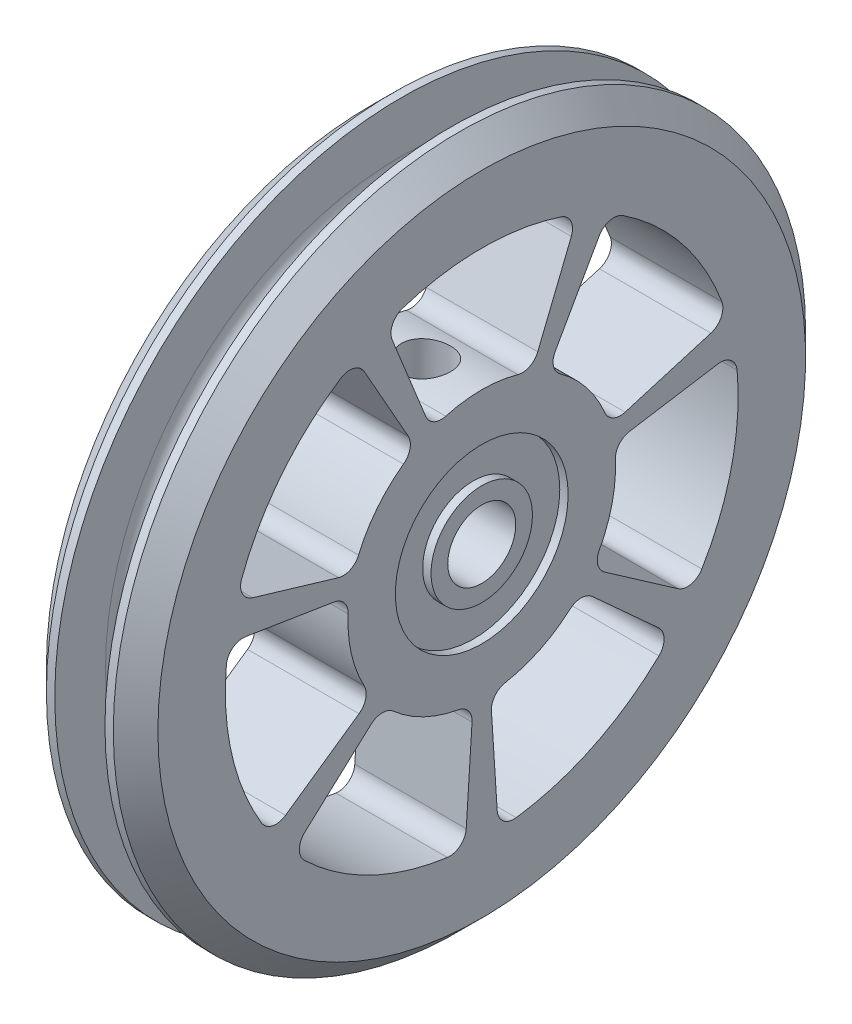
ISO-10303-21;
HEADER;
FILE_DESCRIPTION(('STEP AP214'),'2;1');
FILE_NAME('part.step','',(''),(''),'','','');
FILE_SCHEMA(('AUTOMOTIVE_DESIGN { 1 0 10303 214 1 1 1 1 }'));
ENDSEC;
DATA;
#1=APPLICATION_CONTEXT('core data for automotive mechanical design processes');
#2=APPLICATION_PROTOCOL_DEFINITION('international standard','automotive_design',2000,#1);
#3=PRODUCT_CONTEXT('',#1,'mechanical');
#4=PRODUCT('Part','Part','',(#3));
#5=PRODUCT_RELATED_PRODUCT_CATEGORY('part','',(#4));
#6=PRODUCT_DEFINITION_FORMATION('','',#4);
#7=PRODUCT_DEFINITION_CONTEXT('part definition',#1,'design');
#8=PRODUCT_DEFINITION('design','',#6,#7);
#9=PRODUCT_DEFINITION_SHAPE('','',#8);
#10=(LENGTH_UNIT() NAMED_UNIT(*) SI_UNIT(.MILLI.,.METRE.));
#11=(NAMED_UNIT(*) PLANE_ANGLE_UNIT() SI_UNIT($,.RADIAN.));
#12=(NAMED_UNIT(*) SI_UNIT($,.STERADIAN.) SOLID_ANGLE_UNIT());
#13=UNCERTAINTY_MEASURE_WITH_UNIT(LENGTH_MEASURE(1.E-05),#10,'distance_accuracy_value','');
#14=(GEOMETRIC_REPRESENTATION_CONTEXT(3) GLOBAL_UNCERTAINTY_ASSIGNED_CONTEXT((#13)) GLOBAL_UNIT_ASSIGNED_CONTEXT((#10,
#11,#12)) REPRESENTATION_CONTEXT('',''));
#15=CARTESIAN_POINT('',(0.,0.,0.));
#16=DIRECTION('',(0.,0.,1.));
#17=DIRECTION('',(1.,0.,0.));
#18=AXIS2_PLACEMENT_3D('',#15,#16,#17);
#19=CARTESIAN_POINT('',(-5.,29.05,0.));
#20=DIRECTION('',(1.,0.,0.));
#21=DIRECTION('',(0.,0.,-1.));
#22=AXIS2_PLACEMENT_3D('',#19,#20,#21);
#23=PLANE('',#22);
#24=CARTESIAN_POINT('',(-5.,0.,0.));
#25=DIRECTION('',(-1.,0.,0.));
#26=DIRECTION('',(0.,0.,1.));
#27=AXIS2_PLACEMENT_3D('',#24,#25,#26);
#28=CIRCLE('',#27,3.05);
#29=CARTESIAN_POINT('',(-5.,0.,3.05));
#30=VERTEX_POINT('',#29);
#31=EDGE_CURVE('E435',#30,#30,#28,.T.);
#32=ORIENTED_EDGE('',*,*,#31,.F.);
#33=EDGE_LOOP('',(#32));
#34=FACE_BOUND('',#33,.T.);
#35=CARTESIAN_POINT('',(-5.,0.,0.));
#36=DIRECTION('',(1.,0.,0.));
#37=DIRECTION('',(0.,0.,-1.));
#38=AXIS2_PLACEMENT_3D('',#35,#36,#37);
#39=CIRCLE('',#38,4.55);
#40=CARTESIAN_POINT('',(-5.,0.,-4.55));
#41=VERTEX_POINT('',#40);
#42=EDGE_CURVE('E1181',#41,#41,#39,.T.);
#43=ORIENTED_EDGE('',*,*,#42,.F.);
#44=EDGE_LOOP('',(#43));
#45=FACE_BOUND('',#44,.T.);
#46=ADVANCED_FACE('F35',(#34,#45),#23,.F.);
#47=CARTESIAN_POINT('',(5.,29.05,0.));
#48=DIRECTION('',(-1.,0.,0.));
#49=DIRECTION('',(0.,0.,1.));
#50=AXIS2_PLACEMENT_3D('',#47,#48,#49);
#51=PLANE('',#50);
#52=CARTESIAN_POINT('',(5.,0.,0.));
#53=DIRECTION('',(-1.,0.,0.));
#54=DIRECTION('',(0.,0.,1.));
#55=AXIS2_PLACEMENT_3D('',#52,#53,#54);
#56=CIRCLE('',#55,3.05);
#57=CARTESIAN_POINT('',(5.,0.,3.05));
#58=VERTEX_POINT('',#57);
#59=EDGE_CURVE('E432',#58,#58,#56,.T.);
#60=ORIENTED_EDGE('',*,*,#59,.T.);
#61=EDGE_LOOP('',(#60));
#62=FACE_BOUND('',#61,.T.);
#63=CARTESIAN_POINT('',(5.,0.,0.));
#64=DIRECTION('',(1.,0.,0.));
#65=DIRECTION('',(0.,0.,-1.));
#66=AXIS2_PLACEMENT_3D('',#63,#64,#65);
#67=CIRCLE('',#66,4.55);
#68=CARTESIAN_POINT('',(5.,0.,-4.55));
#69=VERTEX_POINT('',#68);
#70=EDGE_CURVE('E1192',#69,#69,#67,.T.);
#71=ORIENTED_EDGE('',*,*,#70,.T.);
#72=EDGE_LOOP('',(#71));
#73=FACE_BOUND('',#72,.T.);
#74=ADVANCED_FACE('F1168',(#62,#73),#51,.F.);
#75=CARTESIAN_POINT('',(-0.750000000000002,0.,0.));
#76=DIRECTION('',(-1.,0.,0.));
#77=DIRECTION('',(0.,0.,1.));
#78=AXIS2_PLACEMENT_3D('',#75,#76,#77);
#79=TOROIDAL_SURFACE('',#78,26.5,1.5);
#80=CARTESIAN_POINT('',(-2.25,0.,0.));
#81=DIRECTION('',(-1.,0.,0.));
#82=DIRECTION('',(0.,0.,1.));
#83=AXIS2_PLACEMENT_3D('',#80,#81,#82);
#84=CIRCLE('',#83,26.5);
#85=CARTESIAN_POINT('',(-2.25,0.,26.5));
#86=VERTEX_POINT('',#85);
#87=EDGE_CURVE('E447',#86,#86,#84,.T.);
#88=ORIENTED_EDGE('',*,*,#87,.F.);
#89=EDGE_LOOP('',(#88));
#90=FACE_BOUND('',#89,.T.);
#91=CARTESIAN_POINT('',(-0.749799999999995,24.9662211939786,-1.29915355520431));
#92=CARTESIAN_POINT('',(-0.784759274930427,24.9672642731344,-1.27898160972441));
#93=CARTESIAN_POINT('',(-0.81883338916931,24.9695822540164,-1.25742998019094));
#94=CARTESIAN_POINT('',(-0.884954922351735,24.9763475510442,-1.21180176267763));
#95=CARTESIAN_POINT('',(-0.917005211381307,24.9807917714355,-1.18772888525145));
#96=CARTESIAN_POINT('',(-1.00946378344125,24.996623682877,-1.11232875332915));
#97=CARTESIAN_POINT('',(-1.06666070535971,25.0105362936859,-1.05753988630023));
#98=CARTESIAN_POINT('',(-1.17105187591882,25.0417124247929,-0.940619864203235));
#99=CARTESIAN_POINT('',(-1.2182942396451,25.0589590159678,-0.878526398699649));
#100=CARTESIAN_POINT('',(-1.30270681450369,25.0937687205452,-0.747681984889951));
#101=CARTESIAN_POINT('',(-1.33985150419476,25.1113325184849,-0.678914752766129));
#102=CARTESIAN_POINT('',(-1.40652439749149,25.1453308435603,-0.528348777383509));
#103=CARTESIAN_POINT('',(-1.43485284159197,25.1614561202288,-0.445939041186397));
#104=CARTESIAN_POINT('',(-1.47686245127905,25.1862758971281,-0.276497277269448));
#105=CARTESIAN_POINT('',(-1.49058040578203,25.1949890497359,-0.189477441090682));
#106=CARTESIAN_POINT('',(-1.50184838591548,25.2021277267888,-0.0237476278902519));
#107=CARTESIAN_POINT('',(-1.50103042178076,25.2015918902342,0.0548071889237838));
#108=CARTESIAN_POINT('',(-1.48722261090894,25.1928871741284,0.210416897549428));
#109=CARTESIAN_POINT('',(-1.47422711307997,25.1847147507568,0.287471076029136));
#110=CARTESIAN_POINT('',(-1.4381514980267,25.1634086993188,0.432307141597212));
#111=CARTESIAN_POINT('',(-1.41587493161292,25.1506798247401,0.500355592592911));
#112=CARTESIAN_POINT('',(-1.36214704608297,25.1224063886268,0.632161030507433));
#113=CARTESIAN_POINT('',(-1.33068498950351,25.1068585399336,0.695912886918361));
#114=CARTESIAN_POINT('',(-1.25353140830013,25.0727785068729,0.827882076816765));
#115=CARTESIAN_POINT('',(-1.20638082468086,25.0541612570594,0.895227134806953));
#116=CARTESIAN_POINT('',(-1.10133667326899,25.0199421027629,1.02165576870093));
#117=CARTESIAN_POINT('',(-1.04347021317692,25.0043327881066,1.08075954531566));
#118=CARTESIAN_POINT('',(-0.945199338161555,24.9851620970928,1.16567825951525));
#119=CARTESIAN_POINT('',(-0.908089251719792,24.9793108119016,1.19482262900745));
#120=CARTESIAN_POINT('',(-0.831003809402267,24.9704520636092,1.24967227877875));
#121=CARTESIAN_POINT('',(-0.791023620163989,24.9674495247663,1.27537153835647));
#122=CARTESIAN_POINT('',(-0.749799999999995,24.9662211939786,1.29915355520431));
#123=B_SPLINE_CURVE_WITH_KNOTS('',3,(#91,#92,#93,#94,#95,#96,#97,#98,#99,#100,#101,#102,#103,
#104,#105,#106,#107,#108,#109,#110,#111,#112,#113,#114,#115,#116,#117,#118,#119,#120,#121,#122),
.UNSPECIFIED.,.F.,.F.,(4,2,2,2,2,2,2,2,2,2,2,2,2,2,2,4),(0.,0.120999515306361,0.241823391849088,
0.48182529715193,0.720639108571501,0.960051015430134,1.22445355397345,1.48818874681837,
1.72252086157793,1.95696177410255,2.1743252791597,2.3919438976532,2.64375571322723,
2.89493901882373,3.03731327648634,3.17993319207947),.UNSPECIFIED.);
#124=CARTESIAN_POINT('',(-0.750000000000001,24.9662271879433,-1.29903810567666));
#125=VERTEX_POINT('',#124);
#126=CARTESIAN_POINT('',(-0.750000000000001,24.9662271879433,1.29903810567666));
#127=VERTEX_POINT('',#126);
#128=EDGE_CURVE('E415',#125,#127,#123,.T.);
#129=ORIENTED_EDGE('',*,*,#128,.F.);
#130=CARTESIAN_POINT('',(-0.750000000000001,0.,0.));
#131=DIRECTION('',(-1.,0.,0.));
#132=DIRECTION('',(0.,0.,1.));
#133=AXIS2_PLACEMENT_3D('',#130,#131,#132);
#134=CIRCLE('',#133,25.);
#135=EDGE_CURVE('E11',#125,#127,#134,.T.);
#136=ORIENTED_EDGE('',*,*,#135,.T.);
#137=EDGE_LOOP('',(#129,#136));
#138=FACE_BOUND('',#137,.T.);
#139=ADVANCED_FACE('F37',(#90,#138),#79,.F.);
#140=CARTESIAN_POINT('',(-19.0828261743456,0.,0.));
#141=DIRECTION('',(-1.,0.,0.));
#142=DIRECTION('',(0.,0.,1.));
#143=AXIS2_PLACEMENT_3D('',#140,#141,#142);
#144=CYLINDRICAL_SURFACE('',#143,25.);
#145=CARTESIAN_POINT('',(0.749999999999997,24.9662271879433,-1.29903810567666));
#146=CARTESIAN_POINT('',(0.713480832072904,24.9651298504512,-1.32012186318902));
#147=CARTESIAN_POINT('',(0.676088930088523,24.9640870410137,-1.33965602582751));
#148=CARTESIAN_POINT('',(0.599793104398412,24.9621372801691,-1.37550972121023));
#149=CARTESIAN_POINT('',(0.56088924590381,24.9612303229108,-1.39182939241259));
#150=CARTESIAN_POINT('',(0.442469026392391,24.9587577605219,-1.43571674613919));
#151=CARTESIAN_POINT('',(0.36104387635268,24.9574342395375,-1.45832805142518));
#152=CARTESIAN_POINT('',(0.1955284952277,24.9555878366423,-1.48959108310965));
#153=CARTESIAN_POINT('',(0.111436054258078,24.9550656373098,-1.49823090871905));
#154=CARTESIAN_POINT('',(-0.0570787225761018,24.9548828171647,-1.50127659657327));
#155=CARTESIAN_POINT('',(-0.141501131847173,24.9552224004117,-1.49567908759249));
#156=CARTESIAN_POINT('',(-0.27085098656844,24.9563863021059,-1.47608261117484));
#157=CARTESIAN_POINT('',(-0.316574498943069,24.9569263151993,-1.46695373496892));
#158=CARTESIAN_POINT('',(-0.406990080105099,24.9582371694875,-1.44448135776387));
#159=CARTESIAN_POINT('',(-0.451682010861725,24.9590080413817,-1.43113729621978));
#160=CARTESIAN_POINT('',(-0.539742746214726,24.9607568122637,-1.4003070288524));
#161=CARTESIAN_POINT('',(-0.583107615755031,24.9617352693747,-1.38280964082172));
#162=CARTESIAN_POINT('',(-0.668013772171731,24.9638624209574,-1.34385412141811));
#163=CARTESIAN_POINT('',(-0.709555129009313,24.9650111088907,-1.32239614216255));
#164=CARTESIAN_POINT('',(-0.750000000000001,24.9662271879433,-1.29903810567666));
#165=B_SPLINE_CURVE_WITH_KNOTS('',3,(#145,#146,#147,#148,#149,#150,#151,#152,#153,#154,#155,
#156,#157,#158,#159,#160,#161,#162,#163,#164),.UNSPECIFIED.,.F.,.F.,(4,2,2,2,2,2,2,2,2,4),(0.,
0.126469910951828,0.252934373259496,0.505178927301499,0.757638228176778,1.01015731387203,
1.14987183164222,1.28960493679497,1.42971860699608,1.56982689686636),.UNSPECIFIED.);
#166=CARTESIAN_POINT('',(0.749999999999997,24.9662271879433,-1.29903810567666));
#167=VERTEX_POINT('',#166);
#168=EDGE_CURVE('E406',#167,#125,#165,.T.);
#169=ORIENTED_EDGE('',*,*,#168,.F.);
#170=CARTESIAN_POINT('',(0.749999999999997,0.,0.));
#171=DIRECTION('',(-1.,0.,0.));
#172=DIRECTION('',(0.,0.,1.));
#173=AXIS2_PLACEMENT_3D('',#170,#171,#172);
#174=CIRCLE('',#173,25.);
#175=CARTESIAN_POINT('',(0.749999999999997,24.9662271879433,1.29903810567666));
#176=VERTEX_POINT('',#175);
#177=EDGE_CURVE('E49',#167,#176,#174,.T.);
#178=ORIENTED_EDGE('',*,*,#177,.T.);
#179=CARTESIAN_POINT('',(-0.750000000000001,24.9662271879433,1.29903810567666));
#180=CARTESIAN_POINT('',(-0.713480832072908,24.9651298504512,1.32012186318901));
#181=CARTESIAN_POINT('',(-0.676088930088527,24.9640870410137,1.33965602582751));
#182=CARTESIAN_POINT('',(-0.599793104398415,24.9621372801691,1.37550972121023));
#183=CARTESIAN_POINT('',(-0.560889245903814,24.9612303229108,1.39182939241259));
#184=CARTESIAN_POINT('',(-0.442469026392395,24.9587577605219,1.43571674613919));
#185=CARTESIAN_POINT('',(-0.361043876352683,24.9574342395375,1.45832805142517));
#186=CARTESIAN_POINT('',(-0.195528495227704,24.9555878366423,1.48959108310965));
#187=CARTESIAN_POINT('',(-0.111436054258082,24.9550656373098,1.49823090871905));
#188=CARTESIAN_POINT('',(0.0570787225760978,24.9548828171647,1.50127659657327));
#189=CARTESIAN_POINT('',(0.14150113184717,24.9552224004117,1.49567908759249));
#190=CARTESIAN_POINT('',(0.270850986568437,24.9563863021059,1.47608261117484));
#191=CARTESIAN_POINT('',(0.316574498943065,24.9569263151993,1.46695373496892));
#192=CARTESIAN_POINT('',(0.406990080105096,24.9582371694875,1.44448135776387));
#193=CARTESIAN_POINT('',(0.451682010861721,24.9590080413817,1.43113729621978));
#194=CARTESIAN_POINT('',(0.539742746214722,24.9607568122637,1.40030702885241));
#195=CARTESIAN_POINT('',(0.583107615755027,24.9617352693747,1.38280964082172));
#196=CARTESIAN_POINT('',(0.668013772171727,24.9638624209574,1.34385412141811));
#197=CARTESIAN_POINT('',(0.709555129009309,24.9650111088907,1.32239614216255));
#198=CARTESIAN_POINT('',(0.749999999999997,24.9662271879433,1.29903810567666));
#199=B_SPLINE_CURVE_WITH_KNOTS('',3,(#179,#180,#181,#182,#183,#184,#185,#186,#187,#188,#189,
#190,#191,#192,#193,#194,#195,#196,#197,#198),.UNSPECIFIED.,.F.,.F.,(4,2,2,2,2,2,2,2,2,4),(0.,
0.126469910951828,0.252934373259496,0.505178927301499,0.757638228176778,1.01015731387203,
1.14987183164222,1.28960493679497,1.42971860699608,1.56982689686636),.UNSPECIFIED.);
#200=EDGE_CURVE('E56',#127,#176,#199,.T.);
#201=ORIENTED_EDGE('',*,*,#200,.F.);
#202=ORIENTED_EDGE('',*,*,#135,.F.);
#203=EDGE_LOOP('',(#169,#178,#201,#202));
#204=FACE_BOUND('',#203,.T.);
#205=ADVANCED_FACE('F414',(#204),#144,.T.);
#206=CARTESIAN_POINT('',(0.749999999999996,0.,0.));
#207=DIRECTION('',(-1.,0.,0.));
#208=DIRECTION('',(0.,0.,1.));
#209=AXIS2_PLACEMENT_3D('',#206,#207,#208);
#210=TOROIDAL_SURFACE('',#209,26.5,1.5);
#211=CARTESIAN_POINT('',(2.25,0.,0.));
#212=DIRECTION('',(-1.,0.,0.));
#213=DIRECTION('',(0.,0.,1.));
#214=AXIS2_PLACEMENT_3D('',#211,#212,#213);
#215=CIRCLE('',#214,26.5);
#216=CARTESIAN_POINT('',(2.25,0.,26.5));
#217=VERTEX_POINT('',#216);
#218=EDGE_CURVE('E418',#217,#217,#215,.T.);
#219=ORIENTED_EDGE('',*,*,#218,.T.);
#220=EDGE_LOOP('',(#219));
#221=FACE_BOUND('',#220,.T.);
#222=CARTESIAN_POINT('',(0.749799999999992,24.9662211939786,1.29915355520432));
#223=CARTESIAN_POINT('',(0.784759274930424,24.9672642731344,1.27898160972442));
#224=CARTESIAN_POINT('',(0.818833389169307,24.9695822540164,1.25742998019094));
#225=CARTESIAN_POINT('',(0.884954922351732,24.9763475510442,1.21180176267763));
#226=CARTESIAN_POINT('',(0.917005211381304,24.9807917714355,1.18772888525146));
#227=CARTESIAN_POINT('',(1.00946378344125,24.996623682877,1.11232875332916));
#228=CARTESIAN_POINT('',(1.0666607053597,25.0105362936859,1.05753988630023));
#229=CARTESIAN_POINT('',(1.17105187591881,25.0417124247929,0.940619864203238));
#230=CARTESIAN_POINT('',(1.2182942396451,25.0589590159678,0.878526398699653));
#231=CARTESIAN_POINT('',(1.30270681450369,25.0937687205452,0.747681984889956));
#232=CARTESIAN_POINT('',(1.33985150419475,25.1113325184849,0.678914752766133));
#233=CARTESIAN_POINT('',(1.40652439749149,25.1453308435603,0.528348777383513));
#234=CARTESIAN_POINT('',(1.43485284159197,25.1614561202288,0.445939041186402));
#235=CARTESIAN_POINT('',(1.47686245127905,25.1862758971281,0.276497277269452));
#236=CARTESIAN_POINT('',(1.49058040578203,25.1949890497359,0.189477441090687));
#237=CARTESIAN_POINT('',(1.50184838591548,25.2021277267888,0.0237476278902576));
#238=CARTESIAN_POINT('',(1.50103042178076,25.2015918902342,-0.054807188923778));
#239=CARTESIAN_POINT('',(1.48722261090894,25.1928871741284,-0.210416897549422));
#240=CARTESIAN_POINT('',(1.47422711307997,25.1847147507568,-0.28747107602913));
#241=CARTESIAN_POINT('',(1.4381514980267,25.1634086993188,-0.432307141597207));
#242=CARTESIAN_POINT('',(1.41587493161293,25.1506798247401,-0.500355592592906));
#243=CARTESIAN_POINT('',(1.36214704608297,25.1224063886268,-0.632161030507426));
#244=CARTESIAN_POINT('',(1.33068498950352,25.1068585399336,-0.695912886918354));
#245=CARTESIAN_POINT('',(1.25353140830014,25.0727785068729,-0.827882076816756));
#246=CARTESIAN_POINT('',(1.20638082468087,25.0541612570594,-0.895227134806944));
#247=CARTESIAN_POINT('',(1.101336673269,25.0199421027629,-1.02165576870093));
#248=CARTESIAN_POINT('',(1.04347021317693,25.0043327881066,-1.08075954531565));
#249=CARTESIAN_POINT('',(0.945199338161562,24.9851620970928,-1.16567825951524));
#250=CARTESIAN_POINT('',(0.908089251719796,24.9793108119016,-1.19482262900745));
#251=CARTESIAN_POINT('',(0.831003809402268,24.9704520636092,-1.24967227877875));
#252=CARTESIAN_POINT('',(0.791023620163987,24.9674495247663,-1.27537153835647));
#253=CARTESIAN_POINT('',(0.749799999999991,24.9662211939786,-1.29915355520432));
#254=B_SPLINE_CURVE_WITH_KNOTS('',3,(#222,#223,#224,#225,#226,#227,#228,#229,#230,#231,#232,
#233,#234,#235,#236,#237,#238,#239,#240,#241,#242,#243,#244,#245,#246,#247,#248,#249,#250,#251,
#252,#253),.UNSPECIFIED.,.F.,.F.,(4,2,2,2,2,2,2,2,2,2,2,2,2,2,2,4),(0.,0.12099951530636,
0.241823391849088,0.48182529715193,0.720639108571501,0.960051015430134,1.22445355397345,
1.48818874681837,1.72252086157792,1.95696177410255,2.1743252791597,2.3919438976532,
2.64375571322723,2.89493901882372,3.03731327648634,3.17993319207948),.UNSPECIFIED.);
#255=EDGE_CURVE('E403',#176,#167,#254,.T.);
#256=ORIENTED_EDGE('',*,*,#255,.F.);
#257=ORIENTED_EDGE('',*,*,#177,.F.);
#258=EDGE_LOOP('',(#256,#257));
#259=FACE_BOUND('',#258,.T.);
#260=ADVANCED_FACE('F417',(#221,#259),#210,.F.);
#261=CARTESIAN_POINT('',(5.,0.,0.));
#262=DIRECTION('',(-1.,0.,0.));
#263=DIRECTION('',(0.,0.,1.));
#264=AXIS2_PLACEMENT_3D('',#261,#262,#263);
#265=CYLINDRICAL_SURFACE('',#264,23.);
#266=CARTESIAN_POINT('',(-5.,0.,0.));
#267=DIRECTION('',(-1.,0.,0.));
#268=DIRECTION('',(0.,0.,1.));
#269=AXIS2_PLACEMENT_3D('',#266,#267,#268);
#270=CIRCLE('',#269,23.);
#271=CARTESIAN_POINT('',(-5.,21.8743780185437,7.10715036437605));
#272=VERTEX_POINT('',#271);
#273=CARTESIAN_POINT('',(-5.,21.8743780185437,-7.10715036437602));
#274=VERTEX_POINT('',#273);
#275=EDGE_CURVE('E475',#272,#274,#270,.T.);
#276=ORIENTED_EDGE('',*,*,#275,.T.);
#277=DIRECTION('',(-1.,0.,0.));
#278=VECTOR('',#277,1.);
#279=CARTESIAN_POINT('',(5.,21.8743780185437,-7.10715036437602));
#280=LINE('',#279,#278);
#281=CARTESIAN_POINT('',(5.,21.8743780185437,-7.10715036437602));
#282=VERTEX_POINT('',#281);
#283=EDGE_CURVE('E463',#282,#274,#280,.T.);
#284=ORIENTED_EDGE('',*,*,#283,.F.);
#285=CARTESIAN_POINT('',(5.,0.,0.));
#286=DIRECTION('',(-1.,0.,0.));
#287=DIRECTION('',(0.,0.,1.));
#288=AXIS2_PLACEMENT_3D('',#285,#286,#287);
#289=CIRCLE('',#288,23.);
#290=CARTESIAN_POINT('',(5.,21.8743780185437,7.10715036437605));
#291=VERTEX_POINT('',#290);
#292=EDGE_CURVE('E498',#291,#282,#289,.T.);
#293=ORIENTED_EDGE('',*,*,#292,.F.);
#294=DIRECTION('',(-1.,0.,0.));
#295=VECTOR('',#294,1.);
#296=CARTESIAN_POINT('',(5.,21.8743780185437,7.10715036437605));
#297=LINE('',#296,#295);
#298=EDGE_CURVE('E461',#291,#272,#297,.T.);
#299=ORIENTED_EDGE('',*,*,#298,.T.);
#300=EDGE_LOOP('',(#276,#284,#293,#299));
#301=FACE_BOUND('',#300,.T.);
#302=CARTESIAN_POINT('',(0.,22.951034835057,-1.5));
#303=CARTESIAN_POINT('',(0.084159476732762,22.9510354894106,-1.49999629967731));
#304=CARTESIAN_POINT('',(0.168377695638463,22.9515027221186,-1.49289337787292));
#305=CARTESIAN_POINT('',(0.334488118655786,22.9533213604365,-1.46466067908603));
#306=CARTESIAN_POINT('',(0.416377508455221,22.9546737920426,-1.4435146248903));
#307=CARTESIAN_POINT('',(0.57540013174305,22.9581089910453,-1.38780611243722));
#308=CARTESIAN_POINT('',(0.652535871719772,22.9601913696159,-1.35325079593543));
#309=CARTESIAN_POINT('',(0.799892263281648,22.9648513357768,-1.27171634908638));
#310=CARTESIAN_POINT('',(0.870114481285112,22.9674288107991,-1.2247400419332));
#311=CARTESIAN_POINT('',(1.00178452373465,22.9727932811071,-1.11961362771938));
#312=CARTESIAN_POINT('',(1.06321961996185,22.9755805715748,-1.0614475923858));
#313=CARTESIAN_POINT('',(1.17546251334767,22.9810478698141,-0.935625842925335));
#314=CARTESIAN_POINT('',(1.22626986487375,22.9837278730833,-0.86796973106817));
#315=CARTESIAN_POINT('',(1.31585447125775,22.9886812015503,-0.725016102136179));
#316=CARTESIAN_POINT('',(1.3546211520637,22.9909541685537,-0.64971194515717));
#317=CARTESIAN_POINT('',(1.41895627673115,22.9948341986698,-0.493646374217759));
#318=CARTESIAN_POINT('',(1.44452487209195,22.9964412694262,-0.412885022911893));
#319=CARTESIAN_POINT('',(1.48170259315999,22.9988063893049,-0.248320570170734));
#320=CARTESIAN_POINT('',(1.49333171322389,22.9995656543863,-0.164522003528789));
#321=CARTESIAN_POINT('',(1.50236212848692,23.0001537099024,0.00384093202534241));
#322=CARTESIAN_POINT('',(1.49976359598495,22.9999825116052,0.0884052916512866));
#323=CARTESIAN_POINT('',(1.48042894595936,22.9987299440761,0.255763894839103));
#324=CARTESIAN_POINT('',(1.4637143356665,22.9976499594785,0.338560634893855));
#325=CARTESIAN_POINT('',(1.41665537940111,22.9947029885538,0.500170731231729));
#326=CARTESIAN_POINT('',(1.38631094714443,22.9928359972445,0.578984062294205));
#327=CARTESIAN_POINT('',(1.31282940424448,22.9885228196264,0.730459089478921));
#328=CARTESIAN_POINT('',(1.26968256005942,22.9860761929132,0.803116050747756));
#329=CARTESIAN_POINT('',(1.1718280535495,22.980879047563,0.94016416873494));
#330=CARTESIAN_POINT('',(1.1171202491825,22.9781285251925,1.00455522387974));
#331=CARTESIAN_POINT('',(0.997575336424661,22.9726270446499,1.12336925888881));
#332=CARTESIAN_POINT('',(0.932719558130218,22.9698760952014,1.17777345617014));
#333=CARTESIAN_POINT('',(0.794785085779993,22.9646890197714,1.27492458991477));
#334=CARTESIAN_POINT('',(0.721706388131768,22.9622528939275,1.31767152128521));
#335=CARTESIAN_POINT('',(0.569388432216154,22.9579706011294,1.39029342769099));
#336=CARTESIAN_POINT('',(0.490148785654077,22.9561244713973,1.42016759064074));
#337=CARTESIAN_POINT('',(0.327763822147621,22.9532316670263,1.46618286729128));
#338=CARTESIAN_POINT('',(0.244618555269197,22.9521849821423,1.48232415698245));
#339=CARTESIAN_POINT('',(0.0769464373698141,22.9510110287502,1.50039205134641));
#340=CARTESIAN_POINT('',(-0.0075775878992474,22.9508820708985,1.50234477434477));
#341=CARTESIAN_POINT('',(-0.175751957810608,22.9515537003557,1.49204836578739));
#342=CARTESIAN_POINT('',(-0.259402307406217,22.9523542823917,1.47979931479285));
#343=CARTESIAN_POINT('',(-0.423380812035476,22.954793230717,1.44146876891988));
#344=CARTESIAN_POINT('',(-0.503711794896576,22.9564308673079,1.41539932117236));
#345=CARTESIAN_POINT('',(-0.658858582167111,22.9603587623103,1.35018020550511));
#346=CARTESIAN_POINT('',(-0.733674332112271,22.9626490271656,1.31103040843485));
#347=CARTESIAN_POINT('',(-0.875786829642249,22.9676281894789,1.22069524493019));
#348=CARTESIAN_POINT('',(-0.943072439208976,22.9703176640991,1.16949238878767));
#349=CARTESIAN_POINT('',(-1.06810242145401,22.9757901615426,1.05653000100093));
#350=CARTESIAN_POINT('',(-1.12584669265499,22.9785731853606,0.994770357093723));
#351=CARTESIAN_POINT('',(-1.23024317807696,22.983924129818,0.862335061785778));
#352=CARTESIAN_POINT('',(-1.27687848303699,22.9864917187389,0.791646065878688));
#353=CARTESIAN_POINT('',(-1.35761748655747,22.9911177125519,0.643425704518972));
#354=CARTESIAN_POINT('',(-1.39172126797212,22.9931761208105,0.565894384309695));
#355=CARTESIAN_POINT('',(-1.44639977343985,22.996550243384,0.406252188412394));
#356=CARTESIAN_POINT('',(-1.46698517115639,22.9978665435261,0.32414498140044));
#357=CARTESIAN_POINT('',(-1.49407749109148,22.9996104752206,0.157630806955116));
#358=CARTESIAN_POINT('',(-1.50058456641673,23.0000381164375,0.0732238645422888));
#359=CARTESIAN_POINT('',(-1.49933401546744,22.9999565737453,-0.0953264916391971));
#360=CARTESIAN_POINT('',(-1.49160283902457,22.9994491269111,-0.179470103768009));
#361=CARTESIAN_POINT('',(-1.46215012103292,22.9975579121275,-0.345261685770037));
#362=CARTESIAN_POINT('',(-1.44042855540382,22.9961741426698,-0.426909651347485));
#363=CARTESIAN_POINT('',(-1.38361772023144,22.9926857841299,-0.585395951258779));
#364=CARTESIAN_POINT('',(-1.34852860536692,22.9905812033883,-0.662234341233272));
#365=CARTESIAN_POINT('',(-1.26598228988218,22.9858874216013,-0.808932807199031));
#366=CARTESIAN_POINT('',(-1.21852539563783,22.9832982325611,-0.878793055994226));
#367=CARTESIAN_POINT('',(-1.11249259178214,22.9779206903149,-1.00968653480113));
#368=CARTESIAN_POINT('',(-1.05389748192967,22.9751319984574,-1.07070419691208));
#369=CARTESIAN_POINT('',(-0.927278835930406,22.969672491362,-1.18205863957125));
#370=CARTESIAN_POINT('',(-0.859252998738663,22.9670017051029,-1.23239280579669));
#371=CARTESIAN_POINT('',(-0.715620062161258,22.962076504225,-1.32099217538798));
#372=CARTESIAN_POINT('',(-0.640003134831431,22.959822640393,-1.35924146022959));
#373=CARTESIAN_POINT('',(-0.483460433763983,22.9559934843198,-1.42245400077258));
#374=CARTESIAN_POINT('',(-0.402540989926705,22.9544173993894,-1.4474327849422));
#375=CARTESIAN_POINT('',(-0.26760702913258,22.9525344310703,-1.47691786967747));
#376=CARTESIAN_POINT('',(-0.214464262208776,22.9519746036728,-1.48556244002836));
#377=CARTESIAN_POINT('',(-0.10755566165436,22.9512245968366,-1.49710468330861));
#378=CARTESIAN_POINT('',(-0.0537898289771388,22.9510344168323,-1.50000236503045));
#379=CARTESIAN_POINT('',(0.,22.951034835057,-1.5));
#380=B_SPLINE_CURVE_WITH_KNOTS('',3,(#302,#303,#304,#305,#306,#307,#308,#309,#310,#311,#312,
#313,#314,#315,#316,#317,#318,#319,#320,#321,#322,#323,#324,#325,#326,#327,#328,#329,#330,#331,
#332,#333,#334,#335,#336,#337,#338,#339,#340,#341,#342,#343,#344,#345,#346,#347,#348,#349,#350,
#351,#352,#353,#354,#355,#356,#357,#358,#359,#360,#361,#362,#363,#364,#365,#366,#367,#368,#369,
#370,#371,#372,#373,#374,#375,#376,#377,#378,#379),.UNSPECIFIED.,.T.,.F.,(4,2,2,2,2,2,2,2,2,2,2,
2,2,2,2,2,2,2,2,2,2,2,2,2,2,2,2,2,2,2,2,2,2,2,2,2,2,2,4),(0.,0.252282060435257,
0.504857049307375,0.757297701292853,1.00968102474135,1.26242630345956,1.51518217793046,
1.76815939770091,2.02113371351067,2.27374473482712,2.52635269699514,2.77857647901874,
3.03080185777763,3.28321949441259,3.53564023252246,3.78853094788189,4.04142177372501,
4.29432855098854,4.54723208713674,4.79966996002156,5.05210640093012,5.30432315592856,
5.55654240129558,5.80912991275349,6.06172011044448,6.31469236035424,6.56766293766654,
6.82043353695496,7.07320138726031,7.32550015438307,7.57779935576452,7.83009563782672,
8.08238567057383,8.33511461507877,8.58790533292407,8.84102765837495,9.09385313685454,
9.25509736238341,9.41634134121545),.UNSPECIFIED.);
#381=CARTESIAN_POINT('',(0.,22.951034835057,-1.5));
#382=VERTEX_POINT('',#381);
#383=EDGE_CURVE('E40',#382,#382,#380,.T.);
#384=ORIENTED_EDGE('',*,*,#383,.F.);
#385=EDGE_LOOP('',(#384));
#386=FACE_BOUND('',#385,.T.);
#387=ADVANCED_FACE('F1122',(#301,#386),#265,.F.);
#388=CARTESIAN_POINT('',(5.,0.,0.));
#389=DIRECTION('',(1.,0.,0.));
#390=DIRECTION('',(0.,0.,-1.));
#391=AXIS2_PLACEMENT_3D('',#388,#389,#390);
#392=CIRCLE('',#391,7.75);
#393=CARTESIAN_POINT('',(5.,0.,-7.75));
#394=VERTEX_POINT('',#393);
#395=EDGE_CURVE('E1197',#394,#394,#392,.T.);
#396=ORIENTED_EDGE('',*,*,#395,.F.);
#397=EDGE_LOOP('',(#396));
#398=FACE_BOUND('',#397,.T.);
#399=CARTESIAN_POINT('',(5.,0.,0.));
#400=DIRECTION('',(-1.,0.,0.));
#401=DIRECTION('',(0.,0.,1.));
#402=AXIS2_PLACEMENT_3D('',#399,#400,#401);
#403=CIRCLE('',#402,29.05);
#404=CARTESIAN_POINT('',(5.,0.,29.05));
#405=VERTEX_POINT('',#404);
#406=EDGE_CURVE('E429',#405,#405,#403,.T.);
#407=ORIENTED_EDGE('',*,*,#406,.F.);
#408=EDGE_LOOP('',(#407));
#409=FACE_BOUND('',#408,.T.);
#410=DIRECTION('',(0.,-0.927183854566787,0.374606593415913));
#411=VECTOR('',#410,1.);
#412=CARTESIAN_POINT('',(5.,12.4394767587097,-5.02587484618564));
#413=LINE('',#412,#411);
#414=CARTESIAN_POINT('',(5.,19.8858782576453,-8.03441633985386));
#415=VERTEX_POINT('',#414);
#416=CARTESIAN_POINT('',(5.,12.4394767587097,-5.02587484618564));
#417=VERTEX_POINT('',#416);
#418=EDGE_CURVE('E455',#415,#417,#413,.T.);
#419=ORIENTED_EDGE('',*,*,#418,.T.);
#420=CARTESIAN_POINT('',(5.,13.0013866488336,-3.63509906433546));
#421=DIRECTION('',(-1.,0.,0.));
#422=DIRECTION('',(0.,0.,1.));
#423=AXIS2_PLACEMENT_3D('',#420,#421,#422);
#424=CIRCLE('',#423,1.5);
#425=CARTESIAN_POINT('',(5.,11.5567881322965,-3.23119916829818));
#426=VERTEX_POINT('',#425);
#427=EDGE_CURVE('E471',#417,#426,#424,.T.);
#428=ORIENTED_EDGE('',*,*,#427,.T.);
#429=CARTESIAN_POINT('',(5.,0.,0.));
#430=DIRECTION('',(1.,0.,0.));
#431=DIRECTION('',(0.,0.,1.));
#432=AXIS2_PLACEMENT_3D('',#429,#430,#431);
#433=CIRCLE('',#432,12.);
#434=CARTESIAN_POINT('',(5.,11.5567881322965,3.23119916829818));
#435=VERTEX_POINT('',#434);
#436=EDGE_CURVE('E510',#426,#435,#433,.T.);
#437=ORIENTED_EDGE('',*,*,#436,.T.);
#438=CARTESIAN_POINT('',(5.,13.0013866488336,3.63509906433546));
#439=DIRECTION('',(-1.,0.,0.));
#440=DIRECTION('',(0.,0.,-1.));
#441=AXIS2_PLACEMENT_3D('',#438,#439,#440);
#442=CIRCLE('',#441,1.5);
#443=CARTESIAN_POINT('',(5.,12.4394767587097,5.02587484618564));
#444=VERTEX_POINT('',#443);
#445=EDGE_CURVE('E507',#435,#444,#442,.T.);
#446=ORIENTED_EDGE('',*,*,#445,.T.);
#447=DIRECTION('',(0.,0.927183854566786,0.374606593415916));
#448=VECTOR('',#447,1.);
#449=CARTESIAN_POINT('',(5.,12.4394767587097,5.02587484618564));
#450=LINE('',#449,#448);
#451=CARTESIAN_POINT('',(5.,19.8858782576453,8.03441633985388));
#452=VERTEX_POINT('',#451);
#453=EDGE_CURVE('E504',#444,#452,#450,.T.);
#454=ORIENTED_EDGE('',*,*,#453,.T.);
#455=CARTESIAN_POINT('',(5.,20.4477881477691,6.64364055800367));
#456=DIRECTION('',(-1.,0.,0.));
#457=DIRECTION('',(0.,0.,1.));
#458=AXIS2_PLACEMENT_3D('',#455,#456,#457);
#459=CIRCLE('',#458,1.50000000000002);
#460=EDGE_CURVE('E501',#452,#291,#459,.T.);
#461=ORIENTED_EDGE('',*,*,#460,.T.);
#462=ORIENTED_EDGE('',*,*,#292,.T.);
#463=CARTESIAN_POINT('',(5.,20.4477881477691,-6.64364055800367));
#464=DIRECTION('',(-1.,0.,0.));
#465=DIRECTION('',(0.,0.,-1.));
#466=AXIS2_PLACEMENT_3D('',#463,#464,#465);
#467=CIRCLE('',#466,1.5);
#468=EDGE_CURVE('E495',#282,#415,#467,.T.);
#469=ORIENTED_EDGE('',*,*,#468,.T.);
#470=EDGE_LOOP('',(#419,#428,#437,#446,#454,#461,#462,#469));
#471=FACE_BOUND('',#470,.T.);
#472=DIRECTION('',(0.,-0.2852104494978,0.958464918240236));
#473=VECTOR('',#472,1.);
#474=CARTESIAN_POINT('',(5.,3.82649971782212,-12.8591562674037));
#475=LINE('',#474,#473);
#476=CARTESIAN_POINT('',(5.,6.11708265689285,-20.5567823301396));
#477=VERTEX_POINT('',#476);
#478=CARTESIAN_POINT('',(5.,3.82649971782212,-12.8591562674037));
#479=VERTEX_POINT('',#478);
#480=EDGE_CURVE('E773',#477,#479,#475,.T.);
#481=ORIENTED_EDGE('',*,*,#480,.T.);
#482=CARTESIAN_POINT('',(5.,5.26419709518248,-12.431340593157));
#483=DIRECTION('',(-1.,0.,0.));
#484=DIRECTION('',(0.,0.,1.));
#485=AXIS2_PLACEMENT_3D('',#482,#483,#484);
#486=CIRCLE('',#485,1.5);
#487=CARTESIAN_POINT('',(5.,4.67928630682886,-11.0500805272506));
#488=VERTEX_POINT('',#487);
#489=EDGE_CURVE('E791',#479,#488,#486,.T.);
#490=ORIENTED_EDGE('',*,*,#489,.T.);
#491=CARTESIAN_POINT('',(5.,0.,0.));
#492=DIRECTION('',(1.,0.,0.));
#493=DIRECTION('',(0.,0.,1.));
#494=AXIS2_PLACEMENT_3D('',#491,#492,#493);
#495=CIRCLE('',#494,12.);
#496=CARTESIAN_POINT('',(5.,9.73179277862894,-7.02084106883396));
#497=VERTEX_POINT('',#496);
#498=EDGE_CURVE('E830',#488,#497,#495,.T.);
#499=ORIENTED_EDGE('',*,*,#498,.T.);
#500=CARTESIAN_POINT('',(5.,10.9482668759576,-7.89844620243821));
#501=DIRECTION('',(-1.,0.,0.));
#502=DIRECTION('',(0.,0.,-1.));
#503=AXIS2_PLACEMENT_3D('',#500,#501,#502);
#504=CIRCLE('',#503,1.5);
#505=CARTESIAN_POINT('',(5.,11.6852740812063,-6.59199284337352));
#506=VERTEX_POINT('',#505);
#507=EDGE_CURVE('E827',#497,#506,#504,.T.);
#508=ORIENTED_EDGE('',*,*,#507,.T.);
#509=DIRECTION('',(0.,0.870968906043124,-0.491338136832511));
#510=VECTOR('',#509,1.);
#511=CARTESIAN_POINT('',(5.,11.6852740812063,-6.59199284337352));
#512=LINE('',#511,#510);
#513=CARTESIAN_POINT('',(5.,18.6802019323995,-10.5380290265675));
#514=VERTEX_POINT('',#513);
#515=EDGE_CURVE('E824',#506,#514,#512,.T.);
#516=ORIENTED_EDGE('',*,*,#515,.T.);
#517=CARTESIAN_POINT('',(5.,17.9431947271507,-11.8444823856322));
#518=DIRECTION('',(-1.,0.,0.));
#519=DIRECTION('',(0.,0.,1.));
#520=AXIS2_PLACEMENT_3D('',#517,#518,#519);
#521=CIRCLE('',#520,1.5);
#522=CARTESIAN_POINT('',(5.,19.1950455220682,-12.6708416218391));
#523=VERTEX_POINT('',#522);
#524=EDGE_CURVE('E821',#514,#523,#521,.T.);
#525=ORIENTED_EDGE('',*,*,#524,.T.);
#526=CARTESIAN_POINT('',(5.,0.,0.));
#527=DIRECTION('',(-1.,0.,0.));
#528=DIRECTION('',(0.,0.,1.));
#529=AXIS2_PLACEMENT_3D('',#526,#527,#528);
#530=CIRCLE('',#529,23.);
#531=CARTESIAN_POINT('',(5.,8.08185771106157,-21.5333131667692));
#532=VERTEX_POINT('',#531);
#533=EDGE_CURVE('E818',#523,#532,#530,.T.);
#534=ORIENTED_EDGE('',*,*,#533,.T.);
#535=CARTESIAN_POINT('',(5.,7.5547800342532,-20.1289666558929));
#536=DIRECTION('',(-1.,0.,0.));
#537=DIRECTION('',(0.,0.,-1.));
#538=AXIS2_PLACEMENT_3D('',#535,#536,#537);
#539=CIRCLE('',#538,1.5);
#540=EDGE_CURVE('E815',#532,#477,#539,.T.);
#541=ORIENTED_EDGE('',*,*,#540,.T.);
#542=EDGE_LOOP('',(#481,#490,#499,#508,#516,#525,#534,#541));
#543=FACE_BOUND('',#542,.T.);
#544=DIRECTION('',(0.,0.571532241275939,0.820579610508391));
#545=VECTOR('',#544,1.);
#546=CARTESIAN_POINT('',(5.,-7.66790965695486,-11.0092307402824));
#547=LINE('',#546,#545);
#548=CARTESIAN_POINT('',(5.,-12.258000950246,-17.5994719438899));
#549=VERTEX_POINT('',#548);
#550=CARTESIAN_POINT('',(5.,-7.66790965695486,-11.0092307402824));
#551=VERTEX_POINT('',#550);
#552=EDGE_CURVE('E839',#549,#551,#547,.T.);
#553=ORIENTED_EDGE('',*,*,#552,.T.);
#554=CARTESIAN_POINT('',(5.,-6.43704024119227,-11.8665291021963));
#555=DIRECTION('',(-1.,0.,0.));
#556=DIRECTION('',(0.,0.,1.));
#557=AXIS2_PLACEMENT_3D('',#554,#555,#556);
#558=CIRCLE('',#557,1.5);
#559=CARTESIAN_POINT('',(5.,-5.72181354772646,-10.5480258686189));
#560=VERTEX_POINT('',#559);
#561=EDGE_CURVE('E855',#551,#560,#558,.T.);
#562=ORIENTED_EDGE('',*,*,#561,.T.);
#563=CARTESIAN_POINT('',(5.,0.,0.));
#564=DIRECTION('',(1.,0.,0.));
#565=DIRECTION('',(0.,0.,1.));
#566=AXIS2_PLACEMENT_3D('',#563,#564,#565);
#567=CIRCLE('',#566,12.);
#568=CARTESIAN_POINT('',(5.,0.578558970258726,-11.9860447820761));
#569=VERTEX_POINT('',#568);
#570=EDGE_CURVE('E892',#560,#569,#567,.T.);
#571=ORIENTED_EDGE('',*,*,#570,.T.);
#572=CARTESIAN_POINT('',(5.,0.650878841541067,-13.4843003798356));
#573=DIRECTION('',(-1.,0.,0.));
#574=DIRECTION('',(0.,0.,-1.));
#575=AXIS2_PLACEMENT_3D('',#572,#573,#574);
#576=CIRCLE('',#575,1.5);
#577=CARTESIAN_POINT('',(5.,2.13182168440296,-13.2459554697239));
#578=VERTEX_POINT('',#577);
#579=EDGE_CURVE('E889',#569,#578,#576,.T.);
#580=ORIENTED_EDGE('',*,*,#579,.T.);
#581=DIRECTION('',(0.,0.158896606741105,-0.987295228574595));
#582=VECTOR('',#581,1.);
#583=CARTESIAN_POINT('',(5.,2.13182168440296,-13.2459554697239));
#584=LINE('',#583,#582);
#585=CARTESIAN_POINT('',(5.,3.40795254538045,-21.1751235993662));
#586=VERTEX_POINT('',#585);
#587=EDGE_CURVE('E886',#578,#586,#584,.T.);
#588=ORIENTED_EDGE('',*,*,#587,.T.);
#589=CARTESIAN_POINT('',(5.,1.92700970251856,-21.4134685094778));
#590=DIRECTION('',(-1.,0.,0.));
#591=DIRECTION('',(0.,0.,1.));
#592=AXIS2_PLACEMENT_3D('',#589,#590,#591);
#593=CIRCLE('',#592,1.5);
#594=CARTESIAN_POINT('',(5.,2.06145223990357,-22.9074314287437));
#595=VERTEX_POINT('',#594);
#596=EDGE_CURVE('E883',#586,#595,#593,.T.);
#597=ORIENTED_EDGE('',*,*,#596,.T.);
#598=CARTESIAN_POINT('',(5.,0.,0.));
#599=DIRECTION('',(-1.,0.,0.));
#600=DIRECTION('',(0.,0.,1.));
#601=AXIS2_PLACEMENT_3D('',#598,#599,#600);
#602=CIRCLE('',#601,23.);
#603=CARTESIAN_POINT('',(5.,-11.7964662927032,-19.7444519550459));
#604=VERTEX_POINT('',#603);
#605=EDGE_CURVE('E880',#595,#604,#602,.T.);
#606=ORIENTED_EDGE('',*,*,#605,.T.);
#607=CARTESIAN_POINT('',(5.,-11.0271315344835,-18.4567703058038));
#608=DIRECTION('',(-1.,0.,0.));
#609=DIRECTION('',(0.,0.,-1.));
#610=AXIS2_PLACEMENT_3D('',#607,#608,#609);
#611=CIRCLE('',#610,1.5);
#612=EDGE_CURVE('E877',#604,#549,#611,.T.);
#613=ORIENTED_EDGE('',*,*,#612,.T.);
#614=EDGE_LOOP('',(#553,#562,#571,#580,#588,#597,#606,#613));
#615=FACE_BOUND('',#614,.T.);
#616=DIRECTION('',(0.,-0.870968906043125,-0.49133813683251));
#617=VECTOR('',#616,1.);
#618=CARTESIAN_POINT('',(5.,11.6852740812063,6.59199284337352));
#619=LINE('',#618,#617);
#620=CARTESIAN_POINT('',(5.,18.6802019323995,10.5380290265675));
#621=VERTEX_POINT('',#620);
#622=CARTESIAN_POINT('',(5.,11.6852740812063,6.59199284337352));
#623=VERTEX_POINT('',#622);
#624=EDGE_CURVE('E585',#621,#623,#619,.T.);
#625=ORIENTED_EDGE('',*,*,#624,.T.);
#626=CARTESIAN_POINT('',(5.,10.9482668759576,7.89844620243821));
#627=DIRECTION('',(-1.,0.,0.));
#628=DIRECTION('',(0.,0.,1.));
#629=AXIS2_PLACEMENT_3D('',#626,#627,#628);
#630=CIRCLE('',#629,1.5);
#631=CARTESIAN_POINT('',(5.,9.73179277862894,7.02084106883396));
#632=VERTEX_POINT('',#631);
#633=EDGE_CURVE('E601',#623,#632,#630,.T.);
#634=ORIENTED_EDGE('',*,*,#633,.T.);
#635=CARTESIAN_POINT('',(5.,0.,0.));
#636=DIRECTION('',(1.,0.,0.));
#637=DIRECTION('',(0.,0.,1.));
#638=AXIS2_PLACEMENT_3D('',#635,#636,#637);
#639=CIRCLE('',#638,12.);
#640=CARTESIAN_POINT('',(5.,4.67928630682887,11.0500805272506));
#641=VERTEX_POINT('',#640);
#642=EDGE_CURVE('E638',#632,#641,#639,.T.);
#643=ORIENTED_EDGE('',*,*,#642,.T.);
#644=CARTESIAN_POINT('',(5.,5.26419709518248,12.431340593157));
#645=DIRECTION('',(-1.,0.,0.));
#646=DIRECTION('',(0.,0.,-1.));
#647=AXIS2_PLACEMENT_3D('',#644,#645,#646);
#648=CIRCLE('',#647,1.5);
#649=CARTESIAN_POINT('',(5.,3.82649971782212,12.8591562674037));
#650=VERTEX_POINT('',#649);
#651=EDGE_CURVE('E635',#641,#650,#648,.T.);
#652=ORIENTED_EDGE('',*,*,#651,.T.);
#653=DIRECTION('',(0.,0.285210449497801,0.958464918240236));
#654=VECTOR('',#653,1.);
#655=CARTESIAN_POINT('',(5.,3.82649971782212,12.8591562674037));
#656=LINE('',#655,#654);
#657=CARTESIAN_POINT('',(5.,6.11708265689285,20.5567823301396));
#658=VERTEX_POINT('',#657);
#659=EDGE_CURVE('E632',#650,#658,#656,.T.);
#660=ORIENTED_EDGE('',*,*,#659,.T.);
#661=CARTESIAN_POINT('',(5.,7.55478003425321,20.1289666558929));
#662=DIRECTION('',(-1.,0.,0.));
#663=DIRECTION('',(0.,0.,1.));
#664=AXIS2_PLACEMENT_3D('',#661,#662,#663);
#665=CIRCLE('',#664,1.5);
#666=CARTESIAN_POINT('',(5.,8.08185771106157,21.5333131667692));
#667=VERTEX_POINT('',#666);
#668=EDGE_CURVE('E629',#658,#667,#665,.T.);
#669=ORIENTED_EDGE('',*,*,#668,.T.);
#670=CARTESIAN_POINT('',(5.,0.,0.));
#671=DIRECTION('',(-1.,0.,0.));
#672=DIRECTION('',(0.,0.,1.));
#673=AXIS2_PLACEMENT_3D('',#670,#671,#672);
#674=CIRCLE('',#673,23.);
#675=CARTESIAN_POINT('',(5.,19.1950455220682,12.6708416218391));
#676=VERTEX_POINT('',#675);
#677=EDGE_CURVE('E626',#667,#676,#674,.T.);
#678=ORIENTED_EDGE('',*,*,#677,.T.);
#679=CARTESIAN_POINT('',(5.,17.9431947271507,11.8444823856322));
#680=DIRECTION('',(-1.,0.,0.));
#681=DIRECTION('',(0.,0.,-1.));
#682=AXIS2_PLACEMENT_3D('',#679,#680,#681);
#683=CIRCLE('',#682,1.5);
#684=EDGE_CURVE('E623',#676,#621,#683,.T.);
#685=ORIENTED_EDGE('',*,*,#684,.T.);
#686=EDGE_LOOP('',(#625,#634,#643,#652,#660,#669,#678,#685));
#687=FACE_BOUND('',#686,.T.);
#688=DIRECTION('',(0.,-0.158896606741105,-0.987295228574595));
#689=VECTOR('',#688,1.);
#690=CARTESIAN_POINT('',(5.,2.13182168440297,13.2459554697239));
#691=LINE('',#690,#689);
#692=CARTESIAN_POINT('',(5.,3.40795254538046,21.1751235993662));
#693=VERTEX_POINT('',#692);
#694=CARTESIAN_POINT('',(5.,2.13182168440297,13.2459554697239));
#695=VERTEX_POINT('',#694);
#696=EDGE_CURVE('E519',#693,#695,#691,.T.);
#697=ORIENTED_EDGE('',*,*,#696,.T.);
#698=CARTESIAN_POINT('',(5.,0.65087884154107,13.4843003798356));
#699=DIRECTION('',(-1.,0.,0.));
#700=DIRECTION('',(0.,0.,1.));
#701=AXIS2_PLACEMENT_3D('',#698,#699,#700);
#702=CIRCLE('',#701,1.5);
#703=CARTESIAN_POINT('',(5.,0.578558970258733,11.9860447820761));
#704=VERTEX_POINT('',#703);
#705=EDGE_CURVE('E537',#695,#704,#702,.T.);
#706=ORIENTED_EDGE('',*,*,#705,.T.);
#707=CARTESIAN_POINT('',(5.,0.,0.));
#708=DIRECTION('',(1.,0.,0.));
#709=DIRECTION('',(0.,0.,1.));
#710=AXIS2_PLACEMENT_3D('',#707,#708,#709);
#711=CIRCLE('',#710,12.);
#712=CARTESIAN_POINT('',(5.,-5.72181354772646,10.5480258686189));
#713=VERTEX_POINT('',#712);
#714=EDGE_CURVE('E576',#704,#713,#711,.T.);
#715=ORIENTED_EDGE('',*,*,#714,.T.);
#716=CARTESIAN_POINT('',(5.,-6.43704024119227,11.8665291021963));
#717=DIRECTION('',(-1.,0.,0.));
#718=DIRECTION('',(0.,0.,-1.));
#719=AXIS2_PLACEMENT_3D('',#716,#717,#718);
#720=CIRCLE('',#719,1.5);
#721=CARTESIAN_POINT('',(5.,-7.66790965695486,11.0092307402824));
#722=VERTEX_POINT('',#721);
#723=EDGE_CURVE('E573',#713,#722,#720,.T.);
#724=ORIENTED_EDGE('',*,*,#723,.T.);
#725=DIRECTION('',(0.,-0.571532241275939,0.820579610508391));
#726=VECTOR('',#725,1.);
#727=CARTESIAN_POINT('',(5.,-7.66790965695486,11.0092307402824));
#728=LINE('',#727,#726);
#729=CARTESIAN_POINT('',(5.,-12.258000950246,17.5994719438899));
#730=VERTEX_POINT('',#729);
#731=EDGE_CURVE('E570',#722,#730,#728,.T.);
#732=ORIENTED_EDGE('',*,*,#731,.T.);
#733=CARTESIAN_POINT('',(5.,-11.0271315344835,18.4567703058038));
#734=DIRECTION('',(-1.,0.,0.));
#735=DIRECTION('',(0.,0.,1.));
#736=AXIS2_PLACEMENT_3D('',#733,#734,#735);
#737=CIRCLE('',#736,1.5);
#738=CARTESIAN_POINT('',(5.,-11.7964662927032,19.7444519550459));
#739=VERTEX_POINT('',#738);
#740=EDGE_CURVE('E567',#730,#739,#737,.T.);
#741=ORIENTED_EDGE('',*,*,#740,.T.);
#742=CARTESIAN_POINT('',(5.,0.,0.));
#743=DIRECTION('',(-1.,0.,0.));
#744=DIRECTION('',(0.,0.,1.));
#745=AXIS2_PLACEMENT_3D('',#742,#743,#744);
#746=CIRCLE('',#745,23.);
#747=CARTESIAN_POINT('',(5.,2.06145223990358,22.9074314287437));
#748=VERTEX_POINT('',#747);
#749=EDGE_CURVE('E564',#739,#748,#746,.T.);
#750=ORIENTED_EDGE('',*,*,#749,.T.);
#751=CARTESIAN_POINT('',(5.,1.92700970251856,21.4134685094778));
#752=DIRECTION('',(-1.,0.,0.));
#753=DIRECTION('',(0.,0.,-1.));
#754=AXIS2_PLACEMENT_3D('',#751,#752,#753);
#755=CIRCLE('',#754,1.5);
#756=EDGE_CURVE('E561',#748,#693,#755,.T.);
#757=ORIENTED_EDGE('',*,*,#756,.T.);
#758=EDGE_LOOP('',(#697,#706,#715,#724,#732,#741,#750,#757));
#759=FACE_BOUND('',#758,.T.);
#760=DIRECTION('',(0.,0.672828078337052,-0.739798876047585));
#761=VECTOR('',#760,1.);
#762=CARTESIAN_POINT('',(5.,-9.02693592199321,9.92544345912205));
#763=LINE('',#762,#761);
#764=CARTESIAN_POINT('',(5.,-14.430554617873,15.8669182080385));
#765=VERTEX_POINT('',#764);
#766=CARTESIAN_POINT('',(5.,-9.02693592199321,9.92544345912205));
#767=VERTEX_POINT('',#766);
#768=EDGE_CURVE('E711',#765,#767,#763,.T.);
#769=ORIENTED_EDGE('',*,*,#768,.T.);
#770=CARTESIAN_POINT('',(5.,-10.1366342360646,8.91620134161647));
#771=DIRECTION('',(-1.,0.,0.));
#772=DIRECTION('',(0.,0.,1.));
#773=AXIS2_PLACEMENT_3D('',#770,#771,#772);
#774=CIRCLE('',#773,1.5);
#775=CARTESIAN_POINT('',(5.,-9.01034154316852,7.92551230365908));
#776=VERTEX_POINT('',#775);
#777=EDGE_CURVE('E727',#767,#776,#774,.T.);
#778=ORIENTED_EDGE('',*,*,#777,.T.);
#779=CARTESIAN_POINT('',(5.,0.,0.));
#780=DIRECTION('',(1.,0.,0.));
#781=DIRECTION('',(0.,0.,1.));
#782=AXIS2_PLACEMENT_3D('',#779,#780,#781);
#783=CIRCLE('',#782,12.);
#784=CARTESIAN_POINT('',(5.,-11.814271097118,2.10309259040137));
#785=VERTEX_POINT('',#784);
#786=EDGE_CURVE('E764',#776,#785,#783,.T.);
#787=ORIENTED_EDGE('',*,*,#786,.T.);
#788=CARTESIAN_POINT('',(5.,-13.2910549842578,2.36597916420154));
#789=DIRECTION('',(-1.,0.,0.));
#790=DIRECTION('',(0.,0.,-1.));
#791=AXIS2_PLACEMENT_3D('',#788,#789,#790);
#792=CIRCLE('',#791,1.5);
#793=CARTESIAN_POINT('',(5.,-13.388226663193,0.8691299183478));
#794=VERTEX_POINT('',#793);
#795=EDGE_CURVE('E761',#785,#794,#792,.T.);
#796=ORIENTED_EDGE('',*,*,#795,.T.);
#797=DIRECTION('',(0.,-0.997899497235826,0.0647811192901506));
#798=VECTOR('',#797,1.);
#799=CARTESIAN_POINT('',(5.,-13.388226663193,0.8691299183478));
#800=LINE('',#799,#798);
#801=CARTESIAN_POINT('',(5.,-21.402559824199,1.38940022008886));
#802=VERTEX_POINT('',#801);
#803=EDGE_CURVE('E758',#794,#802,#800,.T.);
#804=ORIENTED_EDGE('',*,*,#803,.T.);
#805=CARTESIAN_POINT('',(5.,-21.3053881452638,2.8862494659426));
#806=DIRECTION('',(-1.,0.,0.));
#807=DIRECTION('',(0.,0.,1.));
#808=AXIS2_PLACEMENT_3D('',#805,#806,#807);
#809=CIRCLE('',#808,1.5);
#810=CARTESIAN_POINT('',(5.,-22.7918105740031,3.08761570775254));
#811=VERTEX_POINT('',#810);
#812=EDGE_CURVE('E755',#802,#811,#809,.T.);
#813=ORIENTED_EDGE('',*,*,#812,.T.);
#814=CARTESIAN_POINT('',(5.,0.,0.));
#815=DIRECTION('',(-1.,0.,0.));
#816=DIRECTION('',(0.,0.,1.));
#817=AXIS2_PLACEMENT_3D('',#814,#815,#816);
#818=CIRCLE('',#817,23.);
#819=CARTESIAN_POINT('',(5.,-16.6244566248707,15.8942581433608));
#820=VERTEX_POINT('',#819);
#821=EDGE_CURVE('E752',#811,#820,#818,.T.);
#822=ORIENTED_EDGE('',*,*,#821,.T.);
#823=CARTESIAN_POINT('',(5.,-15.5402529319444,14.8576760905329));
#824=DIRECTION('',(-1.,0.,0.));
#825=DIRECTION('',(0.,0.,-1.));
#826=AXIS2_PLACEMENT_3D('',#823,#824,#825);
#827=CIRCLE('',#826,1.5);
#828=EDGE_CURVE('E749',#820,#765,#827,.T.);
#829=ORIENTED_EDGE('',*,*,#828,.T.);
#830=EDGE_LOOP('',(#769,#778,#787,#796,#804,#813,#822,#829));
#831=FACE_BOUND('',#830,.T.);
#832=DIRECTION('',(0.,0.997899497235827,0.0647811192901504));
#833=VECTOR('',#832,1.);
#834=CARTESIAN_POINT('',(5.,-13.388226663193,-0.869129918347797));
#835=LINE('',#834,#833);
#836=CARTESIAN_POINT('',(5.,-21.402559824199,-1.38940022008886));
#837=VERTEX_POINT('',#836);
#838=CARTESIAN_POINT('',(5.,-13.388226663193,-0.869129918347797));
#839=VERTEX_POINT('',#838);
#840=EDGE_CURVE('E647',#837,#839,#835,.T.);
#841=ORIENTED_EDGE('',*,*,#840,.T.);
#842=CARTESIAN_POINT('',(5.,-13.2910549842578,-2.36597916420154));
#843=DIRECTION('',(-1.,0.,0.));
#844=DIRECTION('',(0.,0.,1.));
#845=AXIS2_PLACEMENT_3D('',#842,#843,#844);
#846=CIRCLE('',#845,1.5);
#847=CARTESIAN_POINT('',(5.,-11.814271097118,-2.10309259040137));
#848=VERTEX_POINT('',#847);
#849=EDGE_CURVE('E665',#839,#848,#846,.T.);
#850=ORIENTED_EDGE('',*,*,#849,.T.);
#851=CARTESIAN_POINT('',(5.,0.,0.));
#852=DIRECTION('',(1.,0.,0.));
#853=DIRECTION('',(0.,0.,1.));
#854=AXIS2_PLACEMENT_3D('',#851,#852,#853);
#855=CIRCLE('',#854,12.);
#856=CARTESIAN_POINT('',(5.,-9.01034154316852,-7.92551230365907));
#857=VERTEX_POINT('',#856);
#858=EDGE_CURVE('E702',#848,#857,#855,.T.);
#859=ORIENTED_EDGE('',*,*,#858,.T.);
#860=CARTESIAN_POINT('',(5.,-10.1366342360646,-8.91620134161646));
#861=DIRECTION('',(-1.,0.,0.));
#862=DIRECTION('',(0.,0.,-1.));
#863=AXIS2_PLACEMENT_3D('',#860,#861,#862);
#864=CIRCLE('',#863,1.5);
#865=CARTESIAN_POINT('',(5.,-9.02693592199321,-9.92544345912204));
#866=VERTEX_POINT('',#865);
#867=EDGE_CURVE('E64',#857,#866,#864,.T.);
#868=ORIENTED_EDGE('',*,*,#867,.T.);
#869=DIRECTION('',(0.,-0.672828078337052,-0.739798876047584));
#870=VECTOR('',#869,1.);
#871=CARTESIAN_POINT('',(5.,-9.02693592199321,-9.92544345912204));
#872=LINE('',#871,#870);
#873=CARTESIAN_POINT('',(5.,-14.430554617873,-15.8669182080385));
#874=VERTEX_POINT('',#873);
#875=EDGE_CURVE('E698',#866,#874,#872,.T.);
#876=ORIENTED_EDGE('',*,*,#875,.T.);
#877=CARTESIAN_POINT('',(5.,-15.5402529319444,-14.8576760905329));
#878=DIRECTION('',(-1.,0.,0.));
#879=DIRECTION('',(0.,0.,1.));
#880=AXIS2_PLACEMENT_3D('',#877,#878,#879);
#881=CIRCLE('',#880,1.5);
#882=CARTESIAN_POINT('',(5.,-16.6244566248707,-15.8942581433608));
#883=VERTEX_POINT('',#882);
#884=EDGE_CURVE('E695',#874,#883,#881,.T.);
#885=ORIENTED_EDGE('',*,*,#884,.T.);
#886=CARTESIAN_POINT('',(5.,0.,0.));
#887=DIRECTION('',(-1.,0.,0.));
#888=DIRECTION('',(0.,0.,1.));
#889=AXIS2_PLACEMENT_3D('',#886,#887,#888);
#890=CIRCLE('',#889,23.);
#891=CARTESIAN_POINT('',(5.,-22.7918105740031,-3.08761570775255));
#892=VERTEX_POINT('',#891);
#893=EDGE_CURVE('E692',#883,#892,#890,.T.);
#894=ORIENTED_EDGE('',*,*,#893,.T.);
#895=CARTESIAN_POINT('',(5.,-21.3053881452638,-2.8862494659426));
#896=DIRECTION('',(-1.,0.,0.));
#897=DIRECTION('',(0.,0.,-1.));
#898=AXIS2_PLACEMENT_3D('',#895,#896,#897);
#899=CIRCLE('',#898,1.5);
#900=EDGE_CURVE('E689',#892,#837,#899,.T.);
#901=ORIENTED_EDGE('',*,*,#900,.T.);
#902=EDGE_LOOP('',(#841,#850,#859,#868,#876,#885,#894,#901));
#903=FACE_BOUND('',#902,.T.);
#904=ADVANCED_FACE('F1126',(#398,#409,#471,#543,#615,#687,#759,#831,#903),#51,.F.);
#905=CARTESIAN_POINT('',(-5.,0.,0.));
#906=DIRECTION('',(1.,0.,0.));
#907=DIRECTION('',(0.,0.,-1.));
#908=AXIS2_PLACEMENT_3D('',#905,#906,#907);
#909=CIRCLE('',#908,7.75);
#910=CARTESIAN_POINT('',(-5.,0.,-7.75));
#911=VERTEX_POINT('',#910);
#912=EDGE_CURVE('E1186',#911,#911,#909,.T.);
#913=ORIENTED_EDGE('',*,*,#912,.T.);
#914=EDGE_LOOP('',(#913));
#915=FACE_BOUND('',#914,.T.);
#916=CARTESIAN_POINT('',(-5.,0.,0.));
#917=DIRECTION('',(-1.,0.,0.));
#918=DIRECTION('',(0.,0.,1.));
#919=AXIS2_PLACEMENT_3D('',#916,#917,#918);
#920=CIRCLE('',#919,29.05);
#921=CARTESIAN_POINT('',(-5.,0.,29.05));
#922=VERTEX_POINT('',#921);
#923=EDGE_CURVE('E438',#922,#922,#920,.T.);
#924=ORIENTED_EDGE('',*,*,#923,.T.);
#925=EDGE_LOOP('',(#924));
#926=FACE_BOUND('',#925,.T.);
#927=CARTESIAN_POINT('',(-5.,0.,0.));
#928=DIRECTION('',(1.,0.,0.));
#929=DIRECTION('',(0.,0.,1.));
#930=AXIS2_PLACEMENT_3D('',#927,#928,#929);
#931=CIRCLE('',#930,12.);
#932=CARTESIAN_POINT('',(-5.,11.5567881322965,-3.23119916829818));
#933=VERTEX_POINT('',#932);
#934=CARTESIAN_POINT('',(-5.,11.5567881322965,3.23119916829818));
#935=VERTEX_POINT('',#934);
#936=EDGE_CURVE('E487',#933,#935,#931,.T.);
#937=ORIENTED_EDGE('',*,*,#936,.F.);
#938=CARTESIAN_POINT('',(-5.,13.0013866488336,-3.63509906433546));
#939=DIRECTION('',(-1.,0.,0.));
#940=DIRECTION('',(0.,0.,1.));
#941=AXIS2_PLACEMENT_3D('',#938,#939,#940);
#942=CIRCLE('',#941,1.5);
#943=CARTESIAN_POINT('',(-5.,12.4394767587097,-5.02587484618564));
#944=VERTEX_POINT('',#943);
#945=EDGE_CURVE('E490',#944,#933,#942,.T.);
#946=ORIENTED_EDGE('',*,*,#945,.F.);
#947=DIRECTION('',(0.,-0.927183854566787,0.374606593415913));
#948=VECTOR('',#947,1.);
#949=CARTESIAN_POINT('',(-5.,12.4394767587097,-5.02587484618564));
#950=LINE('',#949,#948);
#951=CARTESIAN_POINT('',(-5.,19.8858782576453,-8.03441633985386));
#952=VERTEX_POINT('',#951);
#953=EDGE_CURVE('E468',#952,#944,#950,.T.);
#954=ORIENTED_EDGE('',*,*,#953,.F.);
#955=CARTESIAN_POINT('',(-5.,20.4477881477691,-6.64364055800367));
#956=DIRECTION('',(-1.,0.,0.));
#957=DIRECTION('',(0.,0.,-1.));
#958=AXIS2_PLACEMENT_3D('',#955,#956,#957);
#959=CIRCLE('',#958,1.5);
#960=EDGE_CURVE('E472',#274,#952,#959,.T.);
#961=ORIENTED_EDGE('',*,*,#960,.F.);
#962=ORIENTED_EDGE('',*,*,#275,.F.);
#963=CARTESIAN_POINT('',(-5.,20.4477881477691,6.64364055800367));
#964=DIRECTION('',(-1.,0.,0.));
#965=DIRECTION('',(0.,0.,1.));
#966=AXIS2_PLACEMENT_3D('',#963,#964,#965);
#967=CIRCLE('',#966,1.50000000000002);
#968=CARTESIAN_POINT('',(-5.,19.8858782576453,8.03441633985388));
#969=VERTEX_POINT('',#968);
#970=EDGE_CURVE('E478',#969,#272,#967,.T.);
#971=ORIENTED_EDGE('',*,*,#970,.F.);
#972=DIRECTION('',(0.,0.927183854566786,0.374606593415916));
#973=VECTOR('',#972,1.);
#974=CARTESIAN_POINT('',(-5.,12.4394767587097,5.02587484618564));
#975=LINE('',#974,#973);
#976=CARTESIAN_POINT('',(-5.,12.4394767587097,5.02587484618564));
#977=VERTEX_POINT('',#976);
#978=EDGE_CURVE('E481',#977,#969,#975,.T.);
#979=ORIENTED_EDGE('',*,*,#978,.F.);
#980=CARTESIAN_POINT('',(-5.,13.0013866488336,3.63509906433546));
#981=DIRECTION('',(-1.,0.,0.));
#982=DIRECTION('',(0.,0.,-1.));
#983=AXIS2_PLACEMENT_3D('',#980,#981,#982);
#984=CIRCLE('',#983,1.5);
#985=EDGE_CURVE('E484',#935,#977,#984,.T.);
#986=ORIENTED_EDGE('',*,*,#985,.F.);
#987=EDGE_LOOP('',(#937,#946,#954,#961,#962,#971,#979,#986));
#988=FACE_BOUND('',#987,.T.);
#989=CARTESIAN_POINT('',(-5.,0.,0.));
#990=DIRECTION('',(1.,0.,0.));
#991=DIRECTION('',(0.,0.,1.));
#992=AXIS2_PLACEMENT_3D('',#989,#990,#991);
#993=CIRCLE('',#992,12.);
#994=CARTESIAN_POINT('',(-5.,4.67928630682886,-11.0500805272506));
#995=VERTEX_POINT('',#994);
#996=CARTESIAN_POINT('',(-5.,9.73179277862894,-7.02084106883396));
#997=VERTEX_POINT('',#996);
#998=EDGE_CURVE('E807',#995,#997,#993,.T.);
#999=ORIENTED_EDGE('',*,*,#998,.F.);
#1000=CARTESIAN_POINT('',(-5.,5.26419709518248,-12.431340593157));
#1001=DIRECTION('',(-1.,0.,0.));
#1002=DIRECTION('',(0.,0.,1.));
#1003=AXIS2_PLACEMENT_3D('',#1000,#1001,#1002);
#1004=CIRCLE('',#1003,1.5);
#1005=CARTESIAN_POINT('',(-5.,3.82649971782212,-12.8591562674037));
#1006=VERTEX_POINT('',#1005);
#1007=EDGE_CURVE('E810',#1006,#995,#1004,.T.);
#1008=ORIENTED_EDGE('',*,*,#1007,.F.);
#1009=DIRECTION('',(0.,-0.2852104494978,0.958464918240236));
#1010=VECTOR('',#1009,1.);
#1011=CARTESIAN_POINT('',(-5.,3.82649971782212,-12.8591562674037));
#1012=LINE('',#1011,#1010);
#1013=CARTESIAN_POINT('',(-5.,6.11708265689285,-20.5567823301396));
#1014=VERTEX_POINT('',#1013);
#1015=EDGE_CURVE('E788',#1014,#1006,#1012,.T.);
#1016=ORIENTED_EDGE('',*,*,#1015,.F.);
#1017=CARTESIAN_POINT('',(-5.,7.5547800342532,-20.1289666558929));
#1018=DIRECTION('',(-1.,0.,0.));
#1019=DIRECTION('',(0.,0.,-1.));
#1020=AXIS2_PLACEMENT_3D('',#1017,#1018,#1019);
#1021=CIRCLE('',#1020,1.5);
#1022=CARTESIAN_POINT('',(-5.,8.08185771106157,-21.5333131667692));
#1023=VERTEX_POINT('',#1022);
#1024=EDGE_CURVE('E792',#1023,#1014,#1021,.T.);
#1025=ORIENTED_EDGE('',*,*,#1024,.F.);
#1026=CARTESIAN_POINT('',(-5.,0.,0.));
#1027=DIRECTION('',(-1.,0.,0.));
#1028=DIRECTION('',(0.,0.,1.));
#1029=AXIS2_PLACEMENT_3D('',#1026,#1027,#1028);
#1030=CIRCLE('',#1029,23.);
#1031=CARTESIAN_POINT('',(-5.,19.1950455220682,-12.6708416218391));
#1032=VERTEX_POINT('',#1031);
#1033=EDGE_CURVE('E795',#1032,#1023,#1030,.T.);
#1034=ORIENTED_EDGE('',*,*,#1033,.F.);
#1035=CARTESIAN_POINT('',(-5.,17.9431947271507,-11.8444823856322));
#1036=DIRECTION('',(-1.,0.,0.));
#1037=DIRECTION('',(0.,0.,1.));
#1038=AXIS2_PLACEMENT_3D('',#1035,#1036,#1037);
#1039=CIRCLE('',#1038,1.5);
#1040=CARTESIAN_POINT('',(-5.,18.6802019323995,-10.5380290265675));
#1041=VERTEX_POINT('',#1040);
#1042=EDGE_CURVE('E798',#1041,#1032,#1039,.T.);
#1043=ORIENTED_EDGE('',*,*,#1042,.F.);
#1044=DIRECTION('',(0.,0.870968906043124,-0.491338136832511));
#1045=VECTOR('',#1044,1.);
#1046=CARTESIAN_POINT('',(-5.,11.6852740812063,-6.59199284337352));
#1047=LINE('',#1046,#1045);
#1048=CARTESIAN_POINT('',(-5.,11.6852740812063,-6.59199284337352));
#1049=VERTEX_POINT('',#1048);
#1050=EDGE_CURVE('E801',#1049,#1041,#1047,.T.);
#1051=ORIENTED_EDGE('',*,*,#1050,.F.);
#1052=CARTESIAN_POINT('',(-5.,10.9482668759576,-7.89844620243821));
#1053=DIRECTION('',(-1.,0.,0.));
#1054=DIRECTION('',(0.,0.,-1.));
#1055=AXIS2_PLACEMENT_3D('',#1052,#1053,#1054);
#1056=CIRCLE('',#1055,1.5);
#1057=EDGE_CURVE('E804',#997,#1049,#1056,.T.);
#1058=ORIENTED_EDGE('',*,*,#1057,.F.);
#1059=EDGE_LOOP('',(#999,#1008,#1016,#1025,#1034,#1043,#1051,#1058));
#1060=FACE_BOUND('',#1059,.T.);
#1061=CARTESIAN_POINT('',(-5.,0.,0.));
#1062=DIRECTION('',(1.,0.,0.));
#1063=DIRECTION('',(0.,0.,1.));
#1064=AXIS2_PLACEMENT_3D('',#1061,#1062,#1063);
#1065=CIRCLE('',#1064,12.);
#1066=CARTESIAN_POINT('',(-5.,-5.72181354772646,-10.5480258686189));
#1067=VERTEX_POINT('',#1066);
#1068=CARTESIAN_POINT('',(-5.,0.578558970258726,-11.9860447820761));
#1069=VERTEX_POINT('',#1068);
#1070=EDGE_CURVE('E871',#1067,#1069,#1065,.T.);
#1071=ORIENTED_EDGE('',*,*,#1070,.F.);
#1072=CARTESIAN_POINT('',(-5.,-6.43704024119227,-11.8665291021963));
#1073=DIRECTION('',(-1.,0.,0.));
#1074=DIRECTION('',(0.,0.,1.));
#1075=AXIS2_PLACEMENT_3D('',#1072,#1073,#1074);
#1076=CIRCLE('',#1075,1.5);
#1077=CARTESIAN_POINT('',(-5.,-7.66790965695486,-11.0092307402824));
#1078=VERTEX_POINT('',#1077);
#1079=EDGE_CURVE('E787',#1078,#1067,#1076,.T.);
#1080=ORIENTED_EDGE('',*,*,#1079,.F.);
#1081=DIRECTION('',(0.,0.571532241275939,0.820579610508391));
#1082=VECTOR('',#1081,1.);
#1083=CARTESIAN_POINT('',(-5.,-7.66790965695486,-11.0092307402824));
#1084=LINE('',#1083,#1082);
#1085=CARTESIAN_POINT('',(-5.,-12.258000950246,-17.5994719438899));
#1086=VERTEX_POINT('',#1085);
#1087=EDGE_CURVE('E852',#1086,#1078,#1084,.T.);
#1088=ORIENTED_EDGE('',*,*,#1087,.F.);
#1089=CARTESIAN_POINT('',(-5.,-11.0271315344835,-18.4567703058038));
#1090=DIRECTION('',(-1.,0.,0.));
#1091=DIRECTION('',(0.,0.,-1.));
#1092=AXIS2_PLACEMENT_3D('',#1089,#1090,#1091);
#1093=CIRCLE('',#1092,1.5);
#1094=CARTESIAN_POINT('',(-5.,-11.7964662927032,-19.7444519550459));
#1095=VERTEX_POINT('',#1094);
#1096=EDGE_CURVE('E856',#1095,#1086,#1093,.T.);
#1097=ORIENTED_EDGE('',*,*,#1096,.F.);
#1098=CARTESIAN_POINT('',(-5.,0.,0.));
#1099=DIRECTION('',(-1.,0.,0.));
#1100=DIRECTION('',(0.,0.,1.));
#1101=AXIS2_PLACEMENT_3D('',#1098,#1099,#1100);
#1102=CIRCLE('',#1101,23.);
#1103=CARTESIAN_POINT('',(-5.,2.06145223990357,-22.9074314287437));
#1104=VERTEX_POINT('',#1103);
#1105=EDGE_CURVE('E859',#1104,#1095,#1102,.T.);
#1106=ORIENTED_EDGE('',*,*,#1105,.F.);
#1107=CARTESIAN_POINT('',(-5.,1.92700970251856,-21.4134685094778));
#1108=DIRECTION('',(-1.,0.,0.));
#1109=DIRECTION('',(0.,0.,1.));
#1110=AXIS2_PLACEMENT_3D('',#1107,#1108,#1109);
#1111=CIRCLE('',#1110,1.5);
#1112=CARTESIAN_POINT('',(-5.,3.40795254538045,-21.1751235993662));
#1113=VERTEX_POINT('',#1112);
#1114=EDGE_CURVE('E862',#1113,#1104,#1111,.T.);
#1115=ORIENTED_EDGE('',*,*,#1114,.F.);
#1116=DIRECTION('',(0.,0.158896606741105,-0.987295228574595));
#1117=VECTOR('',#1116,1.);
#1118=CARTESIAN_POINT('',(-5.,2.13182168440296,-13.2459554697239));
#1119=LINE('',#1118,#1117);
#1120=CARTESIAN_POINT('',(-5.,2.13182168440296,-13.2459554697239));
#1121=VERTEX_POINT('',#1120);
#1122=EDGE_CURVE('E865',#1121,#1113,#1119,.T.);
#1123=ORIENTED_EDGE('',*,*,#1122,.F.);
#1124=CARTESIAN_POINT('',(-5.,0.650878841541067,-13.4843003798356));
#1125=DIRECTION('',(-1.,0.,0.));
#1126=DIRECTION('',(0.,0.,-1.));
#1127=AXIS2_PLACEMENT_3D('',#1124,#1125,#1126);
#1128=CIRCLE('',#1127,1.5);
#1129=EDGE_CURVE('E868',#1069,#1121,#1128,.T.);
#1130=ORIENTED_EDGE('',*,*,#1129,.F.);
#1131=EDGE_LOOP('',(#1071,#1080,#1088,#1097,#1106,#1115,#1123,#1130));
#1132=FACE_BOUND('',#1131,.T.);
#1133=CARTESIAN_POINT('',(-5.,0.,0.));
#1134=DIRECTION('',(1.,0.,0.));
#1135=DIRECTION('',(0.,0.,1.));
#1136=AXIS2_PLACEMENT_3D('',#1133,#1134,#1135);
#1137=CIRCLE('',#1136,12.);
#1138=CARTESIAN_POINT('',(-5.,9.73179277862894,7.02084106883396));
#1139=VERTEX_POINT('',#1138);
#1140=CARTESIAN_POINT('',(-5.,4.67928630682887,11.0500805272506));
#1141=VERTEX_POINT('',#1140);
#1142=EDGE_CURVE('E617',#1139,#1141,#1137,.T.);
#1143=ORIENTED_EDGE('',*,*,#1142,.F.);
#1144=CARTESIAN_POINT('',(-5.,10.9482668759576,7.89844620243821));
#1145=DIRECTION('',(-1.,0.,0.));
#1146=DIRECTION('',(0.,0.,1.));
#1147=AXIS2_PLACEMENT_3D('',#1144,#1145,#1146);
#1148=CIRCLE('',#1147,1.5);
#1149=CARTESIAN_POINT('',(-5.,11.6852740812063,6.59199284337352));
#1150=VERTEX_POINT('',#1149);
#1151=EDGE_CURVE('E533',#1150,#1139,#1148,.T.);
#1152=ORIENTED_EDGE('',*,*,#1151,.F.);
#1153=DIRECTION('',(0.,-0.870968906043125,-0.49133813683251));
#1154=VECTOR('',#1153,1.);
#1155=CARTESIAN_POINT('',(-5.,11.6852740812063,6.59199284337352));
#1156=LINE('',#1155,#1154);
#1157=CARTESIAN_POINT('',(-5.,18.6802019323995,10.5380290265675));
#1158=VERTEX_POINT('',#1157);
#1159=EDGE_CURVE('E598',#1158,#1150,#1156,.T.);
#1160=ORIENTED_EDGE('',*,*,#1159,.F.);
#1161=CARTESIAN_POINT('',(-5.,17.9431947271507,11.8444823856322));
#1162=DIRECTION('',(-1.,0.,0.));
#1163=DIRECTION('',(0.,0.,-1.));
#1164=AXIS2_PLACEMENT_3D('',#1161,#1162,#1163);
#1165=CIRCLE('',#1164,1.5);
#1166=CARTESIAN_POINT('',(-5.,19.1950455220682,12.6708416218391));
#1167=VERTEX_POINT('',#1166);
#1168=EDGE_CURVE('E602',#1167,#1158,#1165,.T.);
#1169=ORIENTED_EDGE('',*,*,#1168,.F.);
#1170=CARTESIAN_POINT('',(-5.,0.,0.));
#1171=DIRECTION('',(-1.,0.,0.));
#1172=DIRECTION('',(0.,0.,1.));
#1173=AXIS2_PLACEMENT_3D('',#1170,#1171,#1172);
#1174=CIRCLE('',#1173,23.);
#1175=CARTESIAN_POINT('',(-5.,8.08185771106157,21.5333131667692));
#1176=VERTEX_POINT('',#1175);
#1177=EDGE_CURVE('E605',#1176,#1167,#1174,.T.);
#1178=ORIENTED_EDGE('',*,*,#1177,.F.);
#1179=CARTESIAN_POINT('',(-5.,7.55478003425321,20.1289666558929));
#1180=DIRECTION('',(-1.,0.,0.));
#1181=DIRECTION('',(0.,0.,1.));
#1182=AXIS2_PLACEMENT_3D('',#1179,#1180,#1181);
#1183=CIRCLE('',#1182,1.5);
#1184=CARTESIAN_POINT('',(-5.,6.11708265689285,20.5567823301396));
#1185=VERTEX_POINT('',#1184);
#1186=EDGE_CURVE('E608',#1185,#1176,#1183,.T.);
#1187=ORIENTED_EDGE('',*,*,#1186,.F.);
#1188=DIRECTION('',(0.,0.285210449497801,0.958464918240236));
#1189=VECTOR('',#1188,1.);
#1190=CARTESIAN_POINT('',(-5.,3.82649971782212,12.8591562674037));
#1191=LINE('',#1190,#1189);
#1192=CARTESIAN_POINT('',(-5.,3.82649971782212,12.8591562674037));
#1193=VERTEX_POINT('',#1192);
#1194=EDGE_CURVE('E611',#1193,#1185,#1191,.T.);
#1195=ORIENTED_EDGE('',*,*,#1194,.F.);
#1196=CARTESIAN_POINT('',(-5.,5.26419709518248,12.431340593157));
#1197=DIRECTION('',(-1.,0.,0.));
#1198=DIRECTION('',(0.,0.,-1.));
#1199=AXIS2_PLACEMENT_3D('',#1196,#1197,#1198);
#1200=CIRCLE('',#1199,1.5);
#1201=EDGE_CURVE('E614',#1141,#1193,#1200,.T.);
#1202=ORIENTED_EDGE('',*,*,#1201,.F.);
#1203=EDGE_LOOP('',(#1143,#1152,#1160,#1169,#1178,#1187,#1195,#1202));
#1204=FACE_BOUND('',#1203,.T.);
#1205=CARTESIAN_POINT('',(-5.,0.,0.));
#1206=DIRECTION('',(1.,0.,0.));
#1207=DIRECTION('',(0.,0.,1.));
#1208=AXIS2_PLACEMENT_3D('',#1205,#1206,#1207);
#1209=CIRCLE('',#1208,12.);
#1210=CARTESIAN_POINT('',(-5.,0.578558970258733,11.9860447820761));
#1211=VERTEX_POINT('',#1210);
#1212=CARTESIAN_POINT('',(-5.,-5.72181354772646,10.5480258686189));
#1213=VERTEX_POINT('',#1212);
#1214=EDGE_CURVE('E553',#1211,#1213,#1209,.T.);
#1215=ORIENTED_EDGE('',*,*,#1214,.F.);
#1216=CARTESIAN_POINT('',(-5.,0.65087884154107,13.4843003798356));
#1217=DIRECTION('',(-1.,0.,0.));
#1218=DIRECTION('',(0.,0.,1.));
#1219=AXIS2_PLACEMENT_3D('',#1216,#1217,#1218);
#1220=CIRCLE('',#1219,1.5);
#1221=CARTESIAN_POINT('',(-5.,2.13182168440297,13.2459554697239));
#1222=VERTEX_POINT('',#1221);
#1223=EDGE_CURVE('E556',#1222,#1211,#1220,.T.);
#1224=ORIENTED_EDGE('',*,*,#1223,.F.);
#1225=DIRECTION('',(0.,-0.158896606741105,-0.987295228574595));
#1226=VECTOR('',#1225,1.);
#1227=CARTESIAN_POINT('',(-5.,2.13182168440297,13.2459554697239));
#1228=LINE('',#1227,#1226);
#1229=CARTESIAN_POINT('',(-5.,3.40795254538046,21.1751235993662));
#1230=VERTEX_POINT('',#1229);
#1231=EDGE_CURVE('E534',#1230,#1222,#1228,.T.);
#1232=ORIENTED_EDGE('',*,*,#1231,.F.);
#1233=CARTESIAN_POINT('',(-5.,1.92700970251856,21.4134685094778));
#1234=DIRECTION('',(-1.,0.,0.));
#1235=DIRECTION('',(0.,0.,-1.));
#1236=AXIS2_PLACEMENT_3D('',#1233,#1234,#1235);
#1237=CIRCLE('',#1236,1.5);
#1238=CARTESIAN_POINT('',(-5.,2.06145223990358,22.9074314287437));
#1239=VERTEX_POINT('',#1238);
#1240=EDGE_CURVE('E538',#1239,#1230,#1237,.T.);
#1241=ORIENTED_EDGE('',*,*,#1240,.F.);
#1242=CARTESIAN_POINT('',(-5.,0.,0.));
#1243=DIRECTION('',(-1.,0.,0.));
#1244=DIRECTION('',(0.,0.,1.));
#1245=AXIS2_PLACEMENT_3D('',#1242,#1243,#1244);
#1246=CIRCLE('',#1245,23.);
#1247=CARTESIAN_POINT('',(-5.,-11.7964662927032,19.7444519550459));
#1248=VERTEX_POINT('',#1247);
#1249=EDGE_CURVE('E541',#1248,#1239,#1246,.T.);
#1250=ORIENTED_EDGE('',*,*,#1249,.F.);
#1251=CARTESIAN_POINT('',(-5.,-11.0271315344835,18.4567703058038));
#1252=DIRECTION('',(-1.,0.,0.));
#1253=DIRECTION('',(0.,0.,1.));
#1254=AXIS2_PLACEMENT_3D('',#1251,#1252,#1253);
#1255=CIRCLE('',#1254,1.5);
#1256=CARTESIAN_POINT('',(-5.,-12.258000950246,17.5994719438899));
#1257=VERTEX_POINT('',#1256);
#1258=EDGE_CURVE('E544',#1257,#1248,#1255,.T.);
#1259=ORIENTED_EDGE('',*,*,#1258,.F.);
#1260=DIRECTION('',(0.,-0.571532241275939,0.820579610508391));
#1261=VECTOR('',#1260,1.);
#1262=CARTESIAN_POINT('',(-5.,-7.66790965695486,11.0092307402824));
#1263=LINE('',#1262,#1261);
#1264=CARTESIAN_POINT('',(-5.,-7.66790965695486,11.0092307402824));
#1265=VERTEX_POINT('',#1264);
#1266=EDGE_CURVE('E547',#1265,#1257,#1263,.T.);
#1267=ORIENTED_EDGE('',*,*,#1266,.F.);
#1268=CARTESIAN_POINT('',(-5.,-6.43704024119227,11.8665291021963));
#1269=DIRECTION('',(-1.,0.,0.));
#1270=DIRECTION('',(0.,0.,-1.));
#1271=AXIS2_PLACEMENT_3D('',#1268,#1269,#1270);
#1272=CIRCLE('',#1271,1.5);
#1273=EDGE_CURVE('E550',#1213,#1265,#1272,.T.);
#1274=ORIENTED_EDGE('',*,*,#1273,.F.);
#1275=EDGE_LOOP('',(#1215,#1224,#1232,#1241,#1250,#1259,#1267,#1274));
#1276=FACE_BOUND('',#1275,.T.);
#1277=CARTESIAN_POINT('',(-5.,0.,0.));
#1278=DIRECTION('',(1.,0.,0.));
#1279=DIRECTION('',(0.,0.,1.));
#1280=AXIS2_PLACEMENT_3D('',#1277,#1278,#1279);
#1281=CIRCLE('',#1280,12.);
#1282=CARTESIAN_POINT('',(-5.,-9.01034154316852,7.92551230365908));
#1283=VERTEX_POINT('',#1282);
#1284=CARTESIAN_POINT('',(-5.,-11.814271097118,2.10309259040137));
#1285=VERTEX_POINT('',#1284);
#1286=EDGE_CURVE('E743',#1283,#1285,#1281,.T.);
#1287=ORIENTED_EDGE('',*,*,#1286,.F.);
#1288=CARTESIAN_POINT('',(-5.,-10.1366342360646,8.91620134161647));
#1289=DIRECTION('',(-1.,0.,0.));
#1290=DIRECTION('',(0.,0.,1.));
#1291=AXIS2_PLACEMENT_3D('',#1288,#1289,#1290);
#1292=CIRCLE('',#1291,1.5);
#1293=CARTESIAN_POINT('',(-5.,-9.02693592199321,9.92544345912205));
#1294=VERTEX_POINT('',#1293);
#1295=EDGE_CURVE('E661',#1294,#1283,#1292,.T.);
#1296=ORIENTED_EDGE('',*,*,#1295,.F.);
#1297=DIRECTION('',(0.,0.672828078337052,-0.739798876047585));
#1298=VECTOR('',#1297,1.);
#1299=CARTESIAN_POINT('',(-5.,-9.02693592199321,9.92544345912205));
#1300=LINE('',#1299,#1298);
#1301=CARTESIAN_POINT('',(-5.,-14.430554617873,15.8669182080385));
#1302=VERTEX_POINT('',#1301);
#1303=EDGE_CURVE('E724',#1302,#1294,#1300,.T.);
#1304=ORIENTED_EDGE('',*,*,#1303,.F.);
#1305=CARTESIAN_POINT('',(-5.,-15.5402529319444,14.8576760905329));
#1306=DIRECTION('',(-1.,0.,0.));
#1307=DIRECTION('',(0.,0.,-1.));
#1308=AXIS2_PLACEMENT_3D('',#1305,#1306,#1307);
#1309=CIRCLE('',#1308,1.5);
#1310=CARTESIAN_POINT('',(-5.,-16.6244566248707,15.8942581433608));
#1311=VERTEX_POINT('',#1310);
#1312=EDGE_CURVE('E728',#1311,#1302,#1309,.T.);
#1313=ORIENTED_EDGE('',*,*,#1312,.F.);
#1314=CARTESIAN_POINT('',(-5.,0.,0.));
#1315=DIRECTION('',(-1.,0.,0.));
#1316=DIRECTION('',(0.,0.,1.));
#1317=AXIS2_PLACEMENT_3D('',#1314,#1315,#1316);
#1318=CIRCLE('',#1317,23.);
#1319=CARTESIAN_POINT('',(-5.,-22.7918105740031,3.08761570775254));
#1320=VERTEX_POINT('',#1319);
#1321=EDGE_CURVE('E731',#1320,#1311,#1318,.T.);
#1322=ORIENTED_EDGE('',*,*,#1321,.F.);
#1323=CARTESIAN_POINT('',(-5.,-21.3053881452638,2.8862494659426));
#1324=DIRECTION('',(-1.,0.,0.));
#1325=DIRECTION('',(0.,0.,1.));
#1326=AXIS2_PLACEMENT_3D('',#1323,#1324,#1325);
#1327=CIRCLE('',#1326,1.5);
#1328=CARTESIAN_POINT('',(-5.,-21.402559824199,1.38940022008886));
#1329=VERTEX_POINT('',#1328);
#1330=EDGE_CURVE('E734',#1329,#1320,#1327,.T.);
#1331=ORIENTED_EDGE('',*,*,#1330,.F.);
#1332=DIRECTION('',(0.,-0.997899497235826,0.0647811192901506));
#1333=VECTOR('',#1332,1.);
#1334=CARTESIAN_POINT('',(-5.,-13.388226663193,0.8691299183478));
#1335=LINE('',#1334,#1333);
#1336=CARTESIAN_POINT('',(-5.,-13.388226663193,0.8691299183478));
#1337=VERTEX_POINT('',#1336);
#1338=EDGE_CURVE('E737',#1337,#1329,#1335,.T.);
#1339=ORIENTED_EDGE('',*,*,#1338,.F.);
#1340=CARTESIAN_POINT('',(-5.,-13.2910549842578,2.36597916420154));
#1341=DIRECTION('',(-1.,0.,0.));
#1342=DIRECTION('',(0.,0.,-1.));
#1343=AXIS2_PLACEMENT_3D('',#1340,#1341,#1342);
#1344=CIRCLE('',#1343,1.5);
#1345=EDGE_CURVE('E740',#1285,#1337,#1344,.T.);
#1346=ORIENTED_EDGE('',*,*,#1345,.F.);
#1347=EDGE_LOOP('',(#1287,#1296,#1304,#1313,#1322,#1331,#1339,#1346));
#1348=FACE_BOUND('',#1347,.T.);
#1349=CARTESIAN_POINT('',(-5.,0.,0.));
#1350=DIRECTION('',(1.,0.,0.));
#1351=DIRECTION('',(0.,0.,1.));
#1352=AXIS2_PLACEMENT_3D('',#1349,#1350,#1351);
#1353=CIRCLE('',#1352,12.);
#1354=CARTESIAN_POINT('',(-5.,-11.814271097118,-2.10309259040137));
#1355=VERTEX_POINT('',#1354);
#1356=CARTESIAN_POINT('',(-5.,-9.01034154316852,-7.92551230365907));
#1357=VERTEX_POINT('',#1356);
#1358=EDGE_CURVE('E681',#1355,#1357,#1353,.T.);
#1359=ORIENTED_EDGE('',*,*,#1358,.F.);
#1360=CARTESIAN_POINT('',(-5.,-13.2910549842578,-2.36597916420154));
#1361=DIRECTION('',(-1.,0.,0.));
#1362=DIRECTION('',(0.,0.,1.));
#1363=AXIS2_PLACEMENT_3D('',#1360,#1361,#1362);
#1364=CIRCLE('',#1363,1.5);
#1365=CARTESIAN_POINT('',(-5.,-13.388226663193,-0.869129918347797));
#1366=VERTEX_POINT('',#1365);
#1367=EDGE_CURVE('E684',#1366,#1355,#1364,.T.);
#1368=ORIENTED_EDGE('',*,*,#1367,.F.);
#1369=DIRECTION('',(0.,0.997899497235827,0.0647811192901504));
#1370=VECTOR('',#1369,1.);
#1371=CARTESIAN_POINT('',(-5.,-13.388226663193,-0.869129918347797));
#1372=LINE('',#1371,#1370);
#1373=CARTESIAN_POINT('',(-5.,-21.402559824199,-1.38940022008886));
#1374=VERTEX_POINT('',#1373);
#1375=EDGE_CURVE('E662',#1374,#1366,#1372,.T.);
#1376=ORIENTED_EDGE('',*,*,#1375,.F.);
#1377=CARTESIAN_POINT('',(-5.,-21.3053881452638,-2.8862494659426));
#1378=DIRECTION('',(-1.,0.,0.));
#1379=DIRECTION('',(0.,0.,-1.));
#1380=AXIS2_PLACEMENT_3D('',#1377,#1378,#1379);
#1381=CIRCLE('',#1380,1.5);
#1382=CARTESIAN_POINT('',(-5.,-22.7918105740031,-3.08761570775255));
#1383=VERTEX_POINT('',#1382);
#1384=EDGE_CURVE('E666',#1383,#1374,#1381,.T.);
#1385=ORIENTED_EDGE('',*,*,#1384,.F.);
#1386=CARTESIAN_POINT('',(-5.,0.,0.));
#1387=DIRECTION('',(-1.,0.,0.));
#1388=DIRECTION('',(0.,0.,1.));
#1389=AXIS2_PLACEMENT_3D('',#1386,#1387,#1388);
#1390=CIRCLE('',#1389,23.);
#1391=CARTESIAN_POINT('',(-5.,-16.6244566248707,-15.8942581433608));
#1392=VERTEX_POINT('',#1391);
#1393=EDGE_CURVE('E669',#1392,#1383,#1390,.T.);
#1394=ORIENTED_EDGE('',*,*,#1393,.F.);
#1395=CARTESIAN_POINT('',(-5.,-15.5402529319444,-14.8576760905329));
#1396=DIRECTION('',(-1.,0.,0.));
#1397=DIRECTION('',(0.,0.,1.));
#1398=AXIS2_PLACEMENT_3D('',#1395,#1396,#1397);
#1399=CIRCLE('',#1398,1.5);
#1400=CARTESIAN_POINT('',(-5.,-14.430554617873,-15.8669182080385));
#1401=VERTEX_POINT('',#1400);
#1402=EDGE_CURVE('E672',#1401,#1392,#1399,.T.);
#1403=ORIENTED_EDGE('',*,*,#1402,.F.);
#1404=DIRECTION('',(0.,-0.672828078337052,-0.739798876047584));
#1405=VECTOR('',#1404,1.);
#1406=CARTESIAN_POINT('',(-5.,-9.02693592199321,-9.92544345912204));
#1407=LINE('',#1406,#1405);
#1408=CARTESIAN_POINT('',(-5.,-9.02693592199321,-9.92544345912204));
#1409=VERTEX_POINT('',#1408);
#1410=EDGE_CURVE('E675',#1409,#1401,#1407,.T.);
#1411=ORIENTED_EDGE('',*,*,#1410,.F.);
#1412=CARTESIAN_POINT('',(-5.,-10.1366342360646,-8.91620134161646));
#1413=DIRECTION('',(-1.,0.,0.));
#1414=DIRECTION('',(0.,0.,-1.));
#1415=AXIS2_PLACEMENT_3D('',#1412,#1413,#1414);
#1416=CIRCLE('',#1415,1.5);
#1417=EDGE_CURVE('E678',#1357,#1409,#1416,.T.);
#1418=ORIENTED_EDGE('',*,*,#1417,.F.);
#1419=EDGE_LOOP('',(#1359,#1368,#1376,#1385,#1394,#1403,#1411,#1418));
#1420=FACE_BOUND('',#1419,.T.);
#1421=ADVANCED_FACE('F1156',(#915,#926,#988,#1060,#1132,#1204,#1276,#1348,#1420),#23,.F.);
#1422=CARTESIAN_POINT('',(2.25,31.05,0.));
#1423=DIRECTION('',(1.,0.,0.));
#1424=DIRECTION('',(0.,0.,-1.));
#1425=AXIS2_PLACEMENT_3D('',#1422,#1423,#1424);
#1426=PLANE('',#1425);
#1427=ORIENTED_EDGE('',*,*,#218,.F.);
#1428=EDGE_LOOP('',(#1427));
#1429=FACE_BOUND('',#1428,.T.);
#1430=CARTESIAN_POINT('',(2.25,0.,0.));
#1431=DIRECTION('',(-1.,0.,0.));
#1432=DIRECTION('',(0.,0.,1.));
#1433=AXIS2_PLACEMENT_3D('',#1430,#1431,#1432);
#1434=CIRCLE('',#1433,31.05);
#1435=CARTESIAN_POINT('',(2.25,0.,31.05));
#1436=VERTEX_POINT('',#1435);
#1437=EDGE_CURVE('E421',#1436,#1436,#1434,.T.);
#1438=ORIENTED_EDGE('',*,*,#1437,.T.);
#1439=EDGE_LOOP('',(#1438));
#1440=FACE_BOUND('',#1439,.T.);
#1441=ADVANCED_FACE('F1158',(#1429,#1440),#1426,.F.);
#1442=CARTESIAN_POINT('',(-19.0828261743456,0.,0.));
#1443=DIRECTION('',(-1.,0.,0.));
#1444=DIRECTION('',(0.,0.,1.));
#1445=AXIS2_PLACEMENT_3D('',#1442,#1443,#1444);
#1446=CYLINDRICAL_SURFACE('',#1445,31.05);
#1447=ORIENTED_EDGE('',*,*,#1437,.F.);
#1448=EDGE_LOOP('',(#1447));
#1449=FACE_BOUND('',#1448,.T.);
#1450=CARTESIAN_POINT('',(3.,0.,0.));
#1451=DIRECTION('',(-1.,0.,0.));
#1452=DIRECTION('',(0.,0.,1.));
#1453=AXIS2_PLACEMENT_3D('',#1450,#1451,#1452);
#1454=CIRCLE('',#1453,31.05);
#1455=CARTESIAN_POINT('',(3.,0.,31.05));
#1456=VERTEX_POINT('',#1455);
#1457=EDGE_CURVE('E426',#1456,#1456,#1454,.T.);
#1458=ORIENTED_EDGE('',*,*,#1457,.T.);
#1459=EDGE_LOOP('',(#1458));
#1460=FACE_BOUND('',#1459,.T.);
#1461=ADVANCED_FACE('F1164',(#1449,#1460),#1446,.T.);
#1462=CARTESIAN_POINT('',(5.,0.,0.));
#1463=DIRECTION('',(-1.,0.,0.));
#1464=DIRECTION('',(0.,0.,1.));
#1465=AXIS2_PLACEMENT_3D('',#1462,#1463,#1464);
#1466=CONICAL_SURFACE('',#1465,29.05,0.785398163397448);
#1467=ORIENTED_EDGE('',*,*,#1457,.F.);
#1468=EDGE_LOOP('',(#1467));
#1469=FACE_BOUND('',#1468,.T.);
#1470=ORIENTED_EDGE('',*,*,#406,.T.);
#1471=EDGE_LOOP('',(#1470));
#1472=FACE_BOUND('',#1471,.T.);
#1473=ADVANCED_FACE('F1233',(#1469,#1472),#1466,.T.);
#1474=CARTESIAN_POINT('',(-19.0828261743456,0.,0.));
#1475=DIRECTION('',(-1.,0.,0.));
#1476=DIRECTION('',(0.,0.,1.));
#1477=AXIS2_PLACEMENT_3D('',#1474,#1475,#1476);
#1478=CYLINDRICAL_SURFACE('',#1477,3.05);
#1479=CARTESIAN_POINT('',(0.,2.11246301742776,-2.2));
#1480=CARTESIAN_POINT('',(-0.0521725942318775,2.11246387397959,-2.19999955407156));
#1481=CARTESIAN_POINT('',(-0.104351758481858,2.11440781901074,-2.19813820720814));
#1482=CARTESIAN_POINT('',(-0.208182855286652,2.12206215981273,-2.19074799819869));
#1483=CARTESIAN_POINT('',(-0.259834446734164,2.12777485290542,-2.1852168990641));
#1484=CARTESIAN_POINT('',(-0.413490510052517,2.15017325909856,-2.16326449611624));
#1485=CARTESIAN_POINT('',(-0.514021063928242,2.17211774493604,-2.14148471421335));
#1486=CARTESIAN_POINT('',(-0.707156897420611,2.22575407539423,-2.08565670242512));
#1487=CARTESIAN_POINT('',(-0.799844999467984,2.25732166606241,-2.05176396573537));
#1488=CARTESIAN_POINT('',(-0.977979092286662,2.32641681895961,-1.97307659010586));
#1489=CARTESIAN_POINT('',(-1.06342577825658,2.36394380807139,-1.92828299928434));
#1490=CARTESIAN_POINT('',(-1.24229057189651,2.44917756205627,-1.81924981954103));
#1491=CARTESIAN_POINT('',(-1.33416450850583,2.49746804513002,-1.75293516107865));
#1492=CARTESIAN_POINT('',(-1.50687596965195,2.59384917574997,-1.60689950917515));
#1493=CARTESIAN_POINT('',(-1.58769848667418,2.64193946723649,-1.52716060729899));
#1494=CARTESIAN_POINT('',(-1.75066820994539,2.74272181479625,-1.33915013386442));
#1495=CARTESIAN_POINT('',(-1.83038440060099,2.79466077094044,-1.22832680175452));
#1496=CARTESIAN_POINT('',(-1.96925195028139,2.88752510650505,-0.990403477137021));
#1497=CARTESIAN_POINT('',(-2.02844730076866,2.9284740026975,-0.863339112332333));
#1498=CARTESIAN_POINT('',(-2.10900149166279,2.98493299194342,-0.634358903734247));
#1499=CARTESIAN_POINT('',(-2.13632613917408,3.00436217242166,-0.535491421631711));
#1500=CARTESIAN_POINT('',(-2.17700061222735,3.03341785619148,-0.333538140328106));
#1501=CARTESIAN_POINT('',(-2.19036205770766,3.04305251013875,-0.23045592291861));
#1502=CARTESIAN_POINT('',(-2.2023459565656,3.05168978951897,-0.0227561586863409));
#1503=CARTESIAN_POINT('',(-2.20093581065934,3.05066889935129,0.0818642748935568));
#1504=CARTESIAN_POINT('',(-2.18338835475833,3.03803362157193,0.289217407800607));
#1505=CARTESIAN_POINT('',(-2.1672471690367,3.026416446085,0.391949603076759));
#1506=CARTESIAN_POINT('',(-2.12181826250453,2.99405545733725,0.589847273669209));
#1507=CARTESIAN_POINT('',(-2.09290524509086,2.97357208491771,0.685143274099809));
#1508=CARTESIAN_POINT('',(-2.02337738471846,2.92505340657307,0.869275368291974));
#1509=CARTESIAN_POINT('',(-1.98276019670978,2.89701658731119,0.958110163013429));
#1510=CARTESIAN_POINT('',(-1.88614502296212,2.83171909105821,1.13752537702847));
#1511=CARTESIAN_POINT('',(-1.8289400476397,2.79377992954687,1.22720455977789));
#1512=CARTESIAN_POINT('',(-1.70345860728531,2.71329191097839,1.39618252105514));
#1513=CARTESIAN_POINT('',(-1.63517111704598,2.67073847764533,1.47547081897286));
#1514=CARTESIAN_POINT('',(-1.47502643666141,2.57551713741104,1.63693250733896));
#1515=CARTESIAN_POINT('',(-1.38114989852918,2.52244658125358,1.71686951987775));
#1516=CARTESIAN_POINT('',(-1.18055662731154,2.41843798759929,1.86051215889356));
#1517=CARTESIAN_POINT('',(-1.0738391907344,2.36750006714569,1.92421689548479));
#1518=CARTESIAN_POINT('',(-0.873134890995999,2.28440068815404,2.02167533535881));
#1519=CARTESIAN_POINT('',(-0.781549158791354,2.25057775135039,2.05893693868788));
#1520=CARTESIAN_POINT('',(-0.591653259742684,2.19190856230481,2.12129215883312));
#1521=CARTESIAN_POINT('',(-0.493358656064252,2.16704232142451,2.1464129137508));
#1522=CARTESIAN_POINT('',(-0.307485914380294,2.13308677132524,2.18012176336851));
#1523=CARTESIAN_POINT('',(-0.220611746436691,2.12214802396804,2.19067043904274));
#1524=CARTESIAN_POINT('',(-0.0455587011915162,2.11115407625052,2.20127142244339));
#1525=CARTESIAN_POINT('',(0.0426191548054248,2.11109076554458,2.20133155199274));
#1526=CARTESIAN_POINT('',(0.217500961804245,2.12183523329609,2.19097279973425));
#1527=CARTESIAN_POINT('',(0.304207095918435,2.13262515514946,2.18057113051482));
#1528=CARTESIAN_POINT('',(0.474230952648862,2.16341554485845,2.15002170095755));
#1529=CARTESIAN_POINT('',(0.557543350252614,2.18342992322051,2.12985921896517));
#1530=CARTESIAN_POINT('',(0.752675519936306,2.23987746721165,2.07068039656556));
#1531=CARTESIAN_POINT('',(0.862191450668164,2.27967791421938,2.0273240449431));
#1532=CARTESIAN_POINT('',(1.07079039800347,2.36644075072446,1.92534358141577));
#1533=CARTESIAN_POINT('',(1.16985217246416,2.41341726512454,1.86668919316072));
#1534=CARTESIAN_POINT('',(1.35967385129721,2.51085911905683,1.73352021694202));
#1535=CARTESIAN_POINT('',(1.45012057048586,2.56138550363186,1.65860474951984));
#1536=CARTESIAN_POINT('',(1.61848922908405,2.66033510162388,1.49474805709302));
#1537=CARTESIAN_POINT('',(1.69642231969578,2.70876015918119,1.40581946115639));
#1538=CARTESIAN_POINT('',(1.83388754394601,2.79697098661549,1.22038800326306));
#1539=CARTESIAN_POINT('',(1.89424758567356,2.8371021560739,1.12466869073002));
#1540=CARTESIAN_POINT('',(2.00046795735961,2.90909738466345,0.92257112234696));
#1541=CARTESIAN_POINT('',(2.04633313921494,2.94096420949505,0.816196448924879));
#1542=CARTESIAN_POINT('',(2.12153194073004,2.99377245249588,0.594087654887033));
#1543=CARTESIAN_POINT('',(2.15073085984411,3.01462475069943,0.478285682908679));
#1544=CARTESIAN_POINT('',(2.18993075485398,3.04271321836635,0.241892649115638));
#1545=CARTESIAN_POINT('',(2.19995095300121,3.04996302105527,0.121306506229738));
#1546=CARTESIAN_POINT('',(2.20004207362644,3.05003172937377,-0.10324832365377));
#1547=CARTESIAN_POINT('',(2.1926610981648,3.04469385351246,-0.207227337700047));
#1548=CARTESIAN_POINT('',(2.16353638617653,3.02378672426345,-0.412081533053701));
#1549=CARTESIAN_POINT('',(2.14179170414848,3.00821679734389,-0.512956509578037));
#1550=CARTESIAN_POINT('',(2.08552078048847,2.96841860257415,-0.707629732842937));
#1551=CARTESIAN_POINT('',(2.05117661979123,2.94431384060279,-0.801506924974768));
#1552=CARTESIAN_POINT('',(1.97113489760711,2.88912339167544,-0.982031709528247));
#1553=CARTESIAN_POINT('',(1.92543547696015,2.85803656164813,-1.06867811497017));
#1554=CARTESIAN_POINT('',(1.81720632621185,2.78619404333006,-1.24493512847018));
#1555=CARTESIAN_POINT('',(1.75323476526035,2.74469888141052,-1.33335479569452));
#1556=CARTESIAN_POINT('',(1.61403340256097,2.6579388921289,-1.49887138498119));
#1557=CARTESIAN_POINT('',(1.5387874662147,2.61266870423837,-1.57595176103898));
#1558=CARTESIAN_POINT('',(1.36318554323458,2.51288309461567,-1.73145801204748));
#1559=CARTESIAN_POINT('',(1.26076282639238,2.45821562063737,-1.80746246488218));
#1560=CARTESIAN_POINT('',(1.04248033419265,2.3537412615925,-1.94154687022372));
#1561=CARTESIAN_POINT('',(0.926632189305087,2.30393023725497,-1.99964218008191));
#1562=CARTESIAN_POINT('',(0.718766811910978,2.22996055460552,-2.08131234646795));
#1563=CARTESIAN_POINT('',(0.629919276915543,2.2025794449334,-2.11001523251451));
#1564=CARTESIAN_POINT('',(0.447116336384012,2.15746701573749,-2.15612994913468));
#1565=CARTESIAN_POINT('',(0.35317960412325,2.13970274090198,-2.17358037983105));
#1566=CARTESIAN_POINT('',(0.21526819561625,2.12297745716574,-2.18986532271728));
#1567=CARTESIAN_POINT('',(0.17241242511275,2.11905105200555,-2.19365766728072));
#1568=CARTESIAN_POINT('',(0.0863726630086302,2.11379311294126,-2.19872554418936));
#1569=CARTESIAN_POINT('',(0.0431885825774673,2.11246230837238,-2.20000036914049));
#1570=CARTESIAN_POINT('',(0.,2.11246301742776,-2.2));
#1571=B_SPLINE_CURVE_WITH_KNOTS('',3,(#1479,#1480,#1481,#1482,#1483,#1484,#1485,#1486,#1487,
#1488,#1489,#1490,#1491,#1492,#1493,#1494,#1495,#1496,#1497,#1498,#1499,#1500,#1501,#1502,#1503,
#1504,#1505,#1506,#1507,#1508,#1509,#1510,#1511,#1512,#1513,#1514,#1515,#1516,#1517,#1518,#1519,
#1520,#1521,#1522,#1523,#1524,#1525,#1526,#1527,#1528,#1529,#1530,#1531,#1532,#1533,#1534,#1535,
#1536,#1537,#1538,#1539,#1540,#1541,#1542,#1543,#1544,#1545,#1546,#1547,#1548,#1549,#1550,#1551,
#1552,#1553,#1554,#1555,#1556,#1557,#1558,#1559,#1560,#1561,#1562,#1563,#1564,#1565,#1566,#1567,
#1568,#1569,#1570),.UNSPECIFIED.,.T.,.F.,(4,2,2,2,2,2,2,2,2,2,2,2,2,2,2,2,2,2,2,2,2,2,2,2,2,2,2,
2,2,2,2,2,2,2,2,2,2,2,2,2,2,2,2,2,2,4),(0.,0.156456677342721,0.313008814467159,
0.626629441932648,0.936360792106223,1.24606237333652,1.61427881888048,1.98299042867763,
2.41874116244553,2.853551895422,3.16541412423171,3.47701661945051,3.7893069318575,
4.10167943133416,4.40544016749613,4.7092618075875,5.0468155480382,5.38470717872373,
5.78582565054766,6.18696610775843,6.49942655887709,6.81118530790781,7.07456635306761,
7.33775098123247,7.60050330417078,7.86365316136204,8.23460880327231,8.60630424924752,
8.98848938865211,9.37033204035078,9.7290772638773,10.0877022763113,10.4491861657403,
10.8103075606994,11.1218898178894,11.4334925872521,11.7407590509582,12.0480758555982,
12.3970601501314,12.7465487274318,13.1611062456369,13.5753072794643,13.8662274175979,
14.1561442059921,14.2856229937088,14.4151381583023),.UNSPECIFIED.);
#1572=CARTESIAN_POINT('',(0.,2.11246301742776,-2.2));
#1573=VERTEX_POINT('',#1572);
#1574=EDGE_CURVE('E812',#1573,#1573,#1571,.T.);
#1575=ORIENTED_EDGE('',*,*,#1574,.T.);
#1576=EDGE_LOOP('',(#1575));
#1577=FACE_BOUND('',#1576,.T.);
#1578=ORIENTED_EDGE('',*,*,#59,.F.);
#1579=EDGE_LOOP('',(#1578));
#1580=FACE_BOUND('',#1579,.T.);
#1581=ORIENTED_EDGE('',*,*,#31,.T.);
#1582=EDGE_LOOP('',(#1581));
#1583=FACE_BOUND('',#1582,.T.);
#1584=ADVANCED_FACE('F908',(#1577,#1580,#1583),#1478,.F.);
#1585=CARTESIAN_POINT('',(-3.,0.,0.));
#1586=DIRECTION('',(1.,0.,0.));
#1587=DIRECTION('',(0.,0.,-1.));
#1588=AXIS2_PLACEMENT_3D('',#1585,#1586,#1587);
#1589=CONICAL_SURFACE('',#1588,31.05,0.785398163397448);
#1590=ORIENTED_EDGE('',*,*,#923,.F.);
#1591=EDGE_LOOP('',(#1590));
#1592=FACE_BOUND('',#1591,.T.);
#1593=CARTESIAN_POINT('',(-3.,0.,0.));
#1594=DIRECTION('',(-1.,0.,0.));
#1595=DIRECTION('',(0.,0.,1.));
#1596=AXIS2_PLACEMENT_3D('',#1593,#1594,#1595);
#1597=CIRCLE('',#1596,31.05);
#1598=CARTESIAN_POINT('',(-3.,0.,31.05));
#1599=VERTEX_POINT('',#1598);
#1600=EDGE_CURVE('E441',#1599,#1599,#1597,.T.);
#1601=ORIENTED_EDGE('',*,*,#1600,.T.);
#1602=EDGE_LOOP('',(#1601));
#1603=FACE_BOUND('',#1602,.T.);
#1604=ADVANCED_FACE('F1152',(#1592,#1603),#1589,.T.);
#1605=CARTESIAN_POINT('',(-19.0828261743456,0.,0.));
#1606=DIRECTION('',(-1.,0.,0.));
#1607=DIRECTION('',(0.,0.,1.));
#1608=AXIS2_PLACEMENT_3D('',#1605,#1606,#1607);
#1609=CYLINDRICAL_SURFACE('',#1608,31.05);
#1610=ORIENTED_EDGE('',*,*,#1600,.F.);
#1611=EDGE_LOOP('',(#1610));
#1612=FACE_BOUND('',#1611,.T.);
#1613=CARTESIAN_POINT('',(-2.25,0.,0.));
#1614=DIRECTION('',(-1.,0.,0.));
#1615=DIRECTION('',(0.,0.,1.));
#1616=AXIS2_PLACEMENT_3D('',#1613,#1614,#1615);
#1617=CIRCLE('',#1616,31.05);
#1618=CARTESIAN_POINT('',(-2.25,0.,31.05));
#1619=VERTEX_POINT('',#1618);
#1620=EDGE_CURVE('E444',#1619,#1619,#1617,.T.);
#1621=ORIENTED_EDGE('',*,*,#1620,.T.);
#1622=EDGE_LOOP('',(#1621));
#1623=FACE_BOUND('',#1622,.T.);
#1624=ADVANCED_FACE('F1148',(#1612,#1623),#1609,.T.);
#1625=CARTESIAN_POINT('',(-2.25,31.05,0.));
#1626=DIRECTION('',(-1.,0.,0.));
#1627=DIRECTION('',(0.,0.,1.));
#1628=AXIS2_PLACEMENT_3D('',#1625,#1626,#1627);
#1629=PLANE('',#1628);
#1630=ORIENTED_EDGE('',*,*,#1620,.F.);
#1631=EDGE_LOOP('',(#1630));
#1632=FACE_BOUND('',#1631,.T.);
#1633=ORIENTED_EDGE('',*,*,#87,.T.);
#1634=EDGE_LOOP('',(#1633));
#1635=FACE_BOUND('',#1634,.T.);
#1636=ADVANCED_FACE('F1144',(#1632,#1635),#1629,.F.);
#1637=CARTESIAN_POINT('',(5.,13.0013866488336,-3.63509906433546));
#1638=DIRECTION('',(-1.,0.,0.));
#1639=DIRECTION('',(0.,0.,1.));
#1640=AXIS2_PLACEMENT_3D('',#1637,#1638,#1639);
#1641=CYLINDRICAL_SURFACE('',#1640,1.5);
#1642=ORIENTED_EDGE('',*,*,#945,.T.);
#1643=DIRECTION('',(-1.,0.,0.));
#1644=VECTOR('',#1643,1.);
#1645=CARTESIAN_POINT('',(5.,11.5567881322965,-3.23119916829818));
#1646=LINE('',#1645,#1644);
#1647=EDGE_CURVE('E451',#426,#933,#1646,.T.);
#1648=ORIENTED_EDGE('',*,*,#1647,.F.);
#1649=ORIENTED_EDGE('',*,*,#427,.F.);
#1650=DIRECTION('',(-1.,0.,0.));
#1651=VECTOR('',#1650,1.);
#1652=CARTESIAN_POINT('',(5.,12.4394767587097,-5.02587484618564));
#1653=LINE('',#1652,#1651);
#1654=EDGE_CURVE('E450',#417,#944,#1653,.T.);
#1655=ORIENTED_EDGE('',*,*,#1654,.T.);
#1656=EDGE_LOOP('',(#1642,#1648,#1649,#1655));
#1657=FACE_BOUND('',#1656,.T.);
#1658=ADVANCED_FACE('F1117',(#1657),#1641,.F.);
#1659=CARTESIAN_POINT('',(5.,12.4394767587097,-5.02587484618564));
#1660=DIRECTION('',(0.,-0.374606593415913,-0.927183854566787));
#1661=DIRECTION('',(0.,0.927183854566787,-0.374606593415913));
#1662=AXIS2_PLACEMENT_3D('',#1659,#1660,#1661);
#1663=PLANE('',#1662);
#1664=ORIENTED_EDGE('',*,*,#953,.T.);
#1665=ORIENTED_EDGE('',*,*,#1654,.F.);
#1666=ORIENTED_EDGE('',*,*,#418,.F.);
#1667=DIRECTION('',(-1.,0.,0.));
#1668=VECTOR('',#1667,1.);
#1669=CARTESIAN_POINT('',(5.,19.8858782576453,-8.03441633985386));
#1670=LINE('',#1669,#1668);
#1671=EDGE_CURVE('E465',#415,#952,#1670,.T.);
#1672=ORIENTED_EDGE('',*,*,#1671,.T.);
#1673=EDGE_LOOP('',(#1664,#1665,#1666,#1672));
#1674=FACE_BOUND('',#1673,.T.);
#1675=ADVANCED_FACE('F1113',(#1674),#1663,.F.);
#1676=CARTESIAN_POINT('',(5.,20.4477881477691,-6.64364055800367));
#1677=DIRECTION('',(-1.,0.,0.));
#1678=DIRECTION('',(0.,0.,1.));
#1679=AXIS2_PLACEMENT_3D('',#1676,#1677,#1678);
#1680=CYLINDRICAL_SURFACE('',#1679,1.5);
#1681=ORIENTED_EDGE('',*,*,#960,.T.);
#1682=ORIENTED_EDGE('',*,*,#1671,.F.);
#1683=ORIENTED_EDGE('',*,*,#468,.F.);
#1684=ORIENTED_EDGE('',*,*,#283,.T.);
#1685=EDGE_LOOP('',(#1681,#1682,#1683,#1684));
#1686=FACE_BOUND('',#1685,.T.);
#1687=ADVANCED_FACE('F1116',(#1686),#1680,.F.);
#1688=CARTESIAN_POINT('',(5.,20.4477881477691,6.64364055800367));
#1689=DIRECTION('',(-1.,0.,0.));
#1690=DIRECTION('',(0.,0.,1.));
#1691=AXIS2_PLACEMENT_3D('',#1688,#1689,#1690);
#1692=CYLINDRICAL_SURFACE('',#1691,1.50000000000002);
#1693=ORIENTED_EDGE('',*,*,#970,.T.);
#1694=ORIENTED_EDGE('',*,*,#298,.F.);
#1695=ORIENTED_EDGE('',*,*,#460,.F.);
#1696=DIRECTION('',(-1.,0.,0.));
#1697=VECTOR('',#1696,1.);
#1698=CARTESIAN_POINT('',(5.,19.8858782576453,8.03441633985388));
#1699=LINE('',#1698,#1697);
#1700=EDGE_CURVE('E459',#452,#969,#1699,.T.);
#1701=ORIENTED_EDGE('',*,*,#1700,.T.);
#1702=EDGE_LOOP('',(#1693,#1694,#1695,#1701));
#1703=FACE_BOUND('',#1702,.T.);
#1704=ADVANCED_FACE('F1120',(#1703),#1692,.F.);
#1705=CARTESIAN_POINT('',(5.,12.4394767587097,5.02587484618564));
#1706=DIRECTION('',(0.,-0.374606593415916,0.927183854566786));
#1707=DIRECTION('',(0.,-0.927183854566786,-0.374606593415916));
#1708=AXIS2_PLACEMENT_3D('',#1705,#1706,#1707);
#1709=PLANE('',#1708);
#1710=ORIENTED_EDGE('',*,*,#978,.T.);
#1711=ORIENTED_EDGE('',*,*,#1700,.F.);
#1712=ORIENTED_EDGE('',*,*,#453,.F.);
#1713=DIRECTION('',(-1.,0.,0.));
#1714=VECTOR('',#1713,1.);
#1715=CARTESIAN_POINT('',(5.,12.4394767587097,5.02587484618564));
#1716=LINE('',#1715,#1714);
#1717=EDGE_CURVE('E457',#444,#977,#1716,.T.);
#1718=ORIENTED_EDGE('',*,*,#1717,.T.);
#1719=EDGE_LOOP('',(#1710,#1711,#1712,#1718));
#1720=FACE_BOUND('',#1719,.T.);
#1721=ADVANCED_FACE('F1130',(#1720),#1709,.F.);
#1722=CARTESIAN_POINT('',(5.,13.0013866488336,3.63509906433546));
#1723=DIRECTION('',(-1.,0.,0.));
#1724=DIRECTION('',(0.,0.,1.));
#1725=AXIS2_PLACEMENT_3D('',#1722,#1723,#1724);
#1726=CYLINDRICAL_SURFACE('',#1725,1.5);
#1727=ORIENTED_EDGE('',*,*,#985,.T.);
#1728=ORIENTED_EDGE('',*,*,#1717,.F.);
#1729=ORIENTED_EDGE('',*,*,#445,.F.);
#1730=DIRECTION('',(-1.,0.,0.));
#1731=VECTOR('',#1730,1.);
#1732=CARTESIAN_POINT('',(5.,11.5567881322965,3.23119916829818));
#1733=LINE('',#1732,#1731);
#1734=EDGE_CURVE('E454',#435,#935,#1733,.T.);
#1735=ORIENTED_EDGE('',*,*,#1734,.T.);
#1736=EDGE_LOOP('',(#1727,#1728,#1729,#1735));
#1737=FACE_BOUND('',#1736,.T.);
#1738=ADVANCED_FACE('F1134',(#1737),#1726,.F.);
#1739=CARTESIAN_POINT('',(5.,0.,0.));
#1740=DIRECTION('',(-1.,0.,0.));
#1741=DIRECTION('',(0.,0.,1.));
#1742=AXIS2_PLACEMENT_3D('',#1739,#1740,#1741);
#1743=CYLINDRICAL_SURFACE('',#1742,12.);
#1744=CARTESIAN_POINT('',(0.,11.7966096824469,-2.2));
#1745=CARTESIAN_POINT('',(0.122455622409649,11.7966120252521,-2.19999525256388));
#1746=CARTESIAN_POINT('',(0.244973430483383,11.7985371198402,-2.1897412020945));
#1747=CARTESIAN_POINT('',(0.4865579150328,11.8060204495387,-2.14902151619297));
#1748=CARTESIAN_POINT('',(0.605621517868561,11.8115818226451,-2.11853842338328));
#1749=CARTESIAN_POINT('',(0.836766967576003,11.8256871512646,-2.03832523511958));
#1750=CARTESIAN_POINT('',(0.94885507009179,11.8342283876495,-1.9886126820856));
#1751=CARTESIAN_POINT('',(1.16309195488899,11.853327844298,-1.87139764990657));
#1752=CARTESIAN_POINT('',(1.26524158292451,11.8638858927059,-1.80389668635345));
#1753=CARTESIAN_POINT('',(1.45792632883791,11.8859697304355,-1.65216439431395));
#1754=CARTESIAN_POINT('',(1.54832597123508,11.8975046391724,-1.5677623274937));
#1755=CARTESIAN_POINT('',(1.71376502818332,11.920161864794,-1.3849927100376));
#1756=CARTESIAN_POINT('',(1.78880345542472,11.9312841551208,-1.28662426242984));
#1757=CARTESIAN_POINT('',(1.92190698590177,11.9519604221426,-1.07782679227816));
#1758=CARTESIAN_POINT('',(1.97984469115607,11.9615024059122,-0.967315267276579));
#1759=CARTESIAN_POINT('',(2.07628175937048,11.9778409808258,-0.737923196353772));
#1760=CARTESIAN_POINT('',(2.11478265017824,11.9846377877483,-0.619043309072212));
#1761=CARTESIAN_POINT('',(2.17083519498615,11.9946557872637,-0.377692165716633));
#1762=CARTESIAN_POINT('',(2.18861508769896,11.9979159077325,-0.255275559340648));
#1763=CARTESIAN_POINT('',(2.20343178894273,12.0006272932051,-0.00915634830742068));
#1764=CARTESIAN_POINT('',(2.20047028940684,12.0000788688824,0.114546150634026));
#1765=CARTESIAN_POINT('',(2.17406393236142,11.9952654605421,0.358161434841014));
#1766=CARTESIAN_POINT('',(2.15086480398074,11.9910450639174,0.478101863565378));
#1767=CARTESIAN_POINT('',(2.08503001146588,11.9794118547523,0.712358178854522));
#1768=CARTESIAN_POINT('',(2.04239366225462,11.9719989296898,0.826673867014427));
#1769=CARTESIAN_POINT('',(1.93865848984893,11.9547387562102,1.0471522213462));
#1770=CARTESIAN_POINT('',(1.87746080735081,11.9448785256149,1.15326731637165));
#1771=CARTESIAN_POINT('',(1.73841289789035,11.9238152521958,1.35381412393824));
#1772=CARTESIAN_POINT('',(1.66056104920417,11.9126120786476,1.44824469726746));
#1773=CARTESIAN_POINT('',(1.48905876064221,11.8899109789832,1.6241970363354));
#1774=CARTESIAN_POINT('',(1.39519337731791,11.8784111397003,1.70550918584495));
#1775=CARTESIAN_POINT('',(1.19504623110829,11.85657024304,1.85126727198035));
#1776=CARTESIAN_POINT('',(1.08876430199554,11.8462292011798,1.91571298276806));
#1777=CARTESIAN_POINT('',(0.866530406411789,11.8278743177,2.0259646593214));
#1778=CARTESIAN_POINT('',(0.750563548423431,11.8198641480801,2.07174125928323));
#1779=CARTESIAN_POINT('',(0.51240525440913,11.8071350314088,2.14310272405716));
#1780=CARTESIAN_POINT('',(0.39021449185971,11.8024157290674,2.16868976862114));
#1781=CARTESIAN_POINT('',(0.144964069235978,11.7968726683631,2.19864203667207));
#1782=CARTESIAN_POINT('',(0.0219423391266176,11.7959937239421,2.20330792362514));
#1783=CARTESIAN_POINT('',(-0.223122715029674,11.7980833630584,2.19209040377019));
#1784=CARTESIAN_POINT('',(-0.345166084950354,11.8010517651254,2.17620796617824));
#1785=CARTESIAN_POINT('',(-0.583828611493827,11.8104503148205,2.12460239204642));
#1786=CARTESIAN_POINT('',(-0.700482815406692,11.8168531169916,2.08903591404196));
#1787=CARTESIAN_POINT('',(-0.926176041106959,11.832375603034,1.99923767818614));
#1788=CARTESIAN_POINT('',(-1.03521452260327,11.8414954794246,1.9450045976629));
#1789=CARTESIAN_POINT('',(-1.24390850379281,11.861550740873,1.81871696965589));
#1790=CARTESIAN_POINT('',(-1.34344686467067,11.8725050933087,1.74647191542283));
#1791=CARTESIAN_POINT('',(-1.52909646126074,11.8949412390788,1.58646895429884));
#1792=CARTESIAN_POINT('',(-1.61520654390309,11.9064230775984,1.49870971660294));
#1793=CARTESIAN_POINT('',(-1.77267319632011,11.9287972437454,1.30882892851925));
#1794=CARTESIAN_POINT('',(-1.84382790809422,11.9396802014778,1.20653870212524));
#1795=CARTESIAN_POINT('',(-1.96794162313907,11.9594743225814,0.99128136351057));
#1796=CARTESIAN_POINT('',(-2.02090130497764,11.9683855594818,0.878314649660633));
#1797=CARTESIAN_POINT('',(-2.10681693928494,11.9831917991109,0.645477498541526));
#1798=CARTESIAN_POINT('',(-2.13987337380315,11.9891019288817,0.525645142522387));
#1799=CARTESIAN_POINT('',(-2.18536549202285,11.99730445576,0.282011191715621));
#1800=CARTESIAN_POINT('',(-2.19780324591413,11.9995972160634,0.158209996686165));
#1801=CARTESIAN_POINT('',(-2.20163546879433,12.0002998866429,-0.0879089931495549));
#1802=CARTESIAN_POINT('',(-2.19333527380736,11.9987661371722,-0.210221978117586));
#1803=CARTESIAN_POINT('',(-2.1565942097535,11.9921047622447,-0.45167944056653));
#1804=CARTESIAN_POINT('',(-2.12815351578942,11.986977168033,-0.570823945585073));
#1805=CARTESIAN_POINT('',(-2.05206511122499,11.9737037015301,-0.802410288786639));
#1806=CARTESIAN_POINT('',(-2.00444854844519,11.9655627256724,-0.914862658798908));
#1807=CARTESIAN_POINT('',(-1.89139608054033,11.9471453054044,-1.13022771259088));
#1808=CARTESIAN_POINT('',(-1.82595905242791,11.9368687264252,-1.23313979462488));
#1809=CARTESIAN_POINT('',(-1.67806553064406,11.915137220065,-1.42802808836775));
#1810=CARTESIAN_POINT('',(-1.59538778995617,11.9036680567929,-1.51983483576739));
#1811=CARTESIAN_POINT('',(-1.41582013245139,11.8809356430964,-1.68837757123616));
#1812=CARTESIAN_POINT('',(-1.318926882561,11.8696724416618,-1.76511001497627));
#1813=CARTESIAN_POINT('',(-1.11266183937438,11.8485193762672,-1.90195659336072));
#1814=CARTESIAN_POINT('',(-1.00318792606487,11.8386424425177,-1.96191885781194));
#1815=CARTESIAN_POINT('',(-0.775576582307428,11.8215351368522,-2.06250617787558));
#1816=CARTESIAN_POINT('',(-0.657447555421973,11.8143022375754,-2.10314971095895));
#1817=CARTESIAN_POINT('',(-0.449121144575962,11.8048303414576,-2.15556614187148));
#1818=CARTESIAN_POINT('',(-0.360152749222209,11.8017656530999,-2.17220067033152));
#1819=CARTESIAN_POINT('',(-0.18080084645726,11.7976544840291,-2.19441921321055));
#1820=CARTESIAN_POINT('',(-0.0904173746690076,11.7966079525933,-2.2000035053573));
#1821=CARTESIAN_POINT('',(0.,11.7966096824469,-2.2));
#1822=B_SPLINE_CURVE_WITH_KNOTS('',3,(#1744,#1745,#1746,#1747,#1748,#1749,#1750,#1751,#1752,
#1753,#1754,#1755,#1756,#1757,#1758,#1759,#1760,#1761,#1762,#1763,#1764,#1765,#1766,#1767,#1768,
#1769,#1770,#1771,#1772,#1773,#1774,#1775,#1776,#1777,#1778,#1779,#1780,#1781,#1782,#1783,#1784,
#1785,#1786,#1787,#1788,#1789,#1790,#1791,#1792,#1793,#1794,#1795,#1796,#1797,#1798,#1799,#1800,
#1801,#1802,#1803,#1804,#1805,#1806,#1807,#1808,#1809,#1810,#1811,#1812,#1813,#1814,#1815,#1816,
#1817,#1818,#1819,#1820,#1821),.UNSPECIFIED.,.T.,.F.,(4,2,2,2,2,2,2,2,2,2,2,2,2,2,2,2,2,2,2,2,2,
2,2,2,2,2,2,2,2,2,2,2,2,2,2,2,2,2,4),(0.,0.367036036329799,0.73438923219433,1.10140809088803,
1.46839568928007,1.83929689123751,2.21022192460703,2.58384432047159,2.95743734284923,
3.32687519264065,3.69628290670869,4.06126667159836,4.42626330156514,4.79323912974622,
5.16025070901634,5.53264451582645,5.90504330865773,6.27802563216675,6.65096768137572,
7.01853253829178,7.38608005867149,7.75074360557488,8.11543299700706,8.48415662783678,
8.8529119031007,9.22636342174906,9.59980101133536,9.97133712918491,10.3428359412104,
10.7088973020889,11.0749554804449,11.4404214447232,11.8059104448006,12.1764153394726,
12.5470072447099,12.9208539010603,13.2943422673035,13.5653569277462,13.8363647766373),.UNSPECIFIED.);
#1823=CARTESIAN_POINT('',(0.,11.7966096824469,-2.2));
#1824=VERTEX_POINT('',#1823);
#1825=EDGE_CURVE('E903',#1824,#1824,#1822,.T.);
#1826=ORIENTED_EDGE('',*,*,#1825,.T.);
#1827=EDGE_LOOP('',(#1826));
#1828=FACE_BOUND('',#1827,.T.);
#1829=ORIENTED_EDGE('',*,*,#936,.T.);
#1830=ORIENTED_EDGE('',*,*,#1734,.F.);
#1831=ORIENTED_EDGE('',*,*,#436,.F.);
#1832=ORIENTED_EDGE('',*,*,#1647,.T.);
#1833=EDGE_LOOP('',(#1829,#1830,#1831,#1832));
#1834=FACE_BOUND('',#1833,.T.);
#1835=ADVANCED_FACE('F986',(#1828,#1834),#1743,.T.);
#1836=CARTESIAN_POINT('',(5.,5.26419709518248,-12.431340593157));
#1837=DIRECTION('',(-1.,0.,0.));
#1838=DIRECTION('',(0.,0.,1.));
#1839=AXIS2_PLACEMENT_3D('',#1836,#1837,#1838);
#1840=CYLINDRICAL_SURFACE('',#1839,1.5);
#1841=ORIENTED_EDGE('',*,*,#1007,.T.);
#1842=DIRECTION('',(-1.,0.,0.));
#1843=VECTOR('',#1842,1.);
#1844=CARTESIAN_POINT('',(5.,4.67928630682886,-11.0500805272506));
#1845=LINE('',#1844,#1843);
#1846=EDGE_CURVE('E769',#488,#995,#1845,.T.);
#1847=ORIENTED_EDGE('',*,*,#1846,.F.);
#1848=ORIENTED_EDGE('',*,*,#489,.F.);
#1849=DIRECTION('',(-1.,0.,0.));
#1850=VECTOR('',#1849,1.);
#1851=CARTESIAN_POINT('',(5.,3.82649971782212,-12.8591562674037));
#1852=LINE('',#1851,#1850);
#1853=EDGE_CURVE('E785',#479,#1006,#1852,.T.);
#1854=ORIENTED_EDGE('',*,*,#1853,.T.);
#1855=EDGE_LOOP('',(#1841,#1847,#1848,#1854));
#1856=FACE_BOUND('',#1855,.T.);
#1857=ADVANCED_FACE('F960',(#1856),#1840,.F.);
#1858=CARTESIAN_POINT('',(5.,3.82649971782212,-12.8591562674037));
#1859=DIRECTION('',(0.,-0.958464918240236,-0.2852104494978));
#1860=DIRECTION('',(0.,0.2852104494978,-0.958464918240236));
#1861=AXIS2_PLACEMENT_3D('',#1858,#1859,#1860);
#1862=PLANE('',#1861);
#1863=ORIENTED_EDGE('',*,*,#1015,.T.);
#1864=ORIENTED_EDGE('',*,*,#1853,.F.);
#1865=ORIENTED_EDGE('',*,*,#480,.F.);
#1866=DIRECTION('',(-1.,0.,0.));
#1867=VECTOR('',#1866,1.);
#1868=CARTESIAN_POINT('',(5.,6.11708265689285,-20.5567823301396));
#1869=LINE('',#1868,#1867);
#1870=EDGE_CURVE('E783',#477,#1014,#1869,.T.);
#1871=ORIENTED_EDGE('',*,*,#1870,.T.);
#1872=EDGE_LOOP('',(#1863,#1864,#1865,#1871));
#1873=FACE_BOUND('',#1872,.T.);
#1874=ADVANCED_FACE('F956',(#1873),#1862,.F.);
#1875=CARTESIAN_POINT('',(5.,7.5547800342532,-20.1289666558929));
#1876=DIRECTION('',(-1.,0.,0.));
#1877=DIRECTION('',(0.,0.,1.));
#1878=AXIS2_PLACEMENT_3D('',#1875,#1876,#1877);
#1879=CYLINDRICAL_SURFACE('',#1878,1.5);
#1880=ORIENTED_EDGE('',*,*,#1024,.T.);
#1881=ORIENTED_EDGE('',*,*,#1870,.F.);
#1882=ORIENTED_EDGE('',*,*,#540,.F.);
#1883=DIRECTION('',(-1.,0.,0.));
#1884=VECTOR('',#1883,1.);
#1885=CARTESIAN_POINT('',(5.,8.08185771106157,-21.5333131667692));
#1886=LINE('',#1885,#1884);
#1887=EDGE_CURVE('E781',#532,#1023,#1886,.T.);
#1888=ORIENTED_EDGE('',*,*,#1887,.T.);
#1889=EDGE_LOOP('',(#1880,#1881,#1882,#1888));
#1890=FACE_BOUND('',#1889,.T.);
#1891=ADVANCED_FACE('F959',(#1890),#1879,.F.);
#1892=CARTESIAN_POINT('',(5.,0.,0.));
#1893=DIRECTION('',(-1.,0.,0.));
#1894=DIRECTION('',(0.,0.,1.));
#1895=AXIS2_PLACEMENT_3D('',#1892,#1893,#1894);
#1896=CYLINDRICAL_SURFACE('',#1895,23.);
#1897=ORIENTED_EDGE('',*,*,#1033,.T.);
#1898=ORIENTED_EDGE('',*,*,#1887,.F.);
#1899=ORIENTED_EDGE('',*,*,#533,.F.);
#1900=DIRECTION('',(-1.,0.,0.));
#1901=VECTOR('',#1900,1.);
#1902=CARTESIAN_POINT('',(5.,19.1950455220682,-12.6708416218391));
#1903=LINE('',#1902,#1901);
#1904=EDGE_CURVE('E779',#523,#1032,#1903,.T.);
#1905=ORIENTED_EDGE('',*,*,#1904,.T.);
#1906=EDGE_LOOP('',(#1897,#1898,#1899,#1905));
#1907=FACE_BOUND('',#1906,.T.);
#1908=ADVANCED_FACE('F964',(#1907),#1896,.F.);
#1909=CARTESIAN_POINT('',(5.,17.9431947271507,-11.8444823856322));
#1910=DIRECTION('',(-1.,0.,0.));
#1911=DIRECTION('',(0.,0.,1.));
#1912=AXIS2_PLACEMENT_3D('',#1909,#1910,#1911);
#1913=CYLINDRICAL_SURFACE('',#1912,1.5);
#1914=ORIENTED_EDGE('',*,*,#1042,.T.);
#1915=ORIENTED_EDGE('',*,*,#1904,.F.);
#1916=ORIENTED_EDGE('',*,*,#524,.F.);
#1917=DIRECTION('',(-1.,0.,0.));
#1918=VECTOR('',#1917,1.);
#1919=CARTESIAN_POINT('',(5.,18.6802019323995,-10.5380290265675));
#1920=LINE('',#1919,#1918);
#1921=EDGE_CURVE('E777',#514,#1041,#1920,.T.);
#1922=ORIENTED_EDGE('',*,*,#1921,.T.);
#1923=EDGE_LOOP('',(#1914,#1915,#1916,#1922));
#1924=FACE_BOUND('',#1923,.T.);
#1925=ADVANCED_FACE('F968',(#1924),#1913,.F.);
#1926=CARTESIAN_POINT('',(5.,11.6852740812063,-6.59199284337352));
#1927=DIRECTION('',(0.,0.491338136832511,0.870968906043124));
#1928=DIRECTION('',(0.,-0.870968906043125,0.491338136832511));
#1929=AXIS2_PLACEMENT_3D('',#1926,#1927,#1928);
#1930=PLANE('',#1929);
#1931=ORIENTED_EDGE('',*,*,#1050,.T.);
#1932=ORIENTED_EDGE('',*,*,#1921,.F.);
#1933=ORIENTED_EDGE('',*,*,#515,.F.);
#1934=DIRECTION('',(-1.,0.,0.));
#1935=VECTOR('',#1934,1.);
#1936=CARTESIAN_POINT('',(5.,11.6852740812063,-6.59199284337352));
#1937=LINE('',#1936,#1935);
#1938=EDGE_CURVE('E775',#506,#1049,#1937,.T.);
#1939=ORIENTED_EDGE('',*,*,#1938,.T.);
#1940=EDGE_LOOP('',(#1931,#1932,#1933,#1939));
#1941=FACE_BOUND('',#1940,.T.);
#1942=ADVANCED_FACE('F972',(#1941),#1930,.F.);
#1943=CARTESIAN_POINT('',(5.,10.9482668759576,-7.89844620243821));
#1944=DIRECTION('',(-1.,0.,0.));
#1945=DIRECTION('',(0.,0.,1.));
#1946=AXIS2_PLACEMENT_3D('',#1943,#1944,#1945);
#1947=CYLINDRICAL_SURFACE('',#1946,1.5);
#1948=ORIENTED_EDGE('',*,*,#1057,.T.);
#1949=ORIENTED_EDGE('',*,*,#1938,.F.);
#1950=ORIENTED_EDGE('',*,*,#507,.F.);
#1951=DIRECTION('',(-1.,0.,0.));
#1952=VECTOR('',#1951,1.);
#1953=CARTESIAN_POINT('',(5.,9.73179277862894,-7.02084106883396));
#1954=LINE('',#1953,#1952);
#1955=EDGE_CURVE('E772',#497,#997,#1954,.T.);
#1956=ORIENTED_EDGE('',*,*,#1955,.T.);
#1957=EDGE_LOOP('',(#1948,#1949,#1950,#1956));
#1958=FACE_BOUND('',#1957,.T.);
#1959=ADVANCED_FACE('F976',(#1958),#1947,.F.);
#1960=CARTESIAN_POINT('',(5.,0.,0.));
#1961=DIRECTION('',(-1.,0.,0.));
#1962=DIRECTION('',(0.,0.,1.));
#1963=AXIS2_PLACEMENT_3D('',#1960,#1961,#1962);
#1964=CYLINDRICAL_SURFACE('',#1963,12.);
#1965=ORIENTED_EDGE('',*,*,#998,.T.);
#1966=ORIENTED_EDGE('',*,*,#1955,.F.);
#1967=ORIENTED_EDGE('',*,*,#498,.F.);
#1968=ORIENTED_EDGE('',*,*,#1846,.T.);
#1969=EDGE_LOOP('',(#1965,#1966,#1967,#1968));
#1970=FACE_BOUND('',#1969,.T.);
#1971=ADVANCED_FACE('F954',(#1970),#1964,.T.);
#1972=CARTESIAN_POINT('',(5.,-6.43704024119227,-11.8665291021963));
#1973=DIRECTION('',(-1.,0.,0.));
#1974=DIRECTION('',(0.,0.,1.));
#1975=AXIS2_PLACEMENT_3D('',#1972,#1973,#1974);
#1976=CYLINDRICAL_SURFACE('',#1975,1.5);
#1977=ORIENTED_EDGE('',*,*,#1079,.T.);
#1978=DIRECTION('',(-1.,0.,0.));
#1979=VECTOR('',#1978,1.);
#1980=CARTESIAN_POINT('',(5.,-5.72181354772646,-10.5480258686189));
#1981=LINE('',#1980,#1979);
#1982=EDGE_CURVE('E835',#560,#1067,#1981,.T.);
#1983=ORIENTED_EDGE('',*,*,#1982,.F.);
#1984=ORIENTED_EDGE('',*,*,#561,.F.);
#1985=DIRECTION('',(-1.,0.,0.));
#1986=VECTOR('',#1985,1.);
#1987=CARTESIAN_POINT('',(5.,-7.66790965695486,-11.0092307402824));
#1988=LINE('',#1987,#1986);
#1989=EDGE_CURVE('E686',#551,#1078,#1988,.T.);
#1990=ORIENTED_EDGE('',*,*,#1989,.T.);
#1991=EDGE_LOOP('',(#1977,#1983,#1984,#1990));
#1992=FACE_BOUND('',#1991,.T.);
#1993=ADVANCED_FACE('F926',(#1992),#1976,.F.);
#1994=CARTESIAN_POINT('',(5.,-7.66790965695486,-11.0092307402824));
#1995=DIRECTION('',(0.,-0.82057961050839,0.571532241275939));
#1996=DIRECTION('',(0.,-0.571532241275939,-0.820579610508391));
#1997=AXIS2_PLACEMENT_3D('',#1994,#1995,#1996);
#1998=PLANE('',#1997);
#1999=ORIENTED_EDGE('',*,*,#1087,.T.);
#2000=ORIENTED_EDGE('',*,*,#1989,.F.);
#2001=ORIENTED_EDGE('',*,*,#552,.F.);
#2002=DIRECTION('',(-1.,0.,0.));
#2003=VECTOR('',#2002,1.);
#2004=CARTESIAN_POINT('',(5.,-12.258000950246,-17.5994719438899));
#2005=LINE('',#2004,#2003);
#2006=EDGE_CURVE('E849',#549,#1086,#2005,.T.);
#2007=ORIENTED_EDGE('',*,*,#2006,.T.);
#2008=EDGE_LOOP('',(#1999,#2000,#2001,#2007));
#2009=FACE_BOUND('',#2008,.T.);
#2010=ADVANCED_FACE('F922',(#2009),#1998,.F.);
#2011=CARTESIAN_POINT('',(5.,-11.0271315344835,-18.4567703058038));
#2012=DIRECTION('',(-1.,0.,0.));
#2013=DIRECTION('',(0.,0.,1.));
#2014=AXIS2_PLACEMENT_3D('',#2011,#2012,#2013);
#2015=CYLINDRICAL_SURFACE('',#2014,1.5);
#2016=ORIENTED_EDGE('',*,*,#1096,.T.);
#2017=ORIENTED_EDGE('',*,*,#2006,.F.);
#2018=ORIENTED_EDGE('',*,*,#612,.F.);
#2019=DIRECTION('',(-1.,0.,0.));
#2020=VECTOR('',#2019,1.);
#2021=CARTESIAN_POINT('',(5.,-11.7964662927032,-19.7444519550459));
#2022=LINE('',#2021,#2020);
#2023=EDGE_CURVE('E847',#604,#1095,#2022,.T.);
#2024=ORIENTED_EDGE('',*,*,#2023,.T.);
#2025=EDGE_LOOP('',(#2016,#2017,#2018,#2024));
#2026=FACE_BOUND('',#2025,.T.);
#2027=ADVANCED_FACE('F925',(#2026),#2015,.F.);
#2028=CARTESIAN_POINT('',(5.,0.,0.));
#2029=DIRECTION('',(-1.,0.,0.));
#2030=DIRECTION('',(0.,0.,1.));
#2031=AXIS2_PLACEMENT_3D('',#2028,#2029,#2030);
#2032=CYLINDRICAL_SURFACE('',#2031,23.);
#2033=ORIENTED_EDGE('',*,*,#1105,.T.);
#2034=ORIENTED_EDGE('',*,*,#2023,.F.);
#2035=ORIENTED_EDGE('',*,*,#605,.F.);
#2036=DIRECTION('',(-1.,0.,0.));
#2037=VECTOR('',#2036,1.);
#2038=CARTESIAN_POINT('',(5.,2.06145223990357,-22.9074314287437));
#2039=LINE('',#2038,#2037);
#2040=EDGE_CURVE('E845',#595,#1104,#2039,.T.);
#2041=ORIENTED_EDGE('',*,*,#2040,.T.);
#2042=EDGE_LOOP('',(#2033,#2034,#2035,#2041));
#2043=FACE_BOUND('',#2042,.T.);
#2044=ADVANCED_FACE('F930',(#2043),#2032,.F.);
#2045=CARTESIAN_POINT('',(5.,1.92700970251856,-21.4134685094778));
#2046=DIRECTION('',(-1.,0.,0.));
#2047=DIRECTION('',(0.,0.,1.));
#2048=AXIS2_PLACEMENT_3D('',#2045,#2046,#2047);
#2049=CYLINDRICAL_SURFACE('',#2048,1.5);
#2050=ORIENTED_EDGE('',*,*,#1114,.T.);
#2051=ORIENTED_EDGE('',*,*,#2040,.F.);
#2052=ORIENTED_EDGE('',*,*,#596,.F.);
#2053=DIRECTION('',(-1.,0.,0.));
#2054=VECTOR('',#2053,1.);
#2055=CARTESIAN_POINT('',(5.,3.40795254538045,-21.1751235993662));
#2056=LINE('',#2055,#2054);
#2057=EDGE_CURVE('E843',#586,#1113,#2056,.T.);
#2058=ORIENTED_EDGE('',*,*,#2057,.T.);
#2059=EDGE_LOOP('',(#2050,#2051,#2052,#2058));
#2060=FACE_BOUND('',#2059,.T.);
#2061=ADVANCED_FACE('F934',(#2060),#2049,.F.);
#2062=CARTESIAN_POINT('',(5.,2.13182168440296,-13.2459554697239));
#2063=DIRECTION('',(0.,0.987295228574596,0.158896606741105));
#2064=DIRECTION('',(0.,-0.158896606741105,0.987295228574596));
#2065=AXIS2_PLACEMENT_3D('',#2062,#2063,#2064);
#2066=PLANE('',#2065);
#2067=ORIENTED_EDGE('',*,*,#1122,.T.);
#2068=ORIENTED_EDGE('',*,*,#2057,.F.);
#2069=ORIENTED_EDGE('',*,*,#587,.F.);
#2070=DIRECTION('',(-1.,0.,0.));
#2071=VECTOR('',#2070,1.);
#2072=CARTESIAN_POINT('',(5.,2.13182168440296,-13.2459554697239));
#2073=LINE('',#2072,#2071);
#2074=EDGE_CURVE('E841',#578,#1121,#2073,.T.);
#2075=ORIENTED_EDGE('',*,*,#2074,.T.);
#2076=EDGE_LOOP('',(#2067,#2068,#2069,#2075));
#2077=FACE_BOUND('',#2076,.T.);
#2078=ADVANCED_FACE('F938',(#2077),#2066,.F.);
#2079=CARTESIAN_POINT('',(5.,0.650878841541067,-13.4843003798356));
#2080=DIRECTION('',(-1.,0.,0.));
#2081=DIRECTION('',(0.,0.,1.));
#2082=AXIS2_PLACEMENT_3D('',#2079,#2080,#2081);
#2083=CYLINDRICAL_SURFACE('',#2082,1.5);
#2084=ORIENTED_EDGE('',*,*,#1129,.T.);
#2085=ORIENTED_EDGE('',*,*,#2074,.F.);
#2086=ORIENTED_EDGE('',*,*,#579,.F.);
#2087=DIRECTION('',(-1.,0.,0.));
#2088=VECTOR('',#2087,1.);
#2089=CARTESIAN_POINT('',(5.,0.578558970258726,-11.9860447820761));
#2090=LINE('',#2089,#2088);
#2091=EDGE_CURVE('E838',#569,#1069,#2090,.T.);
#2092=ORIENTED_EDGE('',*,*,#2091,.T.);
#2093=EDGE_LOOP('',(#2084,#2085,#2086,#2092));
#2094=FACE_BOUND('',#2093,.T.);
#2095=ADVANCED_FACE('F942',(#2094),#2083,.F.);
#2096=CARTESIAN_POINT('',(5.,0.,0.));
#2097=DIRECTION('',(-1.,0.,0.));
#2098=DIRECTION('',(0.,0.,1.));
#2099=AXIS2_PLACEMENT_3D('',#2096,#2097,#2098);
#2100=CYLINDRICAL_SURFACE('',#2099,12.);
#2101=ORIENTED_EDGE('',*,*,#1070,.T.);
#2102=ORIENTED_EDGE('',*,*,#2091,.F.);
#2103=ORIENTED_EDGE('',*,*,#570,.F.);
#2104=ORIENTED_EDGE('',*,*,#1982,.T.);
#2105=EDGE_LOOP('',(#2101,#2102,#2103,#2104));
#2106=FACE_BOUND('',#2105,.T.);
#2107=ADVANCED_FACE('F946',(#2106),#2100,.T.);
#2108=CARTESIAN_POINT('',(5.,10.9482668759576,7.89844620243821));
#2109=DIRECTION('',(-1.,0.,0.));
#2110=DIRECTION('',(0.,0.,1.));
#2111=AXIS2_PLACEMENT_3D('',#2108,#2109,#2110);
#2112=CYLINDRICAL_SURFACE('',#2111,1.5);
#2113=ORIENTED_EDGE('',*,*,#1151,.T.);
#2114=DIRECTION('',(-1.,0.,0.));
#2115=VECTOR('',#2114,1.);
#2116=CARTESIAN_POINT('',(5.,9.73179277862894,7.02084106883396));
#2117=LINE('',#2116,#2115);
#2118=EDGE_CURVE('E581',#632,#1139,#2117,.T.);
#2119=ORIENTED_EDGE('',*,*,#2118,.F.);
#2120=ORIENTED_EDGE('',*,*,#633,.F.);
#2121=DIRECTION('',(-1.,0.,0.));
#2122=VECTOR('',#2121,1.);
#2123=CARTESIAN_POINT('',(5.,11.6852740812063,6.59199284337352));
#2124=LINE('',#2123,#2122);
#2125=EDGE_CURVE('E492',#623,#1150,#2124,.T.);
#2126=ORIENTED_EDGE('',*,*,#2125,.T.);
#2127=EDGE_LOOP('',(#2113,#2119,#2120,#2126));
#2128=FACE_BOUND('',#2127,.T.);
#2129=ADVANCED_FACE('F950',(#2128),#2112,.F.);
#2130=CARTESIAN_POINT('',(5.,11.6852740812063,6.59199284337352));
#2131=DIRECTION('',(0.,0.49133813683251,-0.870968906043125));
#2132=DIRECTION('',(0.,0.870968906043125,0.49133813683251));
#2133=AXIS2_PLACEMENT_3D('',#2130,#2131,#2132);
#2134=PLANE('',#2133);
#2135=ORIENTED_EDGE('',*,*,#1159,.T.);
#2136=ORIENTED_EDGE('',*,*,#2125,.F.);
#2137=ORIENTED_EDGE('',*,*,#624,.F.);
#2138=DIRECTION('',(-1.,0.,0.));
#2139=VECTOR('',#2138,1.);
#2140=CARTESIAN_POINT('',(5.,18.6802019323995,10.5380290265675));
#2141=LINE('',#2140,#2139);
#2142=EDGE_CURVE('E595',#621,#1158,#2141,.T.);
#2143=ORIENTED_EDGE('',*,*,#2142,.T.);
#2144=EDGE_LOOP('',(#2135,#2136,#2137,#2143));
#2145=FACE_BOUND('',#2144,.T.);
#2146=ADVANCED_FACE('F1051',(#2145),#2134,.F.);
#2147=CARTESIAN_POINT('',(5.,17.9431947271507,11.8444823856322));
#2148=DIRECTION('',(-1.,0.,0.));
#2149=DIRECTION('',(0.,0.,1.));
#2150=AXIS2_PLACEMENT_3D('',#2147,#2148,#2149);
#2151=CYLINDRICAL_SURFACE('',#2150,1.5);
#2152=ORIENTED_EDGE('',*,*,#1168,.T.);
#2153=ORIENTED_EDGE('',*,*,#2142,.F.);
#2154=ORIENTED_EDGE('',*,*,#684,.F.);
#2155=DIRECTION('',(-1.,0.,0.));
#2156=VECTOR('',#2155,1.);
#2157=CARTESIAN_POINT('',(5.,19.1950455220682,12.6708416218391));
#2158=LINE('',#2157,#2156);
#2159=EDGE_CURVE('E593',#676,#1167,#2158,.T.);
#2160=ORIENTED_EDGE('',*,*,#2159,.T.);
#2161=EDGE_LOOP('',(#2152,#2153,#2154,#2160));
#2162=FACE_BOUND('',#2161,.T.);
#2163=ADVANCED_FACE('F1054',(#2162),#2151,.F.);
#2164=CARTESIAN_POINT('',(5.,0.,0.));
#2165=DIRECTION('',(-1.,0.,0.));
#2166=DIRECTION('',(0.,0.,1.));
#2167=AXIS2_PLACEMENT_3D('',#2164,#2165,#2166);
#2168=CYLINDRICAL_SURFACE('',#2167,23.);
#2169=ORIENTED_EDGE('',*,*,#1177,.T.);
#2170=ORIENTED_EDGE('',*,*,#2159,.F.);
#2171=ORIENTED_EDGE('',*,*,#677,.F.);
#2172=DIRECTION('',(-1.,0.,0.));
#2173=VECTOR('',#2172,1.);
#2174=CARTESIAN_POINT('',(5.,8.08185771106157,21.5333131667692));
#2175=LINE('',#2174,#2173);
#2176=EDGE_CURVE('E591',#667,#1176,#2175,.T.);
#2177=ORIENTED_EDGE('',*,*,#2176,.T.);
#2178=EDGE_LOOP('',(#2169,#2170,#2171,#2177));
#2179=FACE_BOUND('',#2178,.T.);
#2180=ADVANCED_FACE('F1058',(#2179),#2168,.F.);
#2181=CARTESIAN_POINT('',(5.,7.55478003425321,20.1289666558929));
#2182=DIRECTION('',(-1.,0.,0.));
#2183=DIRECTION('',(0.,0.,1.));
#2184=AXIS2_PLACEMENT_3D('',#2181,#2182,#2183);
#2185=CYLINDRICAL_SURFACE('',#2184,1.5);
#2186=ORIENTED_EDGE('',*,*,#1186,.T.);
#2187=ORIENTED_EDGE('',*,*,#2176,.F.);
#2188=ORIENTED_EDGE('',*,*,#668,.F.);
#2189=DIRECTION('',(-1.,0.,0.));
#2190=VECTOR('',#2189,1.);
#2191=CARTESIAN_POINT('',(5.,6.11708265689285,20.5567823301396));
#2192=LINE('',#2191,#2190);
#2193=EDGE_CURVE('E589',#658,#1185,#2192,.T.);
#2194=ORIENTED_EDGE('',*,*,#2193,.T.);
#2195=EDGE_LOOP('',(#2186,#2187,#2188,#2194));
#2196=FACE_BOUND('',#2195,.T.);
#2197=ADVANCED_FACE('F1062',(#2196),#2185,.F.);
#2198=CARTESIAN_POINT('',(5.,3.82649971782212,12.8591562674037));
#2199=DIRECTION('',(0.,-0.958464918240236,0.285210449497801));
#2200=DIRECTION('',(0.,-0.285210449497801,-0.958464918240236));
#2201=AXIS2_PLACEMENT_3D('',#2198,#2199,#2200);
#2202=PLANE('',#2201);
#2203=ORIENTED_EDGE('',*,*,#1194,.T.);
#2204=ORIENTED_EDGE('',*,*,#2193,.F.);
#2205=ORIENTED_EDGE('',*,*,#659,.F.);
#2206=DIRECTION('',(-1.,0.,0.));
#2207=VECTOR('',#2206,1.);
#2208=CARTESIAN_POINT('',(5.,3.82649971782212,12.8591562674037));
#2209=LINE('',#2208,#2207);
#2210=EDGE_CURVE('E587',#650,#1193,#2209,.T.);
#2211=ORIENTED_EDGE('',*,*,#2210,.T.);
#2212=EDGE_LOOP('',(#2203,#2204,#2205,#2211));
#2213=FACE_BOUND('',#2212,.T.);
#2214=ADVANCED_FACE('F1066',(#2213),#2202,.F.);
#2215=CARTESIAN_POINT('',(5.,5.26419709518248,12.431340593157));
#2216=DIRECTION('',(-1.,0.,0.));
#2217=DIRECTION('',(0.,0.,1.));
#2218=AXIS2_PLACEMENT_3D('',#2215,#2216,#2217);
#2219=CYLINDRICAL_SURFACE('',#2218,1.5);
#2220=ORIENTED_EDGE('',*,*,#1201,.T.);
#2221=ORIENTED_EDGE('',*,*,#2210,.F.);
#2222=ORIENTED_EDGE('',*,*,#651,.F.);
#2223=DIRECTION('',(-1.,0.,0.));
#2224=VECTOR('',#2223,1.);
#2225=CARTESIAN_POINT('',(5.,4.67928630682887,11.0500805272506));
#2226=LINE('',#2225,#2224);
#2227=EDGE_CURVE('E584',#641,#1141,#2226,.T.);
#2228=ORIENTED_EDGE('',*,*,#2227,.T.);
#2229=EDGE_LOOP('',(#2220,#2221,#2222,#2228));
#2230=FACE_BOUND('',#2229,.T.);
#2231=ADVANCED_FACE('F1070',(#2230),#2219,.F.);
#2232=CARTESIAN_POINT('',(5.,0.,0.));
#2233=DIRECTION('',(-1.,0.,0.));
#2234=DIRECTION('',(0.,0.,1.));
#2235=AXIS2_PLACEMENT_3D('',#2232,#2233,#2234);
#2236=CYLINDRICAL_SURFACE('',#2235,12.);
#2237=ORIENTED_EDGE('',*,*,#1142,.T.);
#2238=ORIENTED_EDGE('',*,*,#2227,.F.);
#2239=ORIENTED_EDGE('',*,*,#642,.F.);
#2240=ORIENTED_EDGE('',*,*,#2118,.T.);
#2241=EDGE_LOOP('',(#2237,#2238,#2239,#2240));
#2242=FACE_BOUND('',#2241,.T.);
#2243=ADVANCED_FACE('F1074',(#2242),#2236,.T.);
#2244=CARTESIAN_POINT('',(5.,0.65087884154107,13.4843003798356));
#2245=DIRECTION('',(-1.,0.,0.));
#2246=DIRECTION('',(0.,0.,1.));
#2247=AXIS2_PLACEMENT_3D('',#2244,#2245,#2246);
#2248=CYLINDRICAL_SURFACE('',#2247,1.5);
#2249=ORIENTED_EDGE('',*,*,#1223,.T.);
#2250=DIRECTION('',(-1.,0.,0.));
#2251=VECTOR('',#2250,1.);
#2252=CARTESIAN_POINT('',(5.,0.578558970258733,11.9860447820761));
#2253=LINE('',#2252,#2251);
#2254=EDGE_CURVE('E515',#704,#1211,#2253,.T.);
#2255=ORIENTED_EDGE('',*,*,#2254,.F.);
#2256=ORIENTED_EDGE('',*,*,#705,.F.);
#2257=DIRECTION('',(-1.,0.,0.));
#2258=VECTOR('',#2257,1.);
#2259=CARTESIAN_POINT('',(5.,2.13182168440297,13.2459554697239));
#2260=LINE('',#2259,#2258);
#2261=EDGE_CURVE('E531',#695,#1222,#2260,.T.);
#2262=ORIENTED_EDGE('',*,*,#2261,.T.);
#2263=EDGE_LOOP('',(#2249,#2255,#2256,#2262));
#2264=FACE_BOUND('',#2263,.T.);
#2265=ADVANCED_FACE('F1078',(#2264),#2248,.F.);
#2266=CARTESIAN_POINT('',(5.,2.13182168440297,13.2459554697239));
#2267=DIRECTION('',(0.,0.987295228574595,-0.158896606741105));
#2268=DIRECTION('',(0.,0.158896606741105,0.987295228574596));
#2269=AXIS2_PLACEMENT_3D('',#2266,#2267,#2268);
#2270=PLANE('',#2269);
#2271=ORIENTED_EDGE('',*,*,#1231,.T.);
#2272=ORIENTED_EDGE('',*,*,#2261,.F.);
#2273=ORIENTED_EDGE('',*,*,#696,.F.);
#2274=DIRECTION('',(-1.,0.,0.));
#2275=VECTOR('',#2274,1.);
#2276=CARTESIAN_POINT('',(5.,3.40795254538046,21.1751235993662));
#2277=LINE('',#2276,#2275);
#2278=EDGE_CURVE('E529',#693,#1230,#2277,.T.);
#2279=ORIENTED_EDGE('',*,*,#2278,.T.);
#2280=EDGE_LOOP('',(#2271,#2272,#2273,#2279));
#2281=FACE_BOUND('',#2280,.T.);
#2282=ADVANCED_FACE('F1083',(#2281),#2270,.F.);
#2283=CARTESIAN_POINT('',(5.,1.92700970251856,21.4134685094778));
#2284=DIRECTION('',(-1.,0.,0.));
#2285=DIRECTION('',(0.,0.,1.));
#2286=AXIS2_PLACEMENT_3D('',#2283,#2284,#2285);
#2287=CYLINDRICAL_SURFACE('',#2286,1.5);
#2288=ORIENTED_EDGE('',*,*,#1240,.T.);
#2289=ORIENTED_EDGE('',*,*,#2278,.F.);
#2290=ORIENTED_EDGE('',*,*,#756,.F.);
#2291=DIRECTION('',(-1.,0.,0.));
#2292=VECTOR('',#2291,1.);
#2293=CARTESIAN_POINT('',(5.,2.06145223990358,22.9074314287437));
#2294=LINE('',#2293,#2292);
#2295=EDGE_CURVE('E527',#748,#1239,#2294,.T.);
#2296=ORIENTED_EDGE('',*,*,#2295,.T.);
#2297=EDGE_LOOP('',(#2288,#2289,#2290,#2296));
#2298=FACE_BOUND('',#2297,.T.);
#2299=ADVANCED_FACE('F1086',(#2298),#2287,.F.);
#2300=CARTESIAN_POINT('',(5.,0.,0.));
#2301=DIRECTION('',(-1.,0.,0.));
#2302=DIRECTION('',(0.,0.,1.));
#2303=AXIS2_PLACEMENT_3D('',#2300,#2301,#2302);
#2304=CYLINDRICAL_SURFACE('',#2303,23.);
#2305=ORIENTED_EDGE('',*,*,#1249,.T.);
#2306=ORIENTED_EDGE('',*,*,#2295,.F.);
#2307=ORIENTED_EDGE('',*,*,#749,.F.);
#2308=DIRECTION('',(-1.,0.,0.));
#2309=VECTOR('',#2308,1.);
#2310=CARTESIAN_POINT('',(5.,-11.7964662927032,19.7444519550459));
#2311=LINE('',#2310,#2309);
#2312=EDGE_CURVE('E525',#739,#1248,#2311,.T.);
#2313=ORIENTED_EDGE('',*,*,#2312,.T.);
#2314=EDGE_LOOP('',(#2305,#2306,#2307,#2313));
#2315=FACE_BOUND('',#2314,.T.);
#2316=ADVANCED_FACE('F1090',(#2315),#2304,.F.);
#2317=CARTESIAN_POINT('',(5.,-11.0271315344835,18.4567703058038));
#2318=DIRECTION('',(-1.,0.,0.));
#2319=DIRECTION('',(0.,0.,1.));
#2320=AXIS2_PLACEMENT_3D('',#2317,#2318,#2319);
#2321=CYLINDRICAL_SURFACE('',#2320,1.5);
#2322=ORIENTED_EDGE('',*,*,#1258,.T.);
#2323=ORIENTED_EDGE('',*,*,#2312,.F.);
#2324=ORIENTED_EDGE('',*,*,#740,.F.);
#2325=DIRECTION('',(-1.,0.,0.));
#2326=VECTOR('',#2325,1.);
#2327=CARTESIAN_POINT('',(5.,-12.258000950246,17.5994719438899));
#2328=LINE('',#2327,#2326);
#2329=EDGE_CURVE('E523',#730,#1257,#2328,.T.);
#2330=ORIENTED_EDGE('',*,*,#2329,.T.);
#2331=EDGE_LOOP('',(#2322,#2323,#2324,#2330));
#2332=FACE_BOUND('',#2331,.T.);
#2333=ADVANCED_FACE('F1094',(#2332),#2321,.F.);
#2334=CARTESIAN_POINT('',(5.,-7.66790965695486,11.0092307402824));
#2335=DIRECTION('',(0.,-0.820579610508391,-0.571532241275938));
#2336=DIRECTION('',(0.,0.571532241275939,-0.820579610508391));
#2337=AXIS2_PLACEMENT_3D('',#2334,#2335,#2336);
#2338=PLANE('',#2337);
#2339=ORIENTED_EDGE('',*,*,#1266,.T.);
#2340=ORIENTED_EDGE('',*,*,#2329,.F.);
#2341=ORIENTED_EDGE('',*,*,#731,.F.);
#2342=DIRECTION('',(-1.,0.,0.));
#2343=VECTOR('',#2342,1.);
#2344=CARTESIAN_POINT('',(5.,-7.66790965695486,11.0092307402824));
#2345=LINE('',#2344,#2343);
#2346=EDGE_CURVE('E521',#722,#1265,#2345,.T.);
#2347=ORIENTED_EDGE('',*,*,#2346,.T.);
#2348=EDGE_LOOP('',(#2339,#2340,#2341,#2347));
#2349=FACE_BOUND('',#2348,.T.);
#2350=ADVANCED_FACE('F1098',(#2349),#2338,.F.);
#2351=CARTESIAN_POINT('',(5.,-6.43704024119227,11.8665291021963));
#2352=DIRECTION('',(-1.,0.,0.));
#2353=DIRECTION('',(0.,0.,1.));
#2354=AXIS2_PLACEMENT_3D('',#2351,#2352,#2353);
#2355=CYLINDRICAL_SURFACE('',#2354,1.5);
#2356=ORIENTED_EDGE('',*,*,#1273,.T.);
#2357=ORIENTED_EDGE('',*,*,#2346,.F.);
#2358=ORIENTED_EDGE('',*,*,#723,.F.);
#2359=DIRECTION('',(-1.,0.,0.));
#2360=VECTOR('',#2359,1.);
#2361=CARTESIAN_POINT('',(5.,-5.72181354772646,10.5480258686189));
#2362=LINE('',#2361,#2360);
#2363=EDGE_CURVE('E518',#713,#1213,#2362,.T.);
#2364=ORIENTED_EDGE('',*,*,#2363,.T.);
#2365=EDGE_LOOP('',(#2356,#2357,#2358,#2364));
#2366=FACE_BOUND('',#2365,.T.);
#2367=ADVANCED_FACE('F1102',(#2366),#2355,.F.);
#2368=CARTESIAN_POINT('',(5.,0.,0.));
#2369=DIRECTION('',(-1.,0.,0.));
#2370=DIRECTION('',(0.,0.,1.));
#2371=AXIS2_PLACEMENT_3D('',#2368,#2369,#2370);
#2372=CYLINDRICAL_SURFACE('',#2371,12.);
#2373=ORIENTED_EDGE('',*,*,#1214,.T.);
#2374=ORIENTED_EDGE('',*,*,#2363,.F.);
#2375=ORIENTED_EDGE('',*,*,#714,.F.);
#2376=ORIENTED_EDGE('',*,*,#2254,.T.);
#2377=EDGE_LOOP('',(#2373,#2374,#2375,#2376));
#2378=FACE_BOUND('',#2377,.T.);
#2379=ADVANCED_FACE('F1020',(#2378),#2372,.T.);
#2380=CARTESIAN_POINT('',(5.,-10.1366342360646,8.91620134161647));
#2381=DIRECTION('',(-1.,0.,0.));
#2382=DIRECTION('',(0.,0.,1.));
#2383=AXIS2_PLACEMENT_3D('',#2380,#2381,#2382);
#2384=CYLINDRICAL_SURFACE('',#2383,1.5);
#2385=ORIENTED_EDGE('',*,*,#1295,.T.);
#2386=DIRECTION('',(-1.,0.,0.));
#2387=VECTOR('',#2386,1.);
#2388=CARTESIAN_POINT('',(5.,-9.01034154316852,7.92551230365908));
#2389=LINE('',#2388,#2387);
#2390=EDGE_CURVE('E707',#776,#1283,#2389,.T.);
#2391=ORIENTED_EDGE('',*,*,#2390,.F.);
#2392=ORIENTED_EDGE('',*,*,#777,.F.);
#2393=DIRECTION('',(-1.,0.,0.));
#2394=VECTOR('',#2393,1.);
#2395=CARTESIAN_POINT('',(5.,-9.02693592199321,9.92544345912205));
#2396=LINE('',#2395,#2394);
#2397=EDGE_CURVE('E558',#767,#1294,#2396,.T.);
#2398=ORIENTED_EDGE('',*,*,#2397,.T.);
#2399=EDGE_LOOP('',(#2385,#2391,#2392,#2398));
#2400=FACE_BOUND('',#2399,.T.);
#2401=ADVANCED_FACE('F992',(#2400),#2384,.F.);
#2402=CARTESIAN_POINT('',(5.,-9.02693592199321,9.92544345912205));
#2403=DIRECTION('',(0.,0.739798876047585,0.672828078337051));
#2404=DIRECTION('',(0.,-0.672828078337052,0.739798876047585));
#2405=AXIS2_PLACEMENT_3D('',#2402,#2403,#2404);
#2406=PLANE('',#2405);
#2407=ORIENTED_EDGE('',*,*,#1303,.T.);
#2408=ORIENTED_EDGE('',*,*,#2397,.F.);
#2409=ORIENTED_EDGE('',*,*,#768,.F.);
#2410=DIRECTION('',(-1.,0.,0.));
#2411=VECTOR('',#2410,1.);
#2412=CARTESIAN_POINT('',(5.,-14.430554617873,15.8669182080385));
#2413=LINE('',#2412,#2411);
#2414=EDGE_CURVE('E721',#765,#1302,#2413,.T.);
#2415=ORIENTED_EDGE('',*,*,#2414,.T.);
#2416=EDGE_LOOP('',(#2407,#2408,#2409,#2415));
#2417=FACE_BOUND('',#2416,.T.);
#2418=ADVANCED_FACE('F988',(#2417),#2406,.F.);
#2419=CARTESIAN_POINT('',(5.,-15.5402529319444,14.8576760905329));
#2420=DIRECTION('',(-1.,0.,0.));
#2421=DIRECTION('',(0.,0.,1.));
#2422=AXIS2_PLACEMENT_3D('',#2419,#2420,#2421);
#2423=CYLINDRICAL_SURFACE('',#2422,1.5);
#2424=ORIENTED_EDGE('',*,*,#1312,.T.);
#2425=ORIENTED_EDGE('',*,*,#2414,.F.);
#2426=ORIENTED_EDGE('',*,*,#828,.F.);
#2427=DIRECTION('',(-1.,0.,0.));
#2428=VECTOR('',#2427,1.);
#2429=CARTESIAN_POINT('',(5.,-16.6244566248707,15.8942581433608));
#2430=LINE('',#2429,#2428);
#2431=EDGE_CURVE('E719',#820,#1311,#2430,.T.);
#2432=ORIENTED_EDGE('',*,*,#2431,.T.);
#2433=EDGE_LOOP('',(#2424,#2425,#2426,#2432));
#2434=FACE_BOUND('',#2433,.T.);
#2435=ADVANCED_FACE('F991',(#2434),#2423,.F.);
#2436=CARTESIAN_POINT('',(5.,0.,0.));
#2437=DIRECTION('',(-1.,0.,0.));
#2438=DIRECTION('',(0.,0.,1.));
#2439=AXIS2_PLACEMENT_3D('',#2436,#2437,#2438);
#2440=CYLINDRICAL_SURFACE('',#2439,23.);
#2441=ORIENTED_EDGE('',*,*,#1321,.T.);
#2442=ORIENTED_EDGE('',*,*,#2431,.F.);
#2443=ORIENTED_EDGE('',*,*,#821,.F.);
#2444=DIRECTION('',(-1.,0.,0.));
#2445=VECTOR('',#2444,1.);
#2446=CARTESIAN_POINT('',(5.,-22.7918105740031,3.08761570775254));
#2447=LINE('',#2446,#2445);
#2448=EDGE_CURVE('E717',#811,#1320,#2447,.T.);
#2449=ORIENTED_EDGE('',*,*,#2448,.T.);
#2450=EDGE_LOOP('',(#2441,#2442,#2443,#2449));
#2451=FACE_BOUND('',#2450,.T.);
#2452=ADVANCED_FACE('F996',(#2451),#2440,.F.);
#2453=CARTESIAN_POINT('',(5.,-21.3053881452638,2.8862494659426));
#2454=DIRECTION('',(-1.,0.,0.));
#2455=DIRECTION('',(0.,0.,1.));
#2456=AXIS2_PLACEMENT_3D('',#2453,#2454,#2455);
#2457=CYLINDRICAL_SURFACE('',#2456,1.5);
#2458=ORIENTED_EDGE('',*,*,#1330,.T.);
#2459=ORIENTED_EDGE('',*,*,#2448,.F.);
#2460=ORIENTED_EDGE('',*,*,#812,.F.);
#2461=DIRECTION('',(-1.,0.,0.));
#2462=VECTOR('',#2461,1.);
#2463=CARTESIAN_POINT('',(5.,-21.402559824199,1.38940022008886));
#2464=LINE('',#2463,#2462);
#2465=EDGE_CURVE('E715',#802,#1329,#2464,.T.);
#2466=ORIENTED_EDGE('',*,*,#2465,.T.);
#2467=EDGE_LOOP('',(#2458,#2459,#2460,#2466));
#2468=FACE_BOUND('',#2467,.T.);
#2469=ADVANCED_FACE('F1000',(#2468),#2457,.F.);
#2470=CARTESIAN_POINT('',(5.,-13.388226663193,0.8691299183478));
#2471=DIRECTION('',(0.,-0.0647811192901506,-0.997899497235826));
#2472=DIRECTION('',(0.,0.997899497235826,-0.0647811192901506));
#2473=AXIS2_PLACEMENT_3D('',#2470,#2471,#2472);
#2474=PLANE('',#2473);
#2475=ORIENTED_EDGE('',*,*,#1338,.T.);
#2476=ORIENTED_EDGE('',*,*,#2465,.F.);
#2477=ORIENTED_EDGE('',*,*,#803,.F.);
#2478=DIRECTION('',(-1.,0.,0.));
#2479=VECTOR('',#2478,1.);
#2480=CARTESIAN_POINT('',(5.,-13.388226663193,0.8691299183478));
#2481=LINE('',#2480,#2479);
#2482=EDGE_CURVE('E713',#794,#1337,#2481,.T.);
#2483=ORIENTED_EDGE('',*,*,#2482,.T.);
#2484=EDGE_LOOP('',(#2475,#2476,#2477,#2483));
#2485=FACE_BOUND('',#2484,.T.);
#2486=ADVANCED_FACE('F1004',(#2485),#2474,.F.);
#2487=CARTESIAN_POINT('',(5.,-13.2910549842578,2.36597916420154));
#2488=DIRECTION('',(-1.,0.,0.));
#2489=DIRECTION('',(0.,0.,1.));
#2490=AXIS2_PLACEMENT_3D('',#2487,#2488,#2489);
#2491=CYLINDRICAL_SURFACE('',#2490,1.5);
#2492=ORIENTED_EDGE('',*,*,#1345,.T.);
#2493=ORIENTED_EDGE('',*,*,#2482,.F.);
#2494=ORIENTED_EDGE('',*,*,#795,.F.);
#2495=DIRECTION('',(-1.,0.,0.));
#2496=VECTOR('',#2495,1.);
#2497=CARTESIAN_POINT('',(5.,-11.814271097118,2.10309259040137));
#2498=LINE('',#2497,#2496);
#2499=EDGE_CURVE('E710',#785,#1285,#2498,.T.);
#2500=ORIENTED_EDGE('',*,*,#2499,.T.);
#2501=EDGE_LOOP('',(#2492,#2493,#2494,#2500));
#2502=FACE_BOUND('',#2501,.T.);
#2503=ADVANCED_FACE('F1008',(#2502),#2491,.F.);
#2504=CARTESIAN_POINT('',(5.,0.,0.));
#2505=DIRECTION('',(-1.,0.,0.));
#2506=DIRECTION('',(0.,0.,1.));
#2507=AXIS2_PLACEMENT_3D('',#2504,#2505,#2506);
#2508=CYLINDRICAL_SURFACE('',#2507,12.);
#2509=ORIENTED_EDGE('',*,*,#1286,.T.);
#2510=ORIENTED_EDGE('',*,*,#2499,.F.);
#2511=ORIENTED_EDGE('',*,*,#786,.F.);
#2512=ORIENTED_EDGE('',*,*,#2390,.T.);
#2513=EDGE_LOOP('',(#2509,#2510,#2511,#2512));
#2514=FACE_BOUND('',#2513,.T.);
#2515=ADVANCED_FACE('F1012',(#2514),#2508,.T.);
#2516=CARTESIAN_POINT('',(5.,-13.2910549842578,-2.36597916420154));
#2517=DIRECTION('',(-1.,0.,0.));
#2518=DIRECTION('',(0.,0.,1.));
#2519=AXIS2_PLACEMENT_3D('',#2516,#2517,#2518);
#2520=CYLINDRICAL_SURFACE('',#2519,1.5);
#2521=ORIENTED_EDGE('',*,*,#1367,.T.);
#2522=DIRECTION('',(-1.,0.,0.));
#2523=VECTOR('',#2522,1.);
#2524=CARTESIAN_POINT('',(5.,-11.814271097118,-2.10309259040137));
#2525=LINE('',#2524,#2523);
#2526=EDGE_CURVE('E643',#848,#1355,#2525,.T.);
#2527=ORIENTED_EDGE('',*,*,#2526,.F.);
#2528=ORIENTED_EDGE('',*,*,#849,.F.);
#2529=DIRECTION('',(-1.,0.,0.));
#2530=VECTOR('',#2529,1.);
#2531=CARTESIAN_POINT('',(5.,-13.388226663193,-0.869129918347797));
#2532=LINE('',#2531,#2530);
#2533=EDGE_CURVE('E659',#839,#1366,#2532,.T.);
#2534=ORIENTED_EDGE('',*,*,#2533,.T.);
#2535=EDGE_LOOP('',(#2521,#2527,#2528,#2534));
#2536=FACE_BOUND('',#2535,.T.);
#2537=ADVANCED_FACE('F1016',(#2536),#2520,.F.);
#2538=CARTESIAN_POINT('',(5.,-13.388226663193,-0.869129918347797));
#2539=DIRECTION('',(0.,-0.0647811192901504,0.997899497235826));
#2540=DIRECTION('',(0.,-0.997899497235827,-0.0647811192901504));
#2541=AXIS2_PLACEMENT_3D('',#2538,#2539,#2540);
#2542=PLANE('',#2541);
#2543=ORIENTED_EDGE('',*,*,#1375,.T.);
#2544=ORIENTED_EDGE('',*,*,#2533,.F.);
#2545=ORIENTED_EDGE('',*,*,#840,.F.);
#2546=DIRECTION('',(-1.,0.,0.));
#2547=VECTOR('',#2546,1.);
#2548=CARTESIAN_POINT('',(5.,-21.402559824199,-1.38940022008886));
#2549=LINE('',#2548,#2547);
#2550=EDGE_CURVE('E657',#837,#1374,#2549,.T.);
#2551=ORIENTED_EDGE('',*,*,#2550,.T.);
#2552=EDGE_LOOP('',(#2543,#2544,#2545,#2551));
#2553=FACE_BOUND('',#2552,.T.);
#2554=ADVANCED_FACE('F1022',(#2553),#2542,.F.);
#2555=CARTESIAN_POINT('',(5.,-21.3053881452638,-2.8862494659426));
#2556=DIRECTION('',(-1.,0.,0.));
#2557=DIRECTION('',(0.,0.,1.));
#2558=AXIS2_PLACEMENT_3D('',#2555,#2556,#2557);
#2559=CYLINDRICAL_SURFACE('',#2558,1.5);
#2560=ORIENTED_EDGE('',*,*,#1384,.T.);
#2561=ORIENTED_EDGE('',*,*,#2550,.F.);
#2562=ORIENTED_EDGE('',*,*,#900,.F.);
#2563=DIRECTION('',(-1.,0.,0.));
#2564=VECTOR('',#2563,1.);
#2565=CARTESIAN_POINT('',(5.,-22.7918105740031,-3.08761570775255));
#2566=LINE('',#2565,#2564);
#2567=EDGE_CURVE('E655',#892,#1383,#2566,.T.);
#2568=ORIENTED_EDGE('',*,*,#2567,.T.);
#2569=EDGE_LOOP('',(#2560,#2561,#2562,#2568));
#2570=FACE_BOUND('',#2569,.T.);
#2571=ADVANCED_FACE('F1025',(#2570),#2559,.F.);
#2572=CARTESIAN_POINT('',(5.,0.,0.));
#2573=DIRECTION('',(-1.,0.,0.));
#2574=DIRECTION('',(0.,0.,1.));
#2575=AXIS2_PLACEMENT_3D('',#2572,#2573,#2574);
#2576=CYLINDRICAL_SURFACE('',#2575,23.);
#2577=ORIENTED_EDGE('',*,*,#1393,.T.);
#2578=ORIENTED_EDGE('',*,*,#2567,.F.);
#2579=ORIENTED_EDGE('',*,*,#893,.F.);
#2580=DIRECTION('',(-1.,0.,0.));
#2581=VECTOR('',#2580,1.);
#2582=CARTESIAN_POINT('',(5.,-16.6244566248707,-15.8942581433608));
#2583=LINE('',#2582,#2581);
#2584=EDGE_CURVE('E653',#883,#1392,#2583,.T.);
#2585=ORIENTED_EDGE('',*,*,#2584,.T.);
#2586=EDGE_LOOP('',(#2577,#2578,#2579,#2585));
#2587=FACE_BOUND('',#2586,.T.);
#2588=ADVANCED_FACE('F1029',(#2587),#2576,.F.);
#2589=CARTESIAN_POINT('',(5.,-15.5402529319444,-14.8576760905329));
#2590=DIRECTION('',(-1.,0.,0.));
#2591=DIRECTION('',(0.,0.,1.));
#2592=AXIS2_PLACEMENT_3D('',#2589,#2590,#2591);
#2593=CYLINDRICAL_SURFACE('',#2592,1.5);
#2594=ORIENTED_EDGE('',*,*,#1402,.T.);
#2595=ORIENTED_EDGE('',*,*,#2584,.F.);
#2596=ORIENTED_EDGE('',*,*,#884,.F.);
#2597=DIRECTION('',(-1.,0.,0.));
#2598=VECTOR('',#2597,1.);
#2599=CARTESIAN_POINT('',(5.,-14.430554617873,-15.8669182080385));
#2600=LINE('',#2599,#2598);
#2601=EDGE_CURVE('E651',#874,#1401,#2600,.T.);
#2602=ORIENTED_EDGE('',*,*,#2601,.T.);
#2603=EDGE_LOOP('',(#2594,#2595,#2596,#2602));
#2604=FACE_BOUND('',#2603,.T.);
#2605=ADVANCED_FACE('F1033',(#2604),#2593,.F.);
#2606=CARTESIAN_POINT('',(5.,-9.02693592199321,-9.92544345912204));
#2607=DIRECTION('',(0.,0.739798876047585,-0.672828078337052));
#2608=DIRECTION('',(0.,0.672828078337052,0.739798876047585));
#2609=AXIS2_PLACEMENT_3D('',#2606,#2607,#2608);
#2610=PLANE('',#2609);
#2611=ORIENTED_EDGE('',*,*,#1410,.T.);
#2612=ORIENTED_EDGE('',*,*,#2601,.F.);
#2613=ORIENTED_EDGE('',*,*,#875,.F.);
#2614=DIRECTION('',(-1.,0.,0.));
#2615=VECTOR('',#2614,1.);
#2616=CARTESIAN_POINT('',(5.,-9.02693592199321,-9.92544345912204));
#2617=LINE('',#2616,#2615);
#2618=EDGE_CURVE('E649',#866,#1409,#2617,.T.);
#2619=ORIENTED_EDGE('',*,*,#2618,.T.);
#2620=EDGE_LOOP('',(#2611,#2612,#2613,#2619));
#2621=FACE_BOUND('',#2620,.T.);
#2622=ADVANCED_FACE('F1037',(#2621),#2610,.F.);
#2623=CARTESIAN_POINT('',(5.,-10.1366342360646,-8.91620134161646));
#2624=DIRECTION('',(-1.,0.,0.));
#2625=DIRECTION('',(0.,0.,1.));
#2626=AXIS2_PLACEMENT_3D('',#2623,#2624,#2625);
#2627=CYLINDRICAL_SURFACE('',#2626,1.5);
#2628=ORIENTED_EDGE('',*,*,#1417,.T.);
#2629=ORIENTED_EDGE('',*,*,#2618,.F.);
#2630=ORIENTED_EDGE('',*,*,#867,.F.);
#2631=DIRECTION('',(-1.,0.,0.));
#2632=VECTOR('',#2631,1.);
#2633=CARTESIAN_POINT('',(5.,-9.01034154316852,-7.92551230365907));
#2634=LINE('',#2633,#2632);
#2635=EDGE_CURVE('E646',#857,#1357,#2634,.T.);
#2636=ORIENTED_EDGE('',*,*,#2635,.T.);
#2637=EDGE_LOOP('',(#2628,#2629,#2630,#2636));
#2638=FACE_BOUND('',#2637,.T.);
#2639=ADVANCED_FACE('F1041',(#2638),#2627,.F.);
#2640=CARTESIAN_POINT('',(5.,0.,0.));
#2641=DIRECTION('',(-1.,0.,0.));
#2642=DIRECTION('',(0.,0.,1.));
#2643=AXIS2_PLACEMENT_3D('',#2640,#2641,#2642);
#2644=CYLINDRICAL_SURFACE('',#2643,12.);
#2645=ORIENTED_EDGE('',*,*,#1358,.T.);
#2646=ORIENTED_EDGE('',*,*,#2635,.F.);
#2647=ORIENTED_EDGE('',*,*,#858,.F.);
#2648=ORIENTED_EDGE('',*,*,#2526,.T.);
#2649=EDGE_LOOP('',(#2645,#2646,#2647,#2648));
#2650=FACE_BOUND('',#2649,.T.);
#2651=ADVANCED_FACE('F915',(#2650),#2644,.T.);
#2652=CARTESIAN_POINT('',(0.,0.,0.));
#2653=DIRECTION('',(0.,-1.,0.));
#2654=DIRECTION('',(0.,0.,-1.));
#2655=AXIS2_PLACEMENT_3D('',#2652,#2653,#2654);
#2656=CYLINDRICAL_SURFACE('',#2655,2.2);
#2657=ORIENTED_EDGE('',*,*,#1825,.F.);
#2658=EDGE_LOOP('',(#2657));
#2659=FACE_BOUND('',#2658,.T.);
#2660=ORIENTED_EDGE('',*,*,#1574,.F.);
#2661=EDGE_LOOP('',(#2660));
#2662=FACE_BOUND('',#2661,.T.);
#2663=ADVANCED_FACE('F912',(#2659,#2662),#2656,.F.);
#2664=CARTESIAN_POINT('',(0.,41.8858782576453,0.));
#2665=DIRECTION('',(0.,-1.,0.));
#2666=DIRECTION('',(0.,0.,-1.));
#2667=AXIS2_PLACEMENT_3D('',#2664,#2665,#2666);
#2668=CYLINDRICAL_SURFACE('',#2667,1.5);
#2669=ORIENTED_EDGE('',*,*,#383,.T.);
#2670=EDGE_LOOP('',(#2669));
#2671=FACE_BOUND('',#2670,.T.);
#2672=ORIENTED_EDGE('',*,*,#128,.T.);
#2673=ORIENTED_EDGE('',*,*,#200,.T.);
#2674=ORIENTED_EDGE('',*,*,#255,.T.);
#2675=ORIENTED_EDGE('',*,*,#168,.T.);
#2676=EDGE_LOOP('',(#2672,#2673,#2674,#2675));
#2677=FACE_BOUND('',#2676,.T.);
#2678=ADVANCED_FACE('F405',(#2671,#2677),#2668,.F.);
#2679=CARTESIAN_POINT('',(4.25,0.,0.));
#2680=DIRECTION('',(1.,0.,0.));
#2681=DIRECTION('',(0.,0.,-1.));
#2682=AXIS2_PLACEMENT_3D('',#2679,#2680,#2681);
#2683=CYLINDRICAL_SURFACE('',#2682,7.75);
#2684=CARTESIAN_POINT('',(4.25,0.,0.));
#2685=DIRECTION('',(1.,0.,0.));
#2686=DIRECTION('',(0.,0.,-1.));
#2687=AXIS2_PLACEMENT_3D('',#2684,#2685,#2686);
#2688=CIRCLE('',#2687,7.75);
#2689=CARTESIAN_POINT('',(4.25,0.,-7.75));
#2690=VERTEX_POINT('',#2689);
#2691=EDGE_CURVE('E1200',#2690,#2690,#2688,.T.);
#2692=ORIENTED_EDGE('',*,*,#2691,.F.);
#2693=EDGE_LOOP('',(#2692));
#2694=FACE_BOUND('',#2693,.T.);
#2695=ORIENTED_EDGE('',*,*,#395,.T.);
#2696=EDGE_LOOP('',(#2695));
#2697=FACE_BOUND('',#2696,.T.);
#2698=ADVANCED_FACE('F1252',(#2694,#2697),#2683,.F.);
#2699=CARTESIAN_POINT('',(4.25,0.,0.));
#2700=DIRECTION('',(1.,0.,0.));
#2701=DIRECTION('',(0.,0.,-1.));
#2702=AXIS2_PLACEMENT_3D('',#2699,#2700,#2701);
#2703=PLANE('',#2702);
#2704=CARTESIAN_POINT('',(4.25,0.,0.));
#2705=DIRECTION('',(1.,0.,0.));
#2706=DIRECTION('',(0.,0.,-1.));
#2707=AXIS2_PLACEMENT_3D('',#2704,#2705,#2706);
#2708=CIRCLE('',#2707,4.55);
#2709=CARTESIAN_POINT('',(4.25,0.,-4.55));
#2710=VERTEX_POINT('',#2709);
#2711=EDGE_CURVE('E1194',#2710,#2710,#2708,.T.);
#2712=ORIENTED_EDGE('',*,*,#2711,.F.);
#2713=EDGE_LOOP('',(#2712));
#2714=FACE_BOUND('',#2713,.T.);
#2715=ORIENTED_EDGE('',*,*,#2691,.T.);
#2716=EDGE_LOOP('',(#2715));
#2717=FACE_BOUND('',#2716,.T.);
#2718=ADVANCED_FACE('F1242',(#2714,#2717),#2703,.T.);
#2719=CARTESIAN_POINT('',(4.25,0.,0.));
#2720=DIRECTION('',(1.,0.,0.));
#2721=DIRECTION('',(0.,0.,-1.));
#2722=AXIS2_PLACEMENT_3D('',#2719,#2720,#2721);
#2723=CYLINDRICAL_SURFACE('',#2722,4.55);
#2724=ORIENTED_EDGE('',*,*,#2711,.T.);
#2725=EDGE_LOOP('',(#2724));
#2726=FACE_BOUND('',#2725,.T.);
#2727=ORIENTED_EDGE('',*,*,#70,.F.);
#2728=EDGE_LOOP('',(#2727));
#2729=FACE_BOUND('',#2728,.T.);
#2730=ADVANCED_FACE('F1239',(#2726,#2729),#2723,.T.);
#2731=CARTESIAN_POINT('',(-4.25,0.,0.));
#2732=DIRECTION('',(-1.,0.,0.));
#2733=DIRECTION('',(0.,0.,-1.));
#2734=AXIS2_PLACEMENT_3D('',#2731,#2732,#2733);
#2735=PLANE('',#2734);
#2736=CARTESIAN_POINT('',(-4.25,0.,0.));
#2737=DIRECTION('',(1.,0.,0.));
#2738=DIRECTION('',(0.,0.,-1.));
#2739=AXIS2_PLACEMENT_3D('',#2736,#2737,#2738);
#2740=CIRCLE('',#2739,7.75);
#2741=CARTESIAN_POINT('',(-4.25,0.,-7.75));
#2742=VERTEX_POINT('',#2741);
#2743=EDGE_CURVE('E1189',#2742,#2742,#2740,.T.);
#2744=ORIENTED_EDGE('',*,*,#2743,.F.);
#2745=EDGE_LOOP('',(#2744));
#2746=FACE_BOUND('',#2745,.T.);
#2747=CARTESIAN_POINT('',(-4.25,0.,0.));
#2748=DIRECTION('',(1.,0.,0.));
#2749=DIRECTION('',(0.,0.,-1.));
#2750=AXIS2_PLACEMENT_3D('',#2747,#2748,#2749);
#2751=CIRCLE('',#2750,4.55);
#2752=CARTESIAN_POINT('',(-4.25,0.,-4.55));
#2753=VERTEX_POINT('',#2752);
#2754=EDGE_CURVE('E1183',#2753,#2753,#2751,.T.);
#2755=ORIENTED_EDGE('',*,*,#2754,.T.);
#2756=EDGE_LOOP('',(#2755));
#2757=FACE_BOUND('',#2756,.T.);
#2758=ADVANCED_FACE('F1241',(#2746,#2757),#2735,.T.);
#2759=CARTESIAN_POINT('',(-4.25,0.,0.));
#2760=DIRECTION('',(-1.,0.,0.));
#2761=DIRECTION('',(0.,0.,1.));
#2762=AXIS2_PLACEMENT_3D('',#2759,#2760,#2761);
#2763=CYLINDRICAL_SURFACE('',#2762,7.75);
#2764=ORIENTED_EDGE('',*,*,#2743,.T.);
#2765=EDGE_LOOP('',(#2764));
#2766=FACE_BOUND('',#2765,.T.);
#2767=ORIENTED_EDGE('',*,*,#912,.F.);
#2768=EDGE_LOOP('',(#2767));
#2769=FACE_BOUND('',#2768,.T.);
#2770=ADVANCED_FACE('F1249',(#2766,#2769),#2763,.F.);
#2771=CARTESIAN_POINT('',(-4.25,0.,0.));
#2772=DIRECTION('',(-1.,0.,0.));
#2773=DIRECTION('',(0.,0.,1.));
#2774=AXIS2_PLACEMENT_3D('',#2771,#2772,#2773);
#2775=CYLINDRICAL_SURFACE('',#2774,4.55);
#2776=ORIENTED_EDGE('',*,*,#2754,.F.);
#2777=EDGE_LOOP('',(#2776));
#2778=FACE_BOUND('',#2777,.T.);
#2779=ORIENTED_EDGE('',*,*,#42,.T.);
#2780=EDGE_LOOP('',(#2779));
#2781=FACE_BOUND('',#2780,.T.);
#2782=ADVANCED_FACE('F1793',(#2778,#2781),#2775,.T.);
#2783=CLOSED_SHELL('',(#46,#74,#139,#205,#260,#387,#904,#1421,#1441,#1461,#1473,#1584,#1604,
#1624,#1636,#1658,#1675,#1687,#1704,#1721,#1738,#1835,#1857,#1874,#1891,#1908,#1925,#1942,#1959,
#1971,#1993,#2010,#2027,#2044,#2061,#2078,#2095,#2107,#2129,#2146,#2163,#2180,#2197,#2214,#2231,
#2243,#2265,#2282,#2299,#2316,#2333,#2350,#2367,#2379,#2401,#2418,#2435,#2452,#2469,#2486,#2503,
#2515,#2537,#2554,#2571,#2588,#2605,#2622,#2639,#2651,#2663,#2678,#2698,#2718,#2730,#2758,#2770,#2782));
#2784=MANIFOLD_SOLID_BREP('B2',#2783);
#2785=ADVANCED_BREP_SHAPE_REPRESENTATION('',(#18,#2784),#14);
#2786=SHAPE_DEFINITION_REPRESENTATION(#9,#2785);
ENDSEC;
END-ISO-10303-21;
